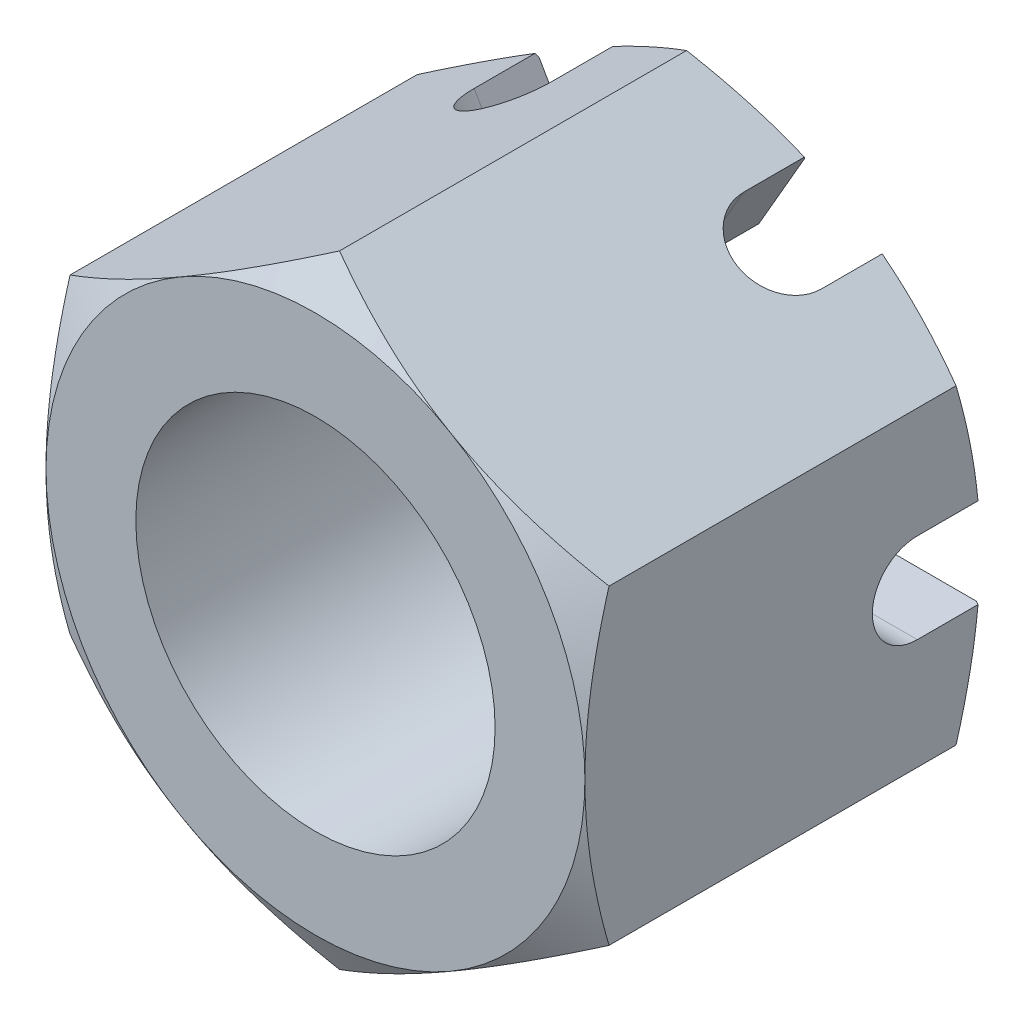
ISO-10303-21;
HEADER;
FILE_DESCRIPTION(('STEP AP214'),'2;1');
FILE_NAME('part.step','',(''),(''),'','','');
FILE_SCHEMA(('AUTOMOTIVE_DESIGN { 1 0 10303 214 1 1 1 1 }'));
ENDSEC;
DATA;
#1=APPLICATION_CONTEXT('core data for automotive mechanical design processes');
#2=APPLICATION_PROTOCOL_DEFINITION('international standard','automotive_design',2000,#1);
#3=PRODUCT_CONTEXT('',#1,'mechanical');
#4=PRODUCT('Part','Part','',(#3));
#5=PRODUCT_RELATED_PRODUCT_CATEGORY('part','',(#4));
#6=PRODUCT_DEFINITION_FORMATION('','',#4);
#7=PRODUCT_DEFINITION_CONTEXT('part definition',#1,'design');
#8=PRODUCT_DEFINITION('design','',#6,#7);
#9=PRODUCT_DEFINITION_SHAPE('','',#8);
#10=(LENGTH_UNIT() NAMED_UNIT(*) SI_UNIT(.MILLI.,.METRE.));
#11=(NAMED_UNIT(*) PLANE_ANGLE_UNIT() SI_UNIT($,.RADIAN.));
#12=(NAMED_UNIT(*) SI_UNIT($,.STERADIAN.) SOLID_ANGLE_UNIT());
#13=UNCERTAINTY_MEASURE_WITH_UNIT(LENGTH_MEASURE(1.E-05),#10,'distance_accuracy_value','');
#14=(GEOMETRIC_REPRESENTATION_CONTEXT(3) GLOBAL_UNCERTAINTY_ASSIGNED_CONTEXT((#13)) GLOBAL_UNIT_ASSIGNED_CONTEXT((#10,
#11,#12)) REPRESENTATION_CONTEXT('',''));
#15=CARTESIAN_POINT('',(0.,0.,0.));
#16=DIRECTION('',(0.,0.,1.));
#17=DIRECTION('',(1.,0.,0.));
#18=AXIS2_PLACEMENT_3D('',#15,#16,#17);
#19=CARTESIAN_POINT('',(-15.,25.9807621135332,-22.));
#20=DIRECTION('',(0.,0.,-1.));
#21=DIRECTION('',(-1.,0.,0.));
#22=AXIS2_PLACEMENT_3D('',#19,#20,#21);
#23=PLANE('',#22);
#24=DIRECTION('',(-0.500000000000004,0.866025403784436,0.));
#25=VECTOR('',#24,1.);
#26=CARTESIAN_POINT('',(13.4150635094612,-18.2355715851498,-22.));
#27=LINE('',#26,#25);
#28=CARTESIAN_POINT('',(9.56016323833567,-11.5586884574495,-22.));
#29=VERTEX_POINT('',#28);
#30=CARTESIAN_POINT('',(7.0062926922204,-7.13525491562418,-22.));
#31=VERTEX_POINT('',#30);
#32=EDGE_CURVE('E328',#29,#31,#27,.T.);
#33=ORIENTED_EDGE('',*,*,#32,.T.);
#34=CARTESIAN_POINT('',(0.,0.,-22.));
#35=DIRECTION('',(0.,0.,1.));
#36=DIRECTION('',(1.,0.,0.));
#37=AXIS2_PLACEMENT_3D('',#34,#35,#36);
#38=CIRCLE('',#37,10.);
#39=CARTESIAN_POINT('',(9.68245836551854,-2.5,-22.));
#40=VERTEX_POINT('',#39);
#41=EDGE_CURVE('E575',#31,#40,#38,.T.);
#42=ORIENTED_EDGE('',*,*,#41,.T.);
#43=DIRECTION('',(1.,0.,0.));
#44=VECTOR('',#43,1.);
#45=CARTESIAN_POINT('',(-15.,-2.5,-22.));
#46=LINE('',#45,#44);
#47=CARTESIAN_POINT('',(14.790199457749,-2.5,-22.));
#48=VERTEX_POINT('',#47);
#49=EDGE_CURVE('E429',#40,#48,#46,.T.);
#50=ORIENTED_EDGE('',*,*,#49,.T.);
#51=CARTESIAN_POINT('',(0.,0.,-22.));
#52=DIRECTION('',(0.,0.,-1.));
#53=DIRECTION('',(-1.,0.,0.));
#54=AXIS2_PLACEMENT_3D('',#51,#52,#53);
#55=CIRCLE('',#54,15.);
#56=EDGE_CURVE('E545',#29,#48,#55,.F.);
#57=ORIENTED_EDGE('',*,*,#56,.F.);
#58=EDGE_LOOP('',(#33,#42,#50,#57));
#59=FACE_BOUND('',#58,.T.);
#60=ADVANCED_FACE('F31',(#59),#23,.T.);
#61=DIRECTION('',(-0.500000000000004,0.866025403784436,0.));
#62=VECTOR('',#61,1.);
#63=CARTESIAN_POINT('',(9.08493649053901,-20.7355715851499,-22.));
#64=LINE('',#63,#62);
#65=CARTESIAN_POINT('',(5.23003621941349,-14.0586884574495,-22.));
#66=VERTEX_POINT('',#65);
#67=CARTESIAN_POINT('',(2.67616567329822,-9.6352549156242,-22.));
#68=VERTEX_POINT('',#67);
#69=EDGE_CURVE('E334',#66,#68,#64,.T.);
#70=ORIENTED_EDGE('',*,*,#69,.F.);
#71=CARTESIAN_POINT('',(-5.23003621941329,-14.0586884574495,-22.));
#72=VERTEX_POINT('',#71);
#73=EDGE_CURVE('E543',#72,#66,#55,.F.);
#74=ORIENTED_EDGE('',*,*,#73,.F.);
#75=DIRECTION('',(-0.499999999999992,-0.866025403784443,0.));
#76=VECTOR('',#75,1.);
#77=CARTESIAN_POINT('',(13.4150635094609,18.23557158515,-22.));
#78=LINE('',#77,#76);
#79=CARTESIAN_POINT('',(-2.67616567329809,-9.63525491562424,-22.));
#80=VERTEX_POINT('',#79);
#81=EDGE_CURVE('E307',#80,#72,#78,.T.);
#82=ORIENTED_EDGE('',*,*,#81,.F.);
#83=EDGE_CURVE('E576',#80,#68,#38,.T.);
#84=ORIENTED_EDGE('',*,*,#83,.T.);
#85=EDGE_LOOP('',(#70,#74,#82,#84));
#86=FACE_BOUND('',#85,.T.);
#87=ADVANCED_FACE('F816',(#86),#23,.T.);
#88=CARTESIAN_POINT('',(-2.67616567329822,9.6352549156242,-22.));
#89=VERTEX_POINT('',#88);
#90=CARTESIAN_POINT('',(-5.23003621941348,14.0586884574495,-22.));
#91=VERTEX_POINT('',#90);
#92=EDGE_CURVE('E325',#89,#91,#27,.T.);
#93=ORIENTED_EDGE('',*,*,#92,.T.);
#94=CARTESIAN_POINT('',(5.23003621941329,14.0586884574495,-22.));
#95=VERTEX_POINT('',#94);
#96=EDGE_CURVE('E531',#95,#91,#55,.F.);
#97=ORIENTED_EDGE('',*,*,#96,.F.);
#98=DIRECTION('',(-0.499999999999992,-0.866025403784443,0.));
#99=VECTOR('',#98,1.);
#100=CARTESIAN_POINT('',(9.0849364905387,20.7355715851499,-22.));
#101=LINE('',#100,#99);
#102=CARTESIAN_POINT('',(2.67616567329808,9.63525491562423,-22.));
#103=VERTEX_POINT('',#102);
#104=EDGE_CURVE('E313',#95,#103,#101,.T.);
#105=ORIENTED_EDGE('',*,*,#104,.T.);
#106=EDGE_CURVE('E532',#103,#89,#38,.T.);
#107=ORIENTED_EDGE('',*,*,#106,.T.);
#108=EDGE_LOOP('',(#93,#97,#105,#107));
#109=FACE_BOUND('',#108,.T.);
#110=ADVANCED_FACE('F529',(#109),#23,.T.);
#111=CARTESIAN_POINT('',(-7.0062926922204,7.13525491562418,-22.));
#112=VERTEX_POINT('',#111);
#113=CARTESIAN_POINT('',(-9.56016323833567,11.5586884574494,-22.));
#114=VERTEX_POINT('',#113);
#115=EDGE_CURVE('E324',#112,#114,#64,.T.);
#116=ORIENTED_EDGE('',*,*,#115,.F.);
#117=CARTESIAN_POINT('',(-9.68245836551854,2.5,-22.));
#118=VERTEX_POINT('',#117);
#119=EDGE_CURVE('E584',#112,#118,#38,.T.);
#120=ORIENTED_EDGE('',*,*,#119,.T.);
#121=DIRECTION('',(1.,0.,0.));
#122=VECTOR('',#121,1.);
#123=CARTESIAN_POINT('',(-15.,2.5,-22.));
#124=LINE('',#123,#122);
#125=CARTESIAN_POINT('',(-14.790199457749,2.5,-22.));
#126=VERTEX_POINT('',#125);
#127=EDGE_CURVE('E442',#126,#118,#124,.T.);
#128=ORIENTED_EDGE('',*,*,#127,.F.);
#129=CARTESIAN_POINT('',(0.,0.,-22.));
#130=DIRECTION('',(0.,0.,-1.));
#131=DIRECTION('',(-1.,0.,0.));
#132=AXIS2_PLACEMENT_3D('',#129,#130,#131);
#133=CIRCLE('',#132,15.);
#134=EDGE_CURVE('E586',#126,#114,#133,.T.);
#135=ORIENTED_EDGE('',*,*,#134,.T.);
#136=EDGE_LOOP('',(#116,#120,#128,#135));
#137=FACE_BOUND('',#136,.T.);
#138=ADVANCED_FACE('F639',(#137),#23,.T.);
#139=CARTESIAN_POINT('',(-7.0062926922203,-7.13525491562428,-22.));
#140=VERTEX_POINT('',#139);
#141=CARTESIAN_POINT('',(-9.56016323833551,-11.5586884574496,-22.));
#142=VERTEX_POINT('',#141);
#143=EDGE_CURVE('E310',#140,#142,#101,.T.);
#144=ORIENTED_EDGE('',*,*,#143,.T.);
#145=CARTESIAN_POINT('',(-14.790199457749,-2.5,-22.));
#146=VERTEX_POINT('',#145);
#147=EDGE_CURVE('E542',#146,#142,#55,.F.);
#148=ORIENTED_EDGE('',*,*,#147,.F.);
#149=CARTESIAN_POINT('',(-9.68245836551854,-2.5,-22.));
#150=VERTEX_POINT('',#149);
#151=EDGE_CURVE('E432',#146,#150,#46,.T.);
#152=ORIENTED_EDGE('',*,*,#151,.T.);
#153=EDGE_CURVE('E579',#150,#140,#38,.T.);
#154=ORIENTED_EDGE('',*,*,#153,.T.);
#155=EDGE_LOOP('',(#144,#148,#152,#154));
#156=FACE_BOUND('',#155,.T.);
#157=ADVANCED_FACE('F595',(#156),#23,.T.);
#158=CARTESIAN_POINT('',(-15.,25.9807621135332,0.));
#159=DIRECTION('',(0.,0.,-1.));
#160=DIRECTION('',(-1.,0.,0.));
#161=AXIS2_PLACEMENT_3D('',#158,#159,#160);
#162=PLANE('',#161);
#163=CARTESIAN_POINT('',(0.,0.,0.));
#164=DIRECTION('',(0.,0.,1.));
#165=DIRECTION('',(1.,0.,0.));
#166=AXIS2_PLACEMENT_3D('',#163,#164,#165);
#167=CIRCLE('',#166,10.);
#168=CARTESIAN_POINT('',(10.,0.,0.));
#169=VERTEX_POINT('',#168);
#170=EDGE_CURVE('E571',#169,#169,#167,.T.);
#171=ORIENTED_EDGE('',*,*,#170,.F.);
#172=EDGE_LOOP('',(#171));
#173=FACE_BOUND('',#172,.T.);
#174=CARTESIAN_POINT('',(0.,0.,0.));
#175=DIRECTION('',(0.,0.,-1.));
#176=DIRECTION('',(-1.,0.,0.));
#177=AXIS2_PLACEMENT_3D('',#174,#175,#176);
#178=CIRCLE('',#177,15.);
#179=CARTESIAN_POINT('',(-15.,0.,0.));
#180=VERTEX_POINT('',#179);
#181=CARTESIAN_POINT('',(-7.5,12.9903810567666,0.));
#182=VERTEX_POINT('',#181);
#183=EDGE_CURVE('E643',#180,#182,#178,.T.);
#184=ORIENTED_EDGE('',*,*,#183,.F.);
#185=CARTESIAN_POINT('',(0.,0.,0.));
#186=DIRECTION('',(0.,0.,-1.));
#187=DIRECTION('',(-1.,0.,0.));
#188=AXIS2_PLACEMENT_3D('',#185,#186,#187);
#189=CIRCLE('',#188,15.);
#190=CARTESIAN_POINT('',(-7.49999999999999,-12.9903810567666,0.));
#191=VERTEX_POINT('',#190);
#192=EDGE_CURVE('E540',#180,#191,#189,.F.);
#193=ORIENTED_EDGE('',*,*,#192,.T.);
#194=CARTESIAN_POINT('',(7.49999999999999,-12.9903810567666,0.));
#195=VERTEX_POINT('',#194);
#196=EDGE_CURVE('E547',#191,#195,#189,.F.);
#197=ORIENTED_EDGE('',*,*,#196,.T.);
#198=CARTESIAN_POINT('',(15.,0.,0.));
#199=VERTEX_POINT('',#198);
#200=EDGE_CURVE('E786',#195,#199,#189,.F.);
#201=ORIENTED_EDGE('',*,*,#200,.T.);
#202=CARTESIAN_POINT('',(7.49999999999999,12.9903810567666,0.));
#203=VERTEX_POINT('',#202);
#204=EDGE_CURVE('E778',#199,#203,#189,.F.);
#205=ORIENTED_EDGE('',*,*,#204,.T.);
#206=EDGE_CURVE('E549',#203,#182,#189,.F.);
#207=ORIENTED_EDGE('',*,*,#206,.T.);
#208=EDGE_LOOP('',(#184,#193,#197,#201,#205,#207));
#209=FACE_BOUND('',#208,.T.);
#210=ADVANCED_FACE('F783',(#173,#209),#162,.F.);
#211=CARTESIAN_POINT('',(0.,0.,0.));
#212=DIRECTION('',(0.,0.,-1.));
#213=DIRECTION('',(-1.,0.,0.));
#214=AXIS2_PLACEMENT_3D('',#211,#212,#213);
#215=CONICAL_SURFACE('',#214,15.,1.0471975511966);
#216=CARTESIAN_POINT('',(-15.,-23.5503373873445,-7.46031657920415));
#217=CARTESIAN_POINT('',(-15.,-23.2214975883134,-7.30018703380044));
#218=CARTESIAN_POINT('',(-15.,-22.8922795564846,-7.14083458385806));
#219=CARTESIAN_POINT('',(-15.,-22.2330081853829,-6.82385934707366));
#220=CARTESIAN_POINT('',(-15.,-21.902954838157,-6.66623657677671));
#221=CARTESIAN_POINT('',(-15.,-20.9113394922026,-6.196186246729));
#222=CARTESIAN_POINT('',(-15.,-20.2484151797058,-5.88662207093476));
#223=CARTESIAN_POINT('',(-15.,-18.9147538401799,-5.27534284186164));
#224=CARTESIAN_POINT('',(-15.,-18.2439940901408,-4.9736772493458));
#225=CARTESIAN_POINT('',(-15.,-16.8972391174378,-4.38231039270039));
#226=CARTESIAN_POINT('',(-15.,-16.2212441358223,-4.09260858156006));
#227=CARTESIAN_POINT('',(-15.,-14.8402211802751,-3.51888664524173));
#228=CARTESIAN_POINT('',(-15.,-14.1349784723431,-3.23538079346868));
#229=CARTESIAN_POINT('',(-15.,-12.7163448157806,-2.68913613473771));
#230=CARTESIAN_POINT('',(-15.,-12.0029529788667,-2.42639961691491));
#231=CARTESIAN_POINT('',(-15.,-10.5681524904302,-1.92838393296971));
#232=CARTESIAN_POINT('',(-15.,-9.84676242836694,-1.69305162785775));
#233=CARTESIAN_POINT('',(-15.,-8.39357189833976,-1.2571893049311));
#234=CARTESIAN_POINT('',(-15.,-7.66177469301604,-1.05664862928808));
#235=CARTESIAN_POINT('',(-15.,-6.55811596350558,-0.789583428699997));
#236=CARTESIAN_POINT('',(-15.,-6.19026989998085,-0.706371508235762));
#237=CARTESIAN_POINT('',(-15.,-5.4520124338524,-0.552165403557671));
#238=CARTESIAN_POINT('',(-15.,-5.08160108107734,-0.48117098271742));
#239=CARTESIAN_POINT('',(-15.,-4.33844818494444,-0.352634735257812));
#240=CARTESIAN_POINT('',(-15.,-3.96570669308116,-0.295092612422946));
#241=CARTESIAN_POINT('',(-15.,-3.21826543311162,-0.19459728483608));
#242=CARTESIAN_POINT('',(-15.,-2.84356575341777,-0.151643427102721));
#243=CARTESIAN_POINT('',(-15.,-2.09774881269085,-0.0817328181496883));
#244=CARTESIAN_POINT('',(-15.,-1.72665110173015,-0.0545687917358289));
#245=CARTESIAN_POINT('',(-15.,-0.983639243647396,-0.0159713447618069));
#246=CARTESIAN_POINT('',(-15.,-0.611725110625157,-0.00453765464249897));
#247=CARTESIAN_POINT('',(-15.,0.13225703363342,0.002325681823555));
#248=CARTESIAN_POINT('',(-15.,0.504325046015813,-0.00224479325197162));
#249=CARTESIAN_POINT('',(-15.,1.24792971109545,-0.027274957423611));
#250=CARTESIAN_POINT('',(-15.,1.61946633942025,-0.0477353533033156));
#251=CARTESIAN_POINT('',(-15.,2.50364539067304,-0.114894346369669));
#252=CARTESIAN_POINT('',(-15.,3.01576421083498,-0.168645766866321));
#253=CARTESIAN_POINT('',(-15.,4.03636494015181,-0.30347127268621));
#254=CARTESIAN_POINT('',(-15.,4.54484637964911,-0.384548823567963));
#255=CARTESIAN_POINT('',(-15.,6.06414668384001,-0.664484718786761));
#256=CARTESIAN_POINT('',(-15.,7.06830961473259,-0.900002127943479));
#257=CARTESIAN_POINT('',(-15.,8.57051683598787,-1.31058348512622));
#258=CARTESIAN_POINT('',(-15.,9.07628892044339,-1.45901780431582));
#259=CARTESIAN_POINT('',(-15.,10.0829252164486,-1.77183649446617));
#260=CARTESIAN_POINT('',(-15.,10.5837893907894,-1.93622098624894));
#261=CARTESIAN_POINT('',(-15.,11.5807606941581,-2.27826014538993));
#262=CARTESIAN_POINT('',(-15.,12.0768691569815,-2.45591096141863));
#263=CARTESIAN_POINT('',(-15.,13.0649405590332,-2.8223316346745));
#264=CARTESIAN_POINT('',(-15.,13.5569035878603,-3.01110125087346));
#265=CARTESIAN_POINT('',(-15.,14.45628828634,-3.36603766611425));
#266=CARTESIAN_POINT('',(-15.,14.8642682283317,-3.53079602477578));
#267=CARTESIAN_POINT('',(-15.,15.6779171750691,-3.86593070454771));
#268=CARTESIAN_POINT('',(-15.,16.0835861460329,-4.03630710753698));
#269=CARTESIAN_POINT('',(-15.,17.2975490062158,-4.55473444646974));
#270=CARTESIAN_POINT('',(-15.,18.1027382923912,-4.91005935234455));
#271=CARTESIAN_POINT('',(-15.,19.7067308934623,-5.63551685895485));
#272=CARTESIAN_POINT('',(-15.,20.5055317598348,-6.00565483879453));
#273=CARTESIAN_POINT('',(-15.,22.0977330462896,-6.75726647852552));
#274=CARTESIAN_POINT('',(-15.,22.8911336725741,-7.13873970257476));
#275=CARTESIAN_POINT('',(-15.,24.4748157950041,-7.91117683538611));
#276=CARTESIAN_POINT('',(-15.,25.2650905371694,-8.30215455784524));
#277=CARTESIAN_POINT('',(-15.,26.8420909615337,-9.09120761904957));
#278=CARTESIAN_POINT('',(-15.,27.6288166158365,-9.48928301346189));
#279=CARTESIAN_POINT('',(-15.,29.1991817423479,-10.291068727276));
#280=CARTESIAN_POINT('',(-15.,29.9828218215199,-10.694777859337));
#281=CARTESIAN_POINT('',(-15.,31.547672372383,-11.5068669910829));
#282=CARTESIAN_POINT('',(-15.,32.3288828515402,-11.9152469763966));
#283=CARTESIAN_POINT('',(-15.,34.5076192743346,-13.0610207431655));
#284=CARTESIAN_POINT('',(-15.,35.9029110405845,-13.8026620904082));
#285=CARTESIAN_POINT('',(-15.,38.6887763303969,-15.2949291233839));
#286=CARTESIAN_POINT('',(-15.,40.079349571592,-16.0455553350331));
#287=CARTESIAN_POINT('',(-15.,42.8523146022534,-17.5510618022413));
#288=CARTESIAN_POINT('',(-15.,44.2347182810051,-18.3059201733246));
#289=CARTESIAN_POINT('',(-15.,46.3061599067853,-19.4420247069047));
#290=CARTESIAN_POINT('',(-15.,46.9962538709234,-19.8213480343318));
#291=CARTESIAN_POINT('',(-15.,48.3758127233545,-20.5811349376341));
#292=CARTESIAN_POINT('',(-15.,49.065277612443,-20.9615985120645));
#293=CARTESIAN_POINT('',(-15.,49.7544662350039,-21.3425619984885));
#294=B_SPLINE_CURVE_WITH_KNOTS('',3,(#216,#217,#218,#219,#220,#221,#222,#223,#224,#225,#226,
#227,#228,#229,#230,#231,#232,#233,#234,#235,#236,#237,#238,#239,#240,#241,#242,#243,#244,#245,
#246,#247,#248,#249,#250,#251,#252,#253,#254,#255,#256,#257,#258,#259,#260,#261,#262,#263,#264,
#265,#266,#267,#268,#269,#270,#271,#272,#273,#274,#275,#276,#277,#278,#279,#280,#281,#282,#283,
#284,#285,#286,#287,#288,#289,#290,#291,#292,#293),.UNSPECIFIED.,.F.,.F.,(4,2,2,2,2,2,2,2,2,2,2,
2,2,2,2,2,2,2,2,2,2,2,2,2,2,2,2,2,2,2,2,2,2,2,2,2,2,2,4),(0.,1.09726459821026,2.19453968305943,
4.38940028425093,6.59572859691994,8.80195591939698,11.0819879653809,13.3622709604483,
15.6380559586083,17.9131425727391,19.0443940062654,20.1756235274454,21.3068281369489,
22.4379821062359,23.5539308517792,24.6698604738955,25.7857985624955,26.9017862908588,
28.4457161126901,29.9898418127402,33.0796277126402,34.6607984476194,36.2419811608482,
37.8227066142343,39.4033978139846,40.7233286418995,42.0432787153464,44.6833743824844,
47.3244376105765,49.9653994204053,52.6104609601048,55.2555432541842,57.9000762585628,
60.5446011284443,65.2849972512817,70.0256722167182,74.750872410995,77.1132947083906,
79.4757140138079),.UNSPECIFIED.);
#295=CARTESIAN_POINT('',(-15.,8.66025403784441,-1.3397459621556));
#296=VERTEX_POINT('',#295);
#297=EDGE_CURVE('E653',#296,#180,#294,.F.);
#298=ORIENTED_EDGE('',*,*,#297,.T.);
#299=ORIENTED_EDGE('',*,*,#183,.T.);
#300=CARTESIAN_POINT('',(0.000199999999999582,17.3206235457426,-1.33981262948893));
#301=CARTESIAN_POINT('',(-0.329494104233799,17.130274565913,-1.22992178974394));
#302=CARTESIAN_POINT('',(-0.660474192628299,16.939183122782,-1.12501758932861));
#303=CARTESIAN_POINT('',(-1.32508844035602,16.5554679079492,-0.926568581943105));
#304=CARTESIAN_POINT('',(-1.6587234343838,16.3628436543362,-0.833027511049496));
#305=CARTESIAN_POINT('',(-2.32929228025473,15.9756905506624,-0.658562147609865));
#306=CARTESIAN_POINT('',(-2.66623200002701,15.7811583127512,-0.577667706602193));
#307=CARTESIAN_POINT('',(-3.34245276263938,15.3907420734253,-0.430232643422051));
#308=CARTESIAN_POINT('',(-3.68173367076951,15.1948581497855,-0.363691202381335));
#309=CARTESIAN_POINT('',(-4.35394314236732,14.8067578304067,-0.247792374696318));
#310=CARTESIAN_POINT('',(-4.68682180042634,14.6145702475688,-0.198051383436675));
#311=CARTESIAN_POINT('',(-5.3541044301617,14.2293144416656,-0.114646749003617));
#312=CARTESIAN_POINT('',(-5.6885084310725,14.0362462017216,-0.0809834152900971));
#313=CARTESIAN_POINT('',(-6.35787818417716,13.6497853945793,-0.0305840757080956));
#314=CARTESIAN_POINT('',(-6.69284279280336,13.4563934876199,-0.0138279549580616));
#315=CARTESIAN_POINT('',(-7.36308121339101,13.0694311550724,0.00239660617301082));
#316=CARTESIAN_POINT('',(-7.69835501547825,12.8758607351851,0.00186558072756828));
#317=CARTESIAN_POINT('',(-8.32514688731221,12.5139822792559,-0.0152766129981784));
#318=CARTESIAN_POINT('',(-8.61670962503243,12.3456484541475,-0.0297968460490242));
#319=CARTESIAN_POINT('',(-9.19916443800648,12.0093680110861,-0.0716371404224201));
#320=CARTESIAN_POINT('',(-9.49005646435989,11.8414214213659,-0.0989581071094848));
#321=CARTESIAN_POINT('',(-10.0710118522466,11.5060066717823,-0.165923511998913));
#322=CARTESIAN_POINT('',(-10.3610743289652,11.338539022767,-0.20557812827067));
#323=CARTESIAN_POINT('',(-10.939839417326,11.0043888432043,-0.296515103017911));
#324=CARTESIAN_POINT('',(-11.2285419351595,10.8377063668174,-0.347798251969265));
#325=CARTESIAN_POINT('',(-12.1049144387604,10.3317324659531,-0.520386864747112));
#326=CARTESIAN_POINT('',(-12.6900465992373,9.99390625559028,-0.658901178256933));
#327=CARTESIAN_POINT('',(-13.8515859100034,9.32329122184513,-0.973271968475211));
#328=CARTESIAN_POINT('',(-14.4280079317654,8.99049381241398,-1.14905461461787));
#329=CARTESIAN_POINT('',(-15.0002,8.66013856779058,-1.33981262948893));
#330=B_SPLINE_CURVE_WITH_KNOTS('',3,(#300,#301,#302,#303,#304,#305,#306,#307,#308,#309,#310,
#311,#312,#313,#314,#315,#316,#317,#318,#319,#320,#321,#322,#323,#324,#325,#326,#327,#328,#329),
.UNSPECIFIED.,.F.,.F.,(4,2,2,2,2,2,2,2,2,2,2,2,2,2,4),(0.,1.18875411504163,2.37789802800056,
3.56980778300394,4.76164951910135,5.92407379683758,7.08652044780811,8.24758247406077,
9.40860862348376,10.4193068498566,11.4300765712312,12.4416826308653,13.4533574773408,
15.5211962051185,17.584976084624),.UNSPECIFIED.);
#331=EDGE_CURVE('E645',#182,#296,#330,.T.);
#332=ORIENTED_EDGE('',*,*,#331,.T.);
#333=EDGE_LOOP('',(#298,#299,#332));
#334=FACE_BOUND('',#333,.T.);
#335=ADVANCED_FACE('F471',(#334),#215,.T.);
#336=CARTESIAN_POINT('',(15.0002,8.66013856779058,-1.33981262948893));
#337=CARTESIAN_POINT('',(14.6705058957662,8.85048754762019,-1.22992178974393));
#338=CARTESIAN_POINT('',(14.3395258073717,9.04157899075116,-1.12501758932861));
#339=CARTESIAN_POINT('',(13.674911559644,9.42529420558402,-0.926568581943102));
#340=CARTESIAN_POINT('',(13.3412765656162,9.61791845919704,-0.833027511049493));
#341=CARTESIAN_POINT('',(12.6707077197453,10.0050715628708,-0.658562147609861));
#342=CARTESIAN_POINT('',(12.333767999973,10.199603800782,-0.57766770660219));
#343=CARTESIAN_POINT('',(11.6575472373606,10.5900200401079,-0.430232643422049));
#344=CARTESIAN_POINT('',(11.3182663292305,10.7859039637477,-0.363691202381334));
#345=CARTESIAN_POINT('',(10.6460568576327,11.1740042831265,-0.247792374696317));
#346=CARTESIAN_POINT('',(10.3131781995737,11.3661918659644,-0.198051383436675));
#347=CARTESIAN_POINT('',(9.6458955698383,11.7514476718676,-0.114646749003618));
#348=CARTESIAN_POINT('',(9.3114915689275,11.9445159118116,-0.0809834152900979));
#349=CARTESIAN_POINT('',(8.64212181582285,12.3309767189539,-0.0305840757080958));
#350=CARTESIAN_POINT('',(8.30715720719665,12.5243686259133,-0.0138279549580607));
#351=CARTESIAN_POINT('',(7.63691878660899,12.9113309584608,0.00239660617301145));
#352=CARTESIAN_POINT('',(7.30164498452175,13.1049013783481,0.00186558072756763));
#353=CARTESIAN_POINT('',(6.67485311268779,13.4667798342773,-0.0152766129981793));
#354=CARTESIAN_POINT('',(6.38329037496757,13.6351136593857,-0.0297968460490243));
#355=CARTESIAN_POINT('',(5.80083556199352,13.9713941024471,-0.0716371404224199));
#356=CARTESIAN_POINT('',(5.50994353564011,14.1393406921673,-0.0989581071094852));
#357=CARTESIAN_POINT('',(4.92898814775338,14.4747554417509,-0.165923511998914));
#358=CARTESIAN_POINT('',(4.63892567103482,14.6422230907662,-0.205578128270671));
#359=CARTESIAN_POINT('',(4.06016058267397,14.9763732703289,-0.296515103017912));
#360=CARTESIAN_POINT('',(3.77145806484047,15.1430557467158,-0.347798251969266));
#361=CARTESIAN_POINT('',(2.89508556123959,15.6490296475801,-0.520386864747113));
#362=CARTESIAN_POINT('',(2.30995340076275,15.9868558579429,-0.658901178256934));
#363=CARTESIAN_POINT('',(1.14841408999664,16.6574708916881,-0.973271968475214));
#364=CARTESIAN_POINT('',(0.571992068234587,16.9902683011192,-1.14905461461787));
#365=CARTESIAN_POINT('',(-0.000199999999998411,17.3206235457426,-1.33981262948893));
#366=B_SPLINE_CURVE_WITH_KNOTS('',3,(#336,#337,#338,#339,#340,#341,#342,#343,#344,#345,#346,
#347,#348,#349,#350,#351,#352,#353,#354,#355,#356,#357,#358,#359,#360,#361,#362,#363,#364,#365),
.UNSPECIFIED.,.F.,.F.,(4,2,2,2,2,2,2,2,2,2,2,2,2,2,4),(0.,1.18875411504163,2.37789802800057,
3.56980778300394,4.76164951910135,5.92407379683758,7.08652044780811,8.24758247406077,
9.40860862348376,10.4193068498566,11.4300765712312,12.4416826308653,13.4533574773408,
15.5211962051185,17.584976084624),.UNSPECIFIED.);
#367=CARTESIAN_POINT('',(0.,17.3205080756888,-1.3397459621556));
#368=VERTEX_POINT('',#367);
#369=EDGE_CURVE('E713',#203,#368,#366,.T.);
#370=ORIENTED_EDGE('',*,*,#369,.T.);
#371=EDGE_CURVE('E652',#368,#182,#330,.T.);
#372=ORIENTED_EDGE('',*,*,#371,.T.);
#373=ORIENTED_EDGE('',*,*,#206,.F.);
#374=EDGE_LOOP('',(#370,#372,#373));
#375=FACE_BOUND('',#374,.T.);
#376=ADVANCED_FACE('F781',(#375),#215,.T.);
#377=CARTESIAN_POINT('',(15.,-23.5503373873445,-7.46031657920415));
#378=CARTESIAN_POINT('',(15.,-23.2214975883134,-7.30018703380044));
#379=CARTESIAN_POINT('',(15.,-22.8922795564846,-7.14083458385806));
#380=CARTESIAN_POINT('',(15.,-22.2330081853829,-6.82385934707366));
#381=CARTESIAN_POINT('',(15.,-21.902954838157,-6.66623657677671));
#382=CARTESIAN_POINT('',(15.,-20.9113394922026,-6.196186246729));
#383=CARTESIAN_POINT('',(15.,-20.2484151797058,-5.88662207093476));
#384=CARTESIAN_POINT('',(15.,-18.9147538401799,-5.27534284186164));
#385=CARTESIAN_POINT('',(15.,-18.2439940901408,-4.9736772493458));
#386=CARTESIAN_POINT('',(15.,-16.8972391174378,-4.38231039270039));
#387=CARTESIAN_POINT('',(15.,-16.2212441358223,-4.09260858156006));
#388=CARTESIAN_POINT('',(15.,-14.8402211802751,-3.51888664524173));
#389=CARTESIAN_POINT('',(15.,-14.1349784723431,-3.23538079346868));
#390=CARTESIAN_POINT('',(15.,-12.7163448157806,-2.68913613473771));
#391=CARTESIAN_POINT('',(15.,-12.0029529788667,-2.42639961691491));
#392=CARTESIAN_POINT('',(15.,-10.5681524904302,-1.92838393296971));
#393=CARTESIAN_POINT('',(15.,-9.84676242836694,-1.69305162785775));
#394=CARTESIAN_POINT('',(15.,-8.39357189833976,-1.2571893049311));
#395=CARTESIAN_POINT('',(15.,-7.66177469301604,-1.05664862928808));
#396=CARTESIAN_POINT('',(15.,-6.55811596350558,-0.789583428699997));
#397=CARTESIAN_POINT('',(15.,-6.19026989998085,-0.706371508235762));
#398=CARTESIAN_POINT('',(15.,-5.4520124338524,-0.552165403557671));
#399=CARTESIAN_POINT('',(15.,-5.08160108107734,-0.48117098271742));
#400=CARTESIAN_POINT('',(15.,-4.33844818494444,-0.352634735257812));
#401=CARTESIAN_POINT('',(15.,-3.96570669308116,-0.295092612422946));
#402=CARTESIAN_POINT('',(15.,-3.21826543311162,-0.19459728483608));
#403=CARTESIAN_POINT('',(15.,-2.84356575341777,-0.151643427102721));
#404=CARTESIAN_POINT('',(15.,-2.09774881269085,-0.0817328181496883));
#405=CARTESIAN_POINT('',(15.,-1.72665110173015,-0.0545687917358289));
#406=CARTESIAN_POINT('',(15.,-0.983639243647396,-0.0159713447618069));
#407=CARTESIAN_POINT('',(15.,-0.611725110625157,-0.00453765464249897));
#408=CARTESIAN_POINT('',(15.,0.13225703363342,0.002325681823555));
#409=CARTESIAN_POINT('',(15.,0.504325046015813,-0.00224479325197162));
#410=CARTESIAN_POINT('',(15.,1.24792971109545,-0.027274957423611));
#411=CARTESIAN_POINT('',(15.,1.61946633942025,-0.0477353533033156));
#412=CARTESIAN_POINT('',(15.,2.50364539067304,-0.114894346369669));
#413=CARTESIAN_POINT('',(15.,3.01576421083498,-0.168645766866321));
#414=CARTESIAN_POINT('',(15.,4.03636494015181,-0.30347127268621));
#415=CARTESIAN_POINT('',(15.,4.54484637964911,-0.384548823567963));
#416=CARTESIAN_POINT('',(15.,6.06414668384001,-0.664484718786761));
#417=CARTESIAN_POINT('',(15.,7.06830961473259,-0.900002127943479));
#418=CARTESIAN_POINT('',(15.,8.57051683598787,-1.31058348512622));
#419=CARTESIAN_POINT('',(15.,9.07628892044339,-1.45901780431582));
#420=CARTESIAN_POINT('',(15.,10.0829252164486,-1.77183649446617));
#421=CARTESIAN_POINT('',(15.,10.5837893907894,-1.93622098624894));
#422=CARTESIAN_POINT('',(15.,11.5807606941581,-2.27826014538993));
#423=CARTESIAN_POINT('',(15.,12.0768691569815,-2.45591096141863));
#424=CARTESIAN_POINT('',(15.,13.0649405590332,-2.8223316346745));
#425=CARTESIAN_POINT('',(15.,13.5569035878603,-3.01110125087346));
#426=CARTESIAN_POINT('',(15.,14.45628828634,-3.36603766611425));
#427=CARTESIAN_POINT('',(15.,14.8642682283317,-3.53079602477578));
#428=CARTESIAN_POINT('',(15.,15.6779171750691,-3.86593070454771));
#429=CARTESIAN_POINT('',(15.,16.0835861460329,-4.03630710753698));
#430=CARTESIAN_POINT('',(15.,17.2975490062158,-4.55473444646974));
#431=CARTESIAN_POINT('',(15.,18.1027382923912,-4.91005935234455));
#432=CARTESIAN_POINT('',(15.,19.7067308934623,-5.63551685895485));
#433=CARTESIAN_POINT('',(15.,20.5055317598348,-6.00565483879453));
#434=CARTESIAN_POINT('',(15.,22.0977330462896,-6.75726647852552));
#435=CARTESIAN_POINT('',(15.,22.8911336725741,-7.13873970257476));
#436=CARTESIAN_POINT('',(15.,24.4748157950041,-7.91117683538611));
#437=CARTESIAN_POINT('',(15.,25.2650905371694,-8.30215455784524));
#438=CARTESIAN_POINT('',(15.,26.8420909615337,-9.09120761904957));
#439=CARTESIAN_POINT('',(15.,27.6288166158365,-9.48928301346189));
#440=CARTESIAN_POINT('',(15.,29.1991817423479,-10.291068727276));
#441=CARTESIAN_POINT('',(15.,29.9828218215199,-10.694777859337));
#442=CARTESIAN_POINT('',(15.,31.547672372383,-11.5068669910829));
#443=CARTESIAN_POINT('',(15.,32.3288828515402,-11.9152469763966));
#444=CARTESIAN_POINT('',(15.,34.5076192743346,-13.0610207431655));
#445=CARTESIAN_POINT('',(15.,35.9029110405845,-13.8026620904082));
#446=CARTESIAN_POINT('',(15.,38.6887763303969,-15.2949291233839));
#447=CARTESIAN_POINT('',(15.,40.079349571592,-16.0455553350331));
#448=CARTESIAN_POINT('',(15.,42.8523146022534,-17.5510618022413));
#449=CARTESIAN_POINT('',(15.,44.2347182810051,-18.3059201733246));
#450=CARTESIAN_POINT('',(15.,46.3061599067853,-19.4420247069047));
#451=CARTESIAN_POINT('',(15.,46.9962538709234,-19.8213480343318));
#452=CARTESIAN_POINT('',(15.,48.3758127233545,-20.5811349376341));
#453=CARTESIAN_POINT('',(15.,49.065277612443,-20.9615985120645));
#454=CARTESIAN_POINT('',(15.,49.7544662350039,-21.3425619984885));
#455=B_SPLINE_CURVE_WITH_KNOTS('',3,(#377,#378,#379,#380,#381,#382,#383,#384,#385,#386,#387,
#388,#389,#390,#391,#392,#393,#394,#395,#396,#397,#398,#399,#400,#401,#402,#403,#404,#405,#406,
#407,#408,#409,#410,#411,#412,#413,#414,#415,#416,#417,#418,#419,#420,#421,#422,#423,#424,#425,
#426,#427,#428,#429,#430,#431,#432,#433,#434,#435,#436,#437,#438,#439,#440,#441,#442,#443,#444,
#445,#446,#447,#448,#449,#450,#451,#452,#453,#454),.UNSPECIFIED.,.F.,.F.,(4,2,2,2,2,2,2,2,2,2,2,
2,2,2,2,2,2,2,2,2,2,2,2,2,2,2,2,2,2,2,2,2,2,2,2,2,2,2,4),(0.,1.09726459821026,2.19453968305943,
4.38940028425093,6.59572859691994,8.80195591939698,11.0819879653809,13.3622709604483,
15.6380559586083,17.9131425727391,19.0443940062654,20.1756235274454,21.3068281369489,
22.4379821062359,23.5539308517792,24.6698604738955,25.7857985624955,26.9017862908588,
28.4457161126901,29.9898418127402,33.0796277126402,34.6607984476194,36.2419811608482,
37.8227066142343,39.4033978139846,40.7233286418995,42.0432787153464,44.6833743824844,
47.3244376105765,49.9653994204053,52.6104609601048,55.2555432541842,57.9000762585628,
60.5446011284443,65.2849972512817,70.0256722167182,74.750872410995,77.1132947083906,
79.4757140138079),.UNSPECIFIED.);
#456=CARTESIAN_POINT('',(15.,8.66025403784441,-1.3397459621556));
#457=VERTEX_POINT('',#456);
#458=EDGE_CURVE('E710',#199,#457,#455,.T.);
#459=ORIENTED_EDGE('',*,*,#458,.T.);
#460=EDGE_CURVE('E769',#457,#203,#366,.T.);
#461=ORIENTED_EDGE('',*,*,#460,.T.);
#462=ORIENTED_EDGE('',*,*,#204,.F.);
#463=EDGE_LOOP('',(#459,#461,#462));
#464=FACE_BOUND('',#463,.T.);
#465=ADVANCED_FACE('F776',(#464),#215,.T.);
#466=CARTESIAN_POINT('',(-0.000199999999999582,-17.3206235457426,-1.33981262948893));
#467=CARTESIAN_POINT('',(0.329494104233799,-17.130274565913,-1.22992178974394));
#468=CARTESIAN_POINT('',(0.660474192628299,-16.939183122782,-1.12501758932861));
#469=CARTESIAN_POINT('',(1.32508844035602,-16.5554679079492,-0.926568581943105));
#470=CARTESIAN_POINT('',(1.6587234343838,-16.3628436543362,-0.833027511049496));
#471=CARTESIAN_POINT('',(2.32929228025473,-15.9756905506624,-0.658562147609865));
#472=CARTESIAN_POINT('',(2.66623200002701,-15.7811583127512,-0.577667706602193));
#473=CARTESIAN_POINT('',(3.34245276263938,-15.3907420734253,-0.430232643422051));
#474=CARTESIAN_POINT('',(3.68173367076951,-15.1948581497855,-0.363691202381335));
#475=CARTESIAN_POINT('',(4.35394314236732,-14.8067578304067,-0.247792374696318));
#476=CARTESIAN_POINT('',(4.68682180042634,-14.6145702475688,-0.198051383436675));
#477=CARTESIAN_POINT('',(5.3541044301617,-14.2293144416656,-0.114646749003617));
#478=CARTESIAN_POINT('',(5.6885084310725,-14.0362462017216,-0.0809834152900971));
#479=CARTESIAN_POINT('',(6.35787818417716,-13.6497853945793,-0.0305840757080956));
#480=CARTESIAN_POINT('',(6.69284279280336,-13.4563934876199,-0.0138279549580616));
#481=CARTESIAN_POINT('',(7.36308121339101,-13.0694311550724,0.00239660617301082));
#482=CARTESIAN_POINT('',(7.69835501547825,-12.8758607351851,0.00186558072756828));
#483=CARTESIAN_POINT('',(8.32514688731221,-12.5139822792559,-0.0152766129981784));
#484=CARTESIAN_POINT('',(8.61670962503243,-12.3456484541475,-0.0297968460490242));
#485=CARTESIAN_POINT('',(9.19916443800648,-12.0093680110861,-0.0716371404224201));
#486=CARTESIAN_POINT('',(9.49005646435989,-11.8414214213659,-0.0989581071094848));
#487=CARTESIAN_POINT('',(10.0710118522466,-11.5060066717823,-0.165923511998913));
#488=CARTESIAN_POINT('',(10.3610743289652,-11.338539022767,-0.20557812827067));
#489=CARTESIAN_POINT('',(10.939839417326,-11.0043888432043,-0.296515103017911));
#490=CARTESIAN_POINT('',(11.2285419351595,-10.8377063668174,-0.347798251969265));
#491=CARTESIAN_POINT('',(12.1049144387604,-10.3317324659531,-0.520386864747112));
#492=CARTESIAN_POINT('',(12.6900465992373,-9.99390625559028,-0.658901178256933));
#493=CARTESIAN_POINT('',(13.8515859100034,-9.32329122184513,-0.973271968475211));
#494=CARTESIAN_POINT('',(14.4280079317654,-8.99049381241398,-1.14905461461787));
#495=CARTESIAN_POINT('',(15.0002,-8.66013856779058,-1.33981262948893));
#496=B_SPLINE_CURVE_WITH_KNOTS('',3,(#466,#467,#468,#469,#470,#471,#472,#473,#474,#475,#476,
#477,#478,#479,#480,#481,#482,#483,#484,#485,#486,#487,#488,#489,#490,#491,#492,#493,#494,#495),
.UNSPECIFIED.,.F.,.F.,(4,2,2,2,2,2,2,2,2,2,2,2,2,2,4),(0.,1.18875411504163,2.37789802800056,
3.56980778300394,4.76164951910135,5.92407379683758,7.08652044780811,8.24758247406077,
9.40860862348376,10.4193068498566,11.4300765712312,12.4416826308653,13.4533574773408,
15.5211962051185,17.584976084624),.UNSPECIFIED.);
#497=CARTESIAN_POINT('',(15.,-8.66025403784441,-1.3397459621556));
#498=VERTEX_POINT('',#497);
#499=EDGE_CURVE('E676',#195,#498,#496,.T.);
#500=ORIENTED_EDGE('',*,*,#499,.T.);
#501=EDGE_CURVE('E720',#498,#199,#455,.T.);
#502=ORIENTED_EDGE('',*,*,#501,.T.);
#503=ORIENTED_EDGE('',*,*,#200,.F.);
#504=EDGE_LOOP('',(#500,#502,#503));
#505=FACE_BOUND('',#504,.T.);
#506=ADVANCED_FACE('F799',(#505),#215,.T.);
#507=CARTESIAN_POINT('',(0.,-17.3205080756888,-1.3397459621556));
#508=VERTEX_POINT('',#507);
#509=EDGE_CURVE('E675',#508,#195,#496,.T.);
#510=ORIENTED_EDGE('',*,*,#509,.T.);
#511=ORIENTED_EDGE('',*,*,#196,.F.);
#512=CARTESIAN_POINT('',(-15.0002,-8.66013856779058,-1.33981262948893));
#513=CARTESIAN_POINT('',(-14.6705058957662,-8.85048754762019,-1.22992178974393));
#514=CARTESIAN_POINT('',(-14.3395258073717,-9.04157899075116,-1.12501758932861));
#515=CARTESIAN_POINT('',(-13.674911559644,-9.42529420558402,-0.926568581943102));
#516=CARTESIAN_POINT('',(-13.3412765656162,-9.61791845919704,-0.833027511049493));
#517=CARTESIAN_POINT('',(-12.6707077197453,-10.0050715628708,-0.658562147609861));
#518=CARTESIAN_POINT('',(-12.333767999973,-10.199603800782,-0.57766770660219));
#519=CARTESIAN_POINT('',(-11.6575472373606,-10.5900200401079,-0.430232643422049));
#520=CARTESIAN_POINT('',(-11.3182663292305,-10.7859039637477,-0.363691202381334));
#521=CARTESIAN_POINT('',(-10.6460568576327,-11.1740042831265,-0.247792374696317));
#522=CARTESIAN_POINT('',(-10.3131781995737,-11.3661918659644,-0.198051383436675));
#523=CARTESIAN_POINT('',(-9.6458955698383,-11.7514476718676,-0.114646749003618));
#524=CARTESIAN_POINT('',(-9.3114915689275,-11.9445159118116,-0.0809834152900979));
#525=CARTESIAN_POINT('',(-8.64212181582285,-12.3309767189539,-0.0305840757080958));
#526=CARTESIAN_POINT('',(-8.30715720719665,-12.5243686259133,-0.0138279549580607));
#527=CARTESIAN_POINT('',(-7.63691878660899,-12.9113309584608,0.00239660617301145));
#528=CARTESIAN_POINT('',(-7.30164498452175,-13.1049013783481,0.00186558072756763));
#529=CARTESIAN_POINT('',(-6.67485311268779,-13.4667798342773,-0.0152766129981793));
#530=CARTESIAN_POINT('',(-6.38329037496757,-13.6351136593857,-0.0297968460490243));
#531=CARTESIAN_POINT('',(-5.80083556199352,-13.9713941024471,-0.0716371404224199));
#532=CARTESIAN_POINT('',(-5.50994353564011,-14.1393406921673,-0.0989581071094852));
#533=CARTESIAN_POINT('',(-4.92898814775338,-14.4747554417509,-0.165923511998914));
#534=CARTESIAN_POINT('',(-4.63892567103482,-14.6422230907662,-0.205578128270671));
#535=CARTESIAN_POINT('',(-4.06016058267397,-14.9763732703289,-0.296515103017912));
#536=CARTESIAN_POINT('',(-3.77145806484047,-15.1430557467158,-0.347798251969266));
#537=CARTESIAN_POINT('',(-2.89508556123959,-15.6490296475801,-0.520386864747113));
#538=CARTESIAN_POINT('',(-2.30995340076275,-15.9868558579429,-0.658901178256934));
#539=CARTESIAN_POINT('',(-1.14841408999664,-16.6574708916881,-0.973271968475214));
#540=CARTESIAN_POINT('',(-0.571992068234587,-16.9902683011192,-1.14905461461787));
#541=CARTESIAN_POINT('',(0.000199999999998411,-17.3206235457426,-1.33981262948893));
#542=B_SPLINE_CURVE_WITH_KNOTS('',3,(#512,#513,#514,#515,#516,#517,#518,#519,#520,#521,#522,
#523,#524,#525,#526,#527,#528,#529,#530,#531,#532,#533,#534,#535,#536,#537,#538,#539,#540,#541),
.UNSPECIFIED.,.F.,.F.,(4,2,2,2,2,2,2,2,2,2,2,2,2,2,4),(0.,1.18875411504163,2.37789802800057,
3.56980778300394,4.76164951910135,5.92407379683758,7.08652044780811,8.24758247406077,
9.40860862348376,10.4193068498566,11.4300765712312,12.4416826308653,13.4533574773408,
15.5211962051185,17.584976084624),.UNSPECIFIED.);
#543=EDGE_CURVE('E712',#191,#508,#542,.T.);
#544=ORIENTED_EDGE('',*,*,#543,.T.);
#545=EDGE_LOOP('',(#510,#511,#544));
#546=FACE_BOUND('',#545,.T.);
#547=ADVANCED_FACE('F1074',(#546),#215,.T.);
#548=CARTESIAN_POINT('',(-15.,-8.66025403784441,-1.3397459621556));
#549=VERTEX_POINT('',#548);
#550=EDGE_CURVE('E706',#549,#191,#542,.T.);
#551=ORIENTED_EDGE('',*,*,#550,.T.);
#552=ORIENTED_EDGE('',*,*,#192,.F.);
#553=EDGE_CURVE('E711',#180,#549,#294,.F.);
#554=ORIENTED_EDGE('',*,*,#553,.T.);
#555=EDGE_LOOP('',(#551,#552,#554));
#556=FACE_BOUND('',#555,.T.);
#557=ADVANCED_FACE('F1067',(#556),#215,.T.);
#558=CARTESIAN_POINT('',(15.,8.66025403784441,-22.));
#559=DIRECTION('',(0.5,0.866025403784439,0.));
#560=DIRECTION('',(-0.866025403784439,0.5,0.));
#561=AXIS2_PLACEMENT_3D('',#558,#559,#560);
#562=PLANE('',#561);
#563=DIRECTION('',(0.,0.,1.));
#564=VECTOR('',#563,1.);
#565=CARTESIAN_POINT('',(5.33493649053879,14.2403810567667,-22.));
#566=LINE('',#565,#564);
#567=CARTESIAN_POINT('',(5.33493649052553,14.2403810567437,-21.8805425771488));
#568=VERTEX_POINT('',#567);
#569=CARTESIAN_POINT('',(5.33493649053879,14.2403810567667,-18.5));
#570=VERTEX_POINT('',#569);
#571=EDGE_CURVE('E759',#568,#570,#566,.T.);
#572=ORIENTED_EDGE('',*,*,#571,.F.);
#573=CARTESIAN_POINT('',(-0.000199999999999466,17.3206235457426,-20.6601873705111));
#574=CARTESIAN_POINT('',(0.3294941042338,17.130274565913,-20.7700782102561));
#575=CARTESIAN_POINT('',(0.660474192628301,16.939183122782,-20.8749824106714));
#576=CARTESIAN_POINT('',(1.32508844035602,16.5554679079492,-21.0734314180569));
#577=CARTESIAN_POINT('',(1.6587234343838,16.3628436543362,-21.1669724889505));
#578=CARTESIAN_POINT('',(2.32929228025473,15.9756905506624,-21.3414378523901));
#579=CARTESIAN_POINT('',(2.66623200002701,15.7811583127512,-21.4223322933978));
#580=CARTESIAN_POINT('',(3.34245276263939,15.3907420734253,-21.5697673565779));
#581=CARTESIAN_POINT('',(3.68173367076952,15.1948581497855,-21.6363087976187));
#582=CARTESIAN_POINT('',(4.35394314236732,14.8067578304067,-21.7522076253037));
#583=CARTESIAN_POINT('',(4.68682180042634,14.6145702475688,-21.8019486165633));
#584=CARTESIAN_POINT('',(5.3541044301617,14.2293144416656,-21.8853532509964));
#585=CARTESIAN_POINT('',(5.6885084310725,14.0362462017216,-21.9190165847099));
#586=CARTESIAN_POINT('',(6.35787818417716,13.6497853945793,-21.9694159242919));
#587=CARTESIAN_POINT('',(6.69284279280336,13.4563934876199,-21.9861720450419));
#588=CARTESIAN_POINT('',(7.36308121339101,13.0694311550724,-22.002396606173));
#589=CARTESIAN_POINT('',(7.69835501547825,12.8758607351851,-22.0018655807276));
#590=CARTESIAN_POINT('',(8.32514688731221,12.5139822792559,-21.9847233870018));
#591=CARTESIAN_POINT('',(8.61670962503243,12.3456484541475,-21.970203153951));
#592=CARTESIAN_POINT('',(9.19916443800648,12.0093680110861,-21.9283628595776));
#593=CARTESIAN_POINT('',(9.49005646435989,11.8414214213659,-21.9010418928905));
#594=CARTESIAN_POINT('',(10.0710118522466,11.5060066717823,-21.8340764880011));
#595=CARTESIAN_POINT('',(10.3610743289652,11.338539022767,-21.7944218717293));
#596=CARTESIAN_POINT('',(10.939839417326,11.0043888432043,-21.7034848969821));
#597=CARTESIAN_POINT('',(11.2285419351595,10.8377063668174,-21.6522017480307));
#598=CARTESIAN_POINT('',(12.1049144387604,10.3317324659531,-21.4796131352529));
#599=CARTESIAN_POINT('',(12.6900465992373,9.99390625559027,-21.3410988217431));
#600=CARTESIAN_POINT('',(13.8515859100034,9.32329122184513,-21.0267280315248));
#601=CARTESIAN_POINT('',(14.4280079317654,8.99049381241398,-20.8509453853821));
#602=CARTESIAN_POINT('',(15.0002,8.66013856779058,-20.6601873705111));
#603=B_SPLINE_CURVE_WITH_KNOTS('',3,(#573,#574,#575,#576,#577,#578,#579,#580,#581,#582,#583,
#584,#585,#586,#587,#588,#589,#590,#591,#592,#593,#594,#595,#596,#597,#598,#599,#600,#601,#602),
.UNSPECIFIED.,.F.,.F.,(4,2,2,2,2,2,2,2,2,2,2,2,2,2,4),(0.,1.18875411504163,2.37789802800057,
3.56980778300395,4.76164951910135,5.92407379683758,7.08652044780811,8.24758247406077,
9.40860862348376,10.4193068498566,11.4300765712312,12.4416826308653,13.4533574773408,
15.5211962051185,17.5849760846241),.UNSPECIFIED.);
#604=CARTESIAN_POINT('',(0.,17.3205080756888,-20.6602540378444));
#605=VERTEX_POINT('',#604);
#606=EDGE_CURVE('E736',#605,#568,#603,.T.);
#607=ORIENTED_EDGE('',*,*,#606,.F.);
#608=DIRECTION('',(0.,0.,1.));
#609=VECTOR('',#608,1.);
#610=CARTESIAN_POINT('',(0.,17.3205080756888,-22.));
#611=LINE('',#610,#609);
#612=EDGE_CURVE('E751',#605,#368,#611,.T.);
#613=ORIENTED_EDGE('',*,*,#612,.T.);
#614=ORIENTED_EDGE('',*,*,#369,.F.);
#615=ORIENTED_EDGE('',*,*,#460,.F.);
#616=DIRECTION('',(0.,0.,1.));
#617=VECTOR('',#616,1.);
#618=CARTESIAN_POINT('',(15.,8.66025403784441,-22.));
#619=LINE('',#618,#617);
#620=CARTESIAN_POINT('',(15.,8.66025403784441,-20.6602540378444));
#621=VERTEX_POINT('',#620);
#622=EDGE_CURVE('E737',#621,#457,#619,.T.);
#623=ORIENTED_EDGE('',*,*,#622,.F.);
#624=CARTESIAN_POINT('',(9.66506350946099,11.7403810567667,-21.8805425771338));
#625=VERTEX_POINT('',#624);
#626=EDGE_CURVE('E731',#625,#621,#603,.T.);
#627=ORIENTED_EDGE('',*,*,#626,.F.);
#628=DIRECTION('',(0.,0.,-1.));
#629=VECTOR('',#628,1.);
#630=CARTESIAN_POINT('',(9.66506350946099,11.7403810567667,-22.));
#631=LINE('',#630,#629);
#632=CARTESIAN_POINT('',(9.66506350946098,11.7403810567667,-18.5));
#633=VERTEX_POINT('',#632);
#634=EDGE_CURVE('E346',#633,#625,#631,.T.);
#635=ORIENTED_EDGE('',*,*,#634,.F.);
#636=CARTESIAN_POINT('',(7.49999999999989,12.9903810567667,-18.5));
#637=DIRECTION('',(0.5,0.866025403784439,0.));
#638=DIRECTION('',(-0.866025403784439,0.5,0.));
#639=AXIS2_PLACEMENT_3D('',#636,#637,#638);
#640=CIRCLE('',#639,2.5);
#641=EDGE_CURVE('E336',#570,#633,#640,.T.);
#642=ORIENTED_EDGE('',*,*,#641,.F.);
#643=EDGE_LOOP('',(#572,#607,#613,#614,#615,#623,#627,#635,#642));
#644=FACE_BOUND('',#643,.T.);
#645=ADVANCED_FACE('F33',(#644),#562,.T.);
#646=CARTESIAN_POINT('',(15.,-8.66025403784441,-22.));
#647=DIRECTION('',(1.,0.,0.));
#648=DIRECTION('',(0.,0.,-1.));
#649=AXIS2_PLACEMENT_3D('',#646,#647,#648);
#650=PLANE('',#649);
#651=DIRECTION('',(0.,0.,-1.));
#652=VECTOR('',#651,1.);
#653=CARTESIAN_POINT('',(15.,-2.5,-18.5));
#654=LINE('',#653,#652);
#655=CARTESIAN_POINT('',(15.,-2.5,-18.5));
#656=VERTEX_POINT('',#655);
#657=CARTESIAN_POINT('',(15.,-2.5,-21.8805425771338));
#658=VERTEX_POINT('',#657);
#659=EDGE_CURVE('E417',#656,#658,#654,.T.);
#660=ORIENTED_EDGE('',*,*,#659,.F.);
#661=CARTESIAN_POINT('',(15.,0.,-18.5));
#662=DIRECTION('',(1.,0.,0.));
#663=DIRECTION('',(0.,0.,1.));
#664=AXIS2_PLACEMENT_3D('',#661,#662,#663);
#665=CIRCLE('',#664,2.5);
#666=CARTESIAN_POINT('',(15.,2.5,-18.5));
#667=VERTEX_POINT('',#666);
#668=EDGE_CURVE('E414',#667,#656,#665,.T.);
#669=ORIENTED_EDGE('',*,*,#668,.F.);
#670=DIRECTION('',(0.,0.,1.));
#671=VECTOR('',#670,1.);
#672=CARTESIAN_POINT('',(15.,2.5,-18.5));
#673=LINE('',#672,#671);
#674=CARTESIAN_POINT('',(15.,2.5,-21.8805425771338));
#675=VERTEX_POINT('',#674);
#676=EDGE_CURVE('E411',#675,#667,#673,.T.);
#677=ORIENTED_EDGE('',*,*,#676,.F.);
#678=CARTESIAN_POINT('',(15.,-23.5503373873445,-14.5396834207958));
#679=CARTESIAN_POINT('',(15.,-23.2214975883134,-14.6998129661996));
#680=CARTESIAN_POINT('',(15.,-22.8922795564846,-14.8591654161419));
#681=CARTESIAN_POINT('',(15.,-22.2330081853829,-15.1761406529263));
#682=CARTESIAN_POINT('',(15.,-21.902954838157,-15.3337634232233));
#683=CARTESIAN_POINT('',(15.,-20.9113394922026,-15.803813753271));
#684=CARTESIAN_POINT('',(15.,-20.2484151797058,-16.1133779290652));
#685=CARTESIAN_POINT('',(15.,-18.9147538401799,-16.7246571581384));
#686=CARTESIAN_POINT('',(15.,-18.2439940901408,-17.0263227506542));
#687=CARTESIAN_POINT('',(15.,-16.8972391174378,-17.6176896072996));
#688=CARTESIAN_POINT('',(15.,-16.2212441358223,-17.9073914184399));
#689=CARTESIAN_POINT('',(15.,-14.8402211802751,-18.4811133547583));
#690=CARTESIAN_POINT('',(15.,-14.1349784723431,-18.7646192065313));
#691=CARTESIAN_POINT('',(15.,-12.7163448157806,-19.3108638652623));
#692=CARTESIAN_POINT('',(15.,-12.0029529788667,-19.5736003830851));
#693=CARTESIAN_POINT('',(15.,-10.5681524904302,-20.0716160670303));
#694=CARTESIAN_POINT('',(15.,-9.84676242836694,-20.3069483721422));
#695=CARTESIAN_POINT('',(15.,-8.39357189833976,-20.7428106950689));
#696=CARTESIAN_POINT('',(15.,-7.66177469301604,-20.9433513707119));
#697=CARTESIAN_POINT('',(15.,-6.55811596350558,-21.2104165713));
#698=CARTESIAN_POINT('',(15.,-6.19026989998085,-21.2936284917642));
#699=CARTESIAN_POINT('',(15.,-5.45201243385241,-21.4478345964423));
#700=CARTESIAN_POINT('',(15.,-5.08160108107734,-21.5188290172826));
#701=CARTESIAN_POINT('',(15.,-4.33844818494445,-21.6473652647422));
#702=CARTESIAN_POINT('',(15.,-3.96570669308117,-21.704907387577));
#703=CARTESIAN_POINT('',(15.,-3.21826543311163,-21.8054027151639));
#704=CARTESIAN_POINT('',(15.,-2.84356575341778,-21.8483565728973));
#705=CARTESIAN_POINT('',(15.,-2.09774881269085,-21.9182671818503));
#706=CARTESIAN_POINT('',(15.,-1.72665110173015,-21.9454312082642));
#707=CARTESIAN_POINT('',(15.,-0.983639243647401,-21.9840286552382));
#708=CARTESIAN_POINT('',(15.,-0.611725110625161,-21.9954623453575));
#709=CARTESIAN_POINT('',(15.,0.132257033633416,-22.0023256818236));
#710=CARTESIAN_POINT('',(15.,0.50432504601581,-21.997755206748));
#711=CARTESIAN_POINT('',(15.,1.24792971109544,-21.9727250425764));
#712=CARTESIAN_POINT('',(15.,1.61946633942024,-21.9522646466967));
#713=CARTESIAN_POINT('',(15.,2.50364539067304,-21.8851056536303));
#714=CARTESIAN_POINT('',(15.,3.01576421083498,-21.8313542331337));
#715=CARTESIAN_POINT('',(15.,4.0363649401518,-21.6965287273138));
#716=CARTESIAN_POINT('',(15.,4.54484637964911,-21.615451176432));
#717=CARTESIAN_POINT('',(15.,6.06414668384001,-21.3355152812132));
#718=CARTESIAN_POINT('',(15.,7.06830961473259,-21.0999978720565));
#719=CARTESIAN_POINT('',(15.,8.57051683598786,-20.6894165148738));
#720=CARTESIAN_POINT('',(15.,9.07628892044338,-20.5409821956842));
#721=CARTESIAN_POINT('',(15.,10.0829252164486,-20.2281635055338));
#722=CARTESIAN_POINT('',(15.,10.5837893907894,-20.0637790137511));
#723=CARTESIAN_POINT('',(15.,11.5807606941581,-19.7217398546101));
#724=CARTESIAN_POINT('',(15.,12.0768691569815,-19.5440890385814));
#725=CARTESIAN_POINT('',(15.,13.0649405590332,-19.1776683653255));
#726=CARTESIAN_POINT('',(15.,13.5569035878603,-18.9888987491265));
#727=CARTESIAN_POINT('',(15.,14.45628828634,-18.6339623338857));
#728=CARTESIAN_POINT('',(15.,14.8642682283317,-18.4692039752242));
#729=CARTESIAN_POINT('',(15.,15.6779171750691,-18.1340692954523));
#730=CARTESIAN_POINT('',(15.,16.0835861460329,-17.963692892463));
#731=CARTESIAN_POINT('',(15.,17.2975490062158,-17.4452655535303));
#732=CARTESIAN_POINT('',(15.,18.1027382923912,-17.0899406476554));
#733=CARTESIAN_POINT('',(15.,19.7067308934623,-16.3644831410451));
#734=CARTESIAN_POINT('',(15.,20.5055317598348,-15.9943451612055));
#735=CARTESIAN_POINT('',(15.,22.0977330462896,-15.2427335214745));
#736=CARTESIAN_POINT('',(15.,22.8911336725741,-14.8612602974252));
#737=CARTESIAN_POINT('',(15.,24.4748157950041,-14.0888231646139));
#738=CARTESIAN_POINT('',(15.,25.2650905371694,-13.6978454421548));
#739=CARTESIAN_POINT('',(15.,26.8420909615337,-12.9087923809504));
#740=CARTESIAN_POINT('',(15.,27.6288166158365,-12.5107169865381));
#741=CARTESIAN_POINT('',(15.,29.1991817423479,-11.708931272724));
#742=CARTESIAN_POINT('',(15.,29.9828218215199,-11.305222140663));
#743=CARTESIAN_POINT('',(15.,31.547672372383,-10.4931330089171));
#744=CARTESIAN_POINT('',(15.,32.3288828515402,-10.0847530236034));
#745=CARTESIAN_POINT('',(15.,34.5076192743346,-8.93897925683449));
#746=CARTESIAN_POINT('',(15.,35.9029110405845,-8.19733790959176));
#747=CARTESIAN_POINT('',(15.,38.6887763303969,-6.70507087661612));
#748=CARTESIAN_POINT('',(15.,40.079349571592,-5.9544446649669));
#749=CARTESIAN_POINT('',(15.,42.8523146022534,-4.44893819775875));
#750=CARTESIAN_POINT('',(15.,44.2347182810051,-3.69407982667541));
#751=CARTESIAN_POINT('',(15.,46.3061599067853,-2.55797529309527));
#752=CARTESIAN_POINT('',(15.,46.9962538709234,-2.17865196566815));
#753=CARTESIAN_POINT('',(15.,48.3758127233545,-1.4188650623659));
#754=CARTESIAN_POINT('',(15.,49.065277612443,-1.03840148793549));
#755=CARTESIAN_POINT('',(15.,49.7544662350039,-0.657438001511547));
#756=B_SPLINE_CURVE_WITH_KNOTS('',3,(#678,#679,#680,#681,#682,#683,#684,#685,#686,#687,#688,
#689,#690,#691,#692,#693,#694,#695,#696,#697,#698,#699,#700,#701,#702,#703,#704,#705,#706,#707,
#708,#709,#710,#711,#712,#713,#714,#715,#716,#717,#718,#719,#720,#721,#722,#723,#724,#725,#726,
#727,#728,#729,#730,#731,#732,#733,#734,#735,#736,#737,#738,#739,#740,#741,#742,#743,#744,#745,
#746,#747,#748,#749,#750,#751,#752,#753,#754,#755),.UNSPECIFIED.,.F.,.F.,(4,2,2,2,2,2,2,2,2,2,2,
2,2,2,2,2,2,2,2,2,2,2,2,2,2,2,2,2,2,2,2,2,2,2,2,2,2,2,4),(0.,1.09726459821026,2.19453968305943,
4.38940028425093,6.59572859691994,8.80195591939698,11.0819879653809,13.3622709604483,
15.6380559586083,17.9131425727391,19.0443940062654,20.1756235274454,21.3068281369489,
22.4379821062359,23.5539308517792,24.6698604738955,25.7857985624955,26.9017862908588,
28.4457161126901,29.9898418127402,33.0796277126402,34.6607984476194,36.2419811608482,
37.8227066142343,39.4033978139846,40.7233286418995,42.0432787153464,44.6833743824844,
47.3244376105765,49.9653994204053,52.6104609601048,55.2555432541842,57.9000762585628,
60.5446011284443,65.2849972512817,70.0256722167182,74.750872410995,77.1132947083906,
79.4757140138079),.UNSPECIFIED.);
#757=EDGE_CURVE('E627',#621,#675,#756,.F.);
#758=ORIENTED_EDGE('',*,*,#757,.F.);
#759=ORIENTED_EDGE('',*,*,#622,.T.);
#760=ORIENTED_EDGE('',*,*,#458,.F.);
#761=ORIENTED_EDGE('',*,*,#501,.F.);
#762=DIRECTION('',(0.,0.,1.));
#763=VECTOR('',#762,1.);
#764=CARTESIAN_POINT('',(15.,-8.66025403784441,-22.));
#765=LINE('',#764,#763);
#766=CARTESIAN_POINT('',(15.,-8.66025403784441,-20.6602540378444));
#767=VERTEX_POINT('',#766);
#768=EDGE_CURVE('E739',#767,#498,#765,.T.);
#769=ORIENTED_EDGE('',*,*,#768,.F.);
#770=EDGE_CURVE('E725',#658,#767,#756,.F.);
#771=ORIENTED_EDGE('',*,*,#770,.F.);
#772=EDGE_LOOP('',(#660,#669,#677,#758,#759,#760,#761,#769,#771));
#773=FACE_BOUND('',#772,.T.);
#774=ADVANCED_FACE('F631',(#773),#650,.T.);
#775=CARTESIAN_POINT('',(15.,-8.66025403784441,-22.));
#776=DIRECTION('',(0.5,-0.866025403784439,0.));
#777=DIRECTION('',(0.866025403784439,0.5,0.));
#778=AXIS2_PLACEMENT_3D('',#775,#776,#777);
#779=PLANE('',#778);
#780=DIRECTION('',(0.,0.,1.));
#781=VECTOR('',#780,1.);
#782=CARTESIAN_POINT('',(9.66506350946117,-11.7403810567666,-22.));
#783=LINE('',#782,#781);
#784=CARTESIAN_POINT('',(9.66506350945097,-11.7403810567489,-21.8805425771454));
#785=VERTEX_POINT('',#784);
#786=CARTESIAN_POINT('',(9.66506350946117,-11.7403810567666,-18.5));
#787=VERTEX_POINT('',#786);
#788=EDGE_CURVE('E404',#785,#787,#783,.T.);
#789=ORIENTED_EDGE('',*,*,#788,.F.);
#790=CARTESIAN_POINT('',(15.0002,-8.66013856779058,-20.6601873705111));
#791=CARTESIAN_POINT('',(14.6705058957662,-8.85048754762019,-20.7700782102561));
#792=CARTESIAN_POINT('',(14.3395258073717,-9.04157899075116,-20.8749824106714));
#793=CARTESIAN_POINT('',(13.674911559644,-9.42529420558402,-21.0734314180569));
#794=CARTESIAN_POINT('',(13.3412765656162,-9.61791845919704,-21.1669724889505));
#795=CARTESIAN_POINT('',(12.6707077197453,-10.0050715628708,-21.3414378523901));
#796=CARTESIAN_POINT('',(12.333767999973,-10.199603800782,-21.4223322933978));
#797=CARTESIAN_POINT('',(11.6575472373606,-10.5900200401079,-21.5697673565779));
#798=CARTESIAN_POINT('',(11.3182663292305,-10.7859039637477,-21.6363087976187));
#799=CARTESIAN_POINT('',(10.6460568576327,-11.1740042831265,-21.7522076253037));
#800=CARTESIAN_POINT('',(10.3131781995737,-11.3661918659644,-21.8019486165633));
#801=CARTESIAN_POINT('',(9.6458955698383,-11.7514476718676,-21.8853532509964));
#802=CARTESIAN_POINT('',(9.31149156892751,-11.9445159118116,-21.9190165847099));
#803=CARTESIAN_POINT('',(8.64212181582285,-12.3309767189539,-21.9694159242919));
#804=CARTESIAN_POINT('',(8.30715720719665,-12.5243686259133,-21.9861720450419));
#805=CARTESIAN_POINT('',(7.63691878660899,-12.9113309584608,-22.002396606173));
#806=CARTESIAN_POINT('',(7.30164498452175,-13.1049013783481,-22.0018655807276));
#807=CARTESIAN_POINT('',(6.67485311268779,-13.4667798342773,-21.9847233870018));
#808=CARTESIAN_POINT('',(6.38329037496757,-13.6351136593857,-21.970203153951));
#809=CARTESIAN_POINT('',(5.80083556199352,-13.9713941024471,-21.9283628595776));
#810=CARTESIAN_POINT('',(5.50994353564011,-14.1393406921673,-21.9010418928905));
#811=CARTESIAN_POINT('',(4.92898814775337,-14.4747554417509,-21.8340764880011));
#812=CARTESIAN_POINT('',(4.63892567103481,-14.6422230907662,-21.7944218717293));
#813=CARTESIAN_POINT('',(4.06016058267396,-14.9763732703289,-21.7034848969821));
#814=CARTESIAN_POINT('',(3.77145806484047,-15.1430557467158,-21.6522017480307));
#815=CARTESIAN_POINT('',(2.89508556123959,-15.6490296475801,-21.4796131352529));
#816=CARTESIAN_POINT('',(2.30995340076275,-15.9868558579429,-21.3410988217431));
#817=CARTESIAN_POINT('',(1.14841408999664,-16.6574708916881,-21.0267280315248));
#818=CARTESIAN_POINT('',(0.571992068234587,-16.9902683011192,-20.8509453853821));
#819=CARTESIAN_POINT('',(-0.000199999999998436,-17.3206235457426,-20.6601873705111));
#820=B_SPLINE_CURVE_WITH_KNOTS('',3,(#790,#791,#792,#793,#794,#795,#796,#797,#798,#799,#800,
#801,#802,#803,#804,#805,#806,#807,#808,#809,#810,#811,#812,#813,#814,#815,#816,#817,#818,#819),
.UNSPECIFIED.,.F.,.F.,(4,2,2,2,2,2,2,2,2,2,2,2,2,2,4),(0.,1.18875411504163,2.37789802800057,
3.56980778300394,4.76164951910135,5.92407379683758,7.08652044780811,8.24758247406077,
9.40860862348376,10.4193068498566,11.4300765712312,12.4416826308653,13.4533574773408,
15.5211962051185,17.5849760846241),.UNSPECIFIED.);
#821=EDGE_CURVE('E730',#767,#785,#820,.T.);
#822=ORIENTED_EDGE('',*,*,#821,.F.);
#823=ORIENTED_EDGE('',*,*,#768,.T.);
#824=ORIENTED_EDGE('',*,*,#499,.F.);
#825=ORIENTED_EDGE('',*,*,#509,.F.);
#826=DIRECTION('',(0.,0.,1.));
#827=VECTOR('',#826,1.);
#828=CARTESIAN_POINT('',(0.,-17.3205080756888,-22.));
#829=LINE('',#828,#827);
#830=CARTESIAN_POINT('',(0.,-17.3205080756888,-20.6602540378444));
#831=VERTEX_POINT('',#830);
#832=EDGE_CURVE('E742',#831,#508,#829,.T.);
#833=ORIENTED_EDGE('',*,*,#832,.F.);
#834=CARTESIAN_POINT('',(5.33493649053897,-14.2403810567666,-21.8805425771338));
#835=VERTEX_POINT('',#834);
#836=EDGE_CURVE('E694',#835,#831,#820,.T.);
#837=ORIENTED_EDGE('',*,*,#836,.F.);
#838=DIRECTION('',(0.,0.,-1.));
#839=VECTOR('',#838,1.);
#840=CARTESIAN_POINT('',(5.33493649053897,-14.2403810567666,-22.));
#841=LINE('',#840,#839);
#842=CARTESIAN_POINT('',(5.33493649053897,-14.2403810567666,-18.5));
#843=VERTEX_POINT('',#842);
#844=EDGE_CURVE('E383',#843,#835,#841,.T.);
#845=ORIENTED_EDGE('',*,*,#844,.F.);
#846=CARTESIAN_POINT('',(7.50000000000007,-12.9903810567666,-18.5));
#847=DIRECTION('',(0.5,-0.866025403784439,0.));
#848=DIRECTION('',(0.866025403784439,0.5,0.));
#849=AXIS2_PLACEMENT_3D('',#846,#847,#848);
#850=CIRCLE('',#849,2.5);
#851=EDGE_CURVE('E935',#787,#843,#850,.T.);
#852=ORIENTED_EDGE('',*,*,#851,.F.);
#853=EDGE_LOOP('',(#789,#822,#823,#824,#825,#833,#837,#845,#852));
#854=FACE_BOUND('',#853,.T.);
#855=ADVANCED_FACE('F701',(#854),#779,.T.);
#856=CARTESIAN_POINT('',(-15.,-8.66025403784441,-22.));
#857=DIRECTION('',(-0.5,-0.866025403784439,0.));
#858=DIRECTION('',(0.866025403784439,-0.5,0.));
#859=AXIS2_PLACEMENT_3D('',#856,#857,#858);
#860=PLANE('',#859);
#861=DIRECTION('',(0.,0.,1.));
#862=VECTOR('',#861,1.);
#863=CARTESIAN_POINT('',(-5.33493649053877,-14.2403810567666,-18.5));
#864=LINE('',#863,#862);
#865=CARTESIAN_POINT('',(-5.33493649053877,-14.2403810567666,-21.8805425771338));
#866=VERTEX_POINT('',#865);
#867=CARTESIAN_POINT('',(-5.33493649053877,-14.2403810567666,-18.5));
#868=VERTEX_POINT('',#867);
#869=EDGE_CURVE('E283',#866,#868,#864,.T.);
#870=ORIENTED_EDGE('',*,*,#869,.F.);
#871=CARTESIAN_POINT('',(0.000199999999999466,-17.3206235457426,-20.6601873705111));
#872=CARTESIAN_POINT('',(-0.3294941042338,-17.130274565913,-20.7700782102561));
#873=CARTESIAN_POINT('',(-0.660474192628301,-16.939183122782,-20.8749824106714));
#874=CARTESIAN_POINT('',(-1.32508844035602,-16.5554679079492,-21.0734314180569));
#875=CARTESIAN_POINT('',(-1.6587234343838,-16.3628436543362,-21.1669724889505));
#876=CARTESIAN_POINT('',(-2.32929228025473,-15.9756905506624,-21.3414378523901));
#877=CARTESIAN_POINT('',(-2.66623200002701,-15.7811583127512,-21.4223322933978));
#878=CARTESIAN_POINT('',(-3.34245276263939,-15.3907420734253,-21.5697673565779));
#879=CARTESIAN_POINT('',(-3.68173367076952,-15.1948581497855,-21.6363087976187));
#880=CARTESIAN_POINT('',(-4.35394314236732,-14.8067578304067,-21.7522076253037));
#881=CARTESIAN_POINT('',(-4.68682180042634,-14.6145702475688,-21.8019486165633));
#882=CARTESIAN_POINT('',(-5.3541044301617,-14.2293144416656,-21.8853532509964));
#883=CARTESIAN_POINT('',(-5.6885084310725,-14.0362462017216,-21.9190165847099));
#884=CARTESIAN_POINT('',(-6.35787818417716,-13.6497853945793,-21.9694159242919));
#885=CARTESIAN_POINT('',(-6.69284279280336,-13.4563934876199,-21.9861720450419));
#886=CARTESIAN_POINT('',(-7.36308121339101,-13.0694311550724,-22.002396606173));
#887=CARTESIAN_POINT('',(-7.69835501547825,-12.8758607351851,-22.0018655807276));
#888=CARTESIAN_POINT('',(-8.32514688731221,-12.5139822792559,-21.9847233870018));
#889=CARTESIAN_POINT('',(-8.61670962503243,-12.3456484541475,-21.970203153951));
#890=CARTESIAN_POINT('',(-9.19916443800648,-12.0093680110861,-21.9283628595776));
#891=CARTESIAN_POINT('',(-9.49005646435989,-11.8414214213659,-21.9010418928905));
#892=CARTESIAN_POINT('',(-10.0710118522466,-11.5060066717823,-21.8340764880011));
#893=CARTESIAN_POINT('',(-10.3610743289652,-11.338539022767,-21.7944218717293));
#894=CARTESIAN_POINT('',(-10.939839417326,-11.0043888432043,-21.7034848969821));
#895=CARTESIAN_POINT('',(-11.2285419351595,-10.8377063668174,-21.6522017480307));
#896=CARTESIAN_POINT('',(-12.1049144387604,-10.3317324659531,-21.4796131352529));
#897=CARTESIAN_POINT('',(-12.6900465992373,-9.99390625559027,-21.3410988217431));
#898=CARTESIAN_POINT('',(-13.8515859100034,-9.32329122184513,-21.0267280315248));
#899=CARTESIAN_POINT('',(-14.4280079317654,-8.99049381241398,-20.8509453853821));
#900=CARTESIAN_POINT('',(-15.0002,-8.66013856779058,-20.6601873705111));
#901=B_SPLINE_CURVE_WITH_KNOTS('',3,(#871,#872,#873,#874,#875,#876,#877,#878,#879,#880,#881,
#882,#883,#884,#885,#886,#887,#888,#889,#890,#891,#892,#893,#894,#895,#896,#897,#898,#899,#900),
.UNSPECIFIED.,.F.,.F.,(4,2,2,2,2,2,2,2,2,2,2,2,2,2,4),(0.,1.18875411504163,2.37789802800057,
3.56980778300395,4.76164951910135,5.92407379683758,7.08652044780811,8.24758247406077,
9.40860862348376,10.4193068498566,11.4300765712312,12.4416826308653,13.4533574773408,
15.5211962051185,17.5849760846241),.UNSPECIFIED.);
#902=EDGE_CURVE('E693',#831,#866,#901,.T.);
#903=ORIENTED_EDGE('',*,*,#902,.F.);
#904=ORIENTED_EDGE('',*,*,#832,.T.);
#905=ORIENTED_EDGE('',*,*,#543,.F.);
#906=ORIENTED_EDGE('',*,*,#550,.F.);
#907=DIRECTION('',(0.,0.,1.));
#908=VECTOR('',#907,1.);
#909=CARTESIAN_POINT('',(-15.,-8.66025403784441,-22.));
#910=LINE('',#909,#908);
#911=CARTESIAN_POINT('',(-15.,-8.66025403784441,-20.6602540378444));
#912=VERTEX_POINT('',#911);
#913=EDGE_CURVE('E745',#912,#549,#910,.T.);
#914=ORIENTED_EDGE('',*,*,#913,.F.);
#915=CARTESIAN_POINT('',(-9.66506350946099,-11.7403810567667,-21.8805425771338));
#916=VERTEX_POINT('',#915);
#917=EDGE_CURVE('E688',#916,#912,#901,.T.);
#918=ORIENTED_EDGE('',*,*,#917,.F.);
#919=DIRECTION('',(0.,0.,-1.));
#920=VECTOR('',#919,1.);
#921=CARTESIAN_POINT('',(-9.66506350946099,-11.7403810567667,-18.5));
#922=LINE('',#921,#920);
#923=CARTESIAN_POINT('',(-9.66506350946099,-11.7403810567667,-18.5));
#924=VERTEX_POINT('',#923);
#925=EDGE_CURVE('E305',#924,#916,#922,.T.);
#926=ORIENTED_EDGE('',*,*,#925,.F.);
#927=CARTESIAN_POINT('',(-7.49999999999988,-12.9903810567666,-18.5));
#928=DIRECTION('',(-0.499999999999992,-0.866025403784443,0.));
#929=DIRECTION('',(0.,0.,1.));
#930=AXIS2_PLACEMENT_3D('',#927,#928,#929);
#931=CIRCLE('',#930,2.5);
#932=EDGE_CURVE('E294',#868,#924,#931,.T.);
#933=ORIENTED_EDGE('',*,*,#932,.F.);
#934=EDGE_LOOP('',(#870,#903,#904,#905,#906,#914,#918,#926,#933));
#935=FACE_BOUND('',#934,.T.);
#936=ADVANCED_FACE('F303',(#935),#860,.T.);
#937=CARTESIAN_POINT('',(-15.,-8.66025403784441,-22.));
#938=DIRECTION('',(-1.,0.,0.));
#939=DIRECTION('',(0.,0.,1.));
#940=AXIS2_PLACEMENT_3D('',#937,#938,#939);
#941=PLANE('',#940);
#942=DIRECTION('',(0.,0.,-1.));
#943=VECTOR('',#942,1.);
#944=CARTESIAN_POINT('',(-15.,-2.5,-18.5));
#945=LINE('',#944,#943);
#946=CARTESIAN_POINT('',(-15.,-2.5,-18.5));
#947=VERTEX_POINT('',#946);
#948=CARTESIAN_POINT('',(-15.,-2.5,-21.8805425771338));
#949=VERTEX_POINT('',#948);
#950=EDGE_CURVE('E425',#947,#949,#945,.T.);
#951=ORIENTED_EDGE('',*,*,#950,.T.);
#952=CARTESIAN_POINT('',(-15.,-23.5503373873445,-14.5396834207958));
#953=CARTESIAN_POINT('',(-15.,-23.2214975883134,-14.6998129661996));
#954=CARTESIAN_POINT('',(-15.,-22.8922795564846,-14.8591654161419));
#955=CARTESIAN_POINT('',(-15.,-22.2330081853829,-15.1761406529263));
#956=CARTESIAN_POINT('',(-15.,-21.902954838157,-15.3337634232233));
#957=CARTESIAN_POINT('',(-15.,-20.9113394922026,-15.803813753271));
#958=CARTESIAN_POINT('',(-15.,-20.2484151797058,-16.1133779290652));
#959=CARTESIAN_POINT('',(-15.,-18.9147538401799,-16.7246571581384));
#960=CARTESIAN_POINT('',(-15.,-18.2439940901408,-17.0263227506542));
#961=CARTESIAN_POINT('',(-15.,-16.8972391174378,-17.6176896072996));
#962=CARTESIAN_POINT('',(-15.,-16.2212441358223,-17.9073914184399));
#963=CARTESIAN_POINT('',(-15.,-14.8402211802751,-18.4811133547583));
#964=CARTESIAN_POINT('',(-15.,-14.1349784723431,-18.7646192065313));
#965=CARTESIAN_POINT('',(-15.,-12.7163448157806,-19.3108638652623));
#966=CARTESIAN_POINT('',(-15.,-12.0029529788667,-19.5736003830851));
#967=CARTESIAN_POINT('',(-15.,-10.5681524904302,-20.0716160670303));
#968=CARTESIAN_POINT('',(-15.,-9.84676242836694,-20.3069483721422));
#969=CARTESIAN_POINT('',(-15.,-8.39357189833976,-20.7428106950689));
#970=CARTESIAN_POINT('',(-15.,-7.66177469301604,-20.9433513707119));
#971=CARTESIAN_POINT('',(-15.,-6.55811596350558,-21.2104165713));
#972=CARTESIAN_POINT('',(-15.,-6.19026989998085,-21.2936284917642));
#973=CARTESIAN_POINT('',(-15.,-5.45201243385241,-21.4478345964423));
#974=CARTESIAN_POINT('',(-15.,-5.08160108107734,-21.5188290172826));
#975=CARTESIAN_POINT('',(-15.,-4.33844818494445,-21.6473652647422));
#976=CARTESIAN_POINT('',(-15.,-3.96570669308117,-21.704907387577));
#977=CARTESIAN_POINT('',(-15.,-3.21826543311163,-21.8054027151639));
#978=CARTESIAN_POINT('',(-15.,-2.84356575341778,-21.8483565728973));
#979=CARTESIAN_POINT('',(-15.,-2.09774881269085,-21.9182671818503));
#980=CARTESIAN_POINT('',(-15.,-1.72665110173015,-21.9454312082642));
#981=CARTESIAN_POINT('',(-15.,-0.983639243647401,-21.9840286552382));
#982=CARTESIAN_POINT('',(-15.,-0.611725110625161,-21.9954623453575));
#983=CARTESIAN_POINT('',(-15.,0.132257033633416,-22.0023256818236));
#984=CARTESIAN_POINT('',(-15.,0.50432504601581,-21.997755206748));
#985=CARTESIAN_POINT('',(-15.,1.24792971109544,-21.9727250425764));
#986=CARTESIAN_POINT('',(-15.,1.61946633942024,-21.9522646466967));
#987=CARTESIAN_POINT('',(-15.,2.50364539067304,-21.8851056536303));
#988=CARTESIAN_POINT('',(-15.,3.01576421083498,-21.8313542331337));
#989=CARTESIAN_POINT('',(-15.,4.0363649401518,-21.6965287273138));
#990=CARTESIAN_POINT('',(-15.,4.54484637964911,-21.615451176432));
#991=CARTESIAN_POINT('',(-15.,6.06414668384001,-21.3355152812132));
#992=CARTESIAN_POINT('',(-15.,7.06830961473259,-21.0999978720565));
#993=CARTESIAN_POINT('',(-15.,8.57051683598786,-20.6894165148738));
#994=CARTESIAN_POINT('',(-15.,9.07628892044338,-20.5409821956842));
#995=CARTESIAN_POINT('',(-15.,10.0829252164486,-20.2281635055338));
#996=CARTESIAN_POINT('',(-15.,10.5837893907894,-20.0637790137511));
#997=CARTESIAN_POINT('',(-15.,11.5807606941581,-19.7217398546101));
#998=CARTESIAN_POINT('',(-15.,12.0768691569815,-19.5440890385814));
#999=CARTESIAN_POINT('',(-15.,13.0649405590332,-19.1776683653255));
#1000=CARTESIAN_POINT('',(-15.,13.5569035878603,-18.9888987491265));
#1001=CARTESIAN_POINT('',(-15.,14.45628828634,-18.6339623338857));
#1002=CARTESIAN_POINT('',(-15.,14.8642682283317,-18.4692039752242));
#1003=CARTESIAN_POINT('',(-15.,15.6779171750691,-18.1340692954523));
#1004=CARTESIAN_POINT('',(-15.,16.0835861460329,-17.963692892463));
#1005=CARTESIAN_POINT('',(-15.,17.2975490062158,-17.4452655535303));
#1006=CARTESIAN_POINT('',(-15.,18.1027382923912,-17.0899406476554));
#1007=CARTESIAN_POINT('',(-15.,19.7067308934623,-16.3644831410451));
#1008=CARTESIAN_POINT('',(-15.,20.5055317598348,-15.9943451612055));
#1009=CARTESIAN_POINT('',(-15.,22.0977330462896,-15.2427335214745));
#1010=CARTESIAN_POINT('',(-15.,22.8911336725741,-14.8612602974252));
#1011=CARTESIAN_POINT('',(-15.,24.4748157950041,-14.0888231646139));
#1012=CARTESIAN_POINT('',(-15.,25.2650905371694,-13.6978454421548));
#1013=CARTESIAN_POINT('',(-15.,26.8420909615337,-12.9087923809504));
#1014=CARTESIAN_POINT('',(-15.,27.6288166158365,-12.5107169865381));
#1015=CARTESIAN_POINT('',(-15.,29.1991817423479,-11.708931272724));
#1016=CARTESIAN_POINT('',(-15.,29.9828218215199,-11.305222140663));
#1017=CARTESIAN_POINT('',(-15.,31.547672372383,-10.4931330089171));
#1018=CARTESIAN_POINT('',(-15.,32.3288828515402,-10.0847530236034));
#1019=CARTESIAN_POINT('',(-15.,34.5076192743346,-8.93897925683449));
#1020=CARTESIAN_POINT('',(-15.,35.9029110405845,-8.19733790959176));
#1021=CARTESIAN_POINT('',(-15.,38.6887763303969,-6.70507087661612));
#1022=CARTESIAN_POINT('',(-15.,40.079349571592,-5.9544446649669));
#1023=CARTESIAN_POINT('',(-15.,42.8523146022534,-4.44893819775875));
#1024=CARTESIAN_POINT('',(-15.,44.2347182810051,-3.69407982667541));
#1025=CARTESIAN_POINT('',(-15.,46.3061599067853,-2.55797529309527));
#1026=CARTESIAN_POINT('',(-15.,46.9962538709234,-2.17865196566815));
#1027=CARTESIAN_POINT('',(-15.,48.3758127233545,-1.4188650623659));
#1028=CARTESIAN_POINT('',(-15.,49.065277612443,-1.03840148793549));
#1029=CARTESIAN_POINT('',(-15.,49.7544662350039,-0.657438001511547));
#1030=B_SPLINE_CURVE_WITH_KNOTS('',3,(#952,#953,#954,#955,#956,#957,#958,#959,#960,#961,#962,
#963,#964,#965,#966,#967,#968,#969,#970,#971,#972,#973,#974,#975,#976,#977,#978,#979,#980,#981,
#982,#983,#984,#985,#986,#987,#988,#989,#990,#991,#992,#993,#994,#995,#996,#997,#998,#999,#1000,
#1001,#1002,#1003,#1004,#1005,#1006,#1007,#1008,#1009,#1010,#1011,#1012,#1013,#1014,#1015,#1016,
#1017,#1018,#1019,#1020,#1021,#1022,#1023,#1024,#1025,#1026,#1027,#1028,#1029),.UNSPECIFIED.,
.F.,.F.,(4,2,2,2,2,2,2,2,2,2,2,2,2,2,2,2,2,2,2,2,2,2,2,2,2,2,2,2,2,2,2,2,2,2,2,2,2,2,4),(0.,
1.09726459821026,2.19453968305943,4.38940028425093,6.59572859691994,8.80195591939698,
11.0819879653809,13.3622709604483,15.6380559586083,17.9131425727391,19.0443940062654,
20.1756235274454,21.3068281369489,22.4379821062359,23.5539308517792,24.6698604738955,
25.7857985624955,26.9017862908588,28.4457161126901,29.9898418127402,33.0796277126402,
34.6607984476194,36.2419811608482,37.8227066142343,39.4033978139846,40.7233286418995,
42.0432787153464,44.6833743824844,47.3244376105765,49.9653994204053,52.6104609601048,
55.2555432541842,57.9000762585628,60.5446011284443,65.2849972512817,70.0256722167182,
74.750872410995,77.1132947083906,79.4757140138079),.UNSPECIFIED.);
#1031=EDGE_CURVE('E687',#912,#949,#1030,.T.);
#1032=ORIENTED_EDGE('',*,*,#1031,.F.);
#1033=ORIENTED_EDGE('',*,*,#913,.T.);
#1034=ORIENTED_EDGE('',*,*,#553,.F.);
#1035=ORIENTED_EDGE('',*,*,#297,.F.);
#1036=DIRECTION('',(0.,0.,1.));
#1037=VECTOR('',#1036,1.);
#1038=CARTESIAN_POINT('',(-15.,8.66025403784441,-22.));
#1039=LINE('',#1038,#1037);
#1040=CARTESIAN_POINT('',(-15.,8.66025403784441,-20.6602540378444));
#1041=VERTEX_POINT('',#1040);
#1042=EDGE_CURVE('E748',#1041,#296,#1039,.T.);
#1043=ORIENTED_EDGE('',*,*,#1042,.F.);
#1044=CARTESIAN_POINT('',(-15.,2.5,-21.8805425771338));
#1045=VERTEX_POINT('',#1044);
#1046=EDGE_CURVE('E682',#1045,#1041,#1030,.T.);
#1047=ORIENTED_EDGE('',*,*,#1046,.F.);
#1048=DIRECTION('',(0.,0.,1.));
#1049=VECTOR('',#1048,1.);
#1050=CARTESIAN_POINT('',(-15.,2.5,-18.5));
#1051=LINE('',#1050,#1049);
#1052=CARTESIAN_POINT('',(-15.,2.5,-18.5));
#1053=VERTEX_POINT('',#1052);
#1054=EDGE_CURVE('E419',#1045,#1053,#1051,.T.);
#1055=ORIENTED_EDGE('',*,*,#1054,.T.);
#1056=CARTESIAN_POINT('',(-15.,0.,-18.5));
#1057=DIRECTION('',(1.,0.,0.));
#1058=DIRECTION('',(0.,0.,1.));
#1059=AXIS2_PLACEMENT_3D('',#1056,#1057,#1058);
#1060=CIRCLE('',#1059,2.5);
#1061=EDGE_CURVE('E422',#1053,#947,#1060,.T.);
#1062=ORIENTED_EDGE('',*,*,#1061,.T.);
#1063=EDGE_LOOP('',(#951,#1032,#1033,#1034,#1035,#1043,#1047,#1055,#1062));
#1064=FACE_BOUND('',#1063,.T.);
#1065=ADVANCED_FACE('F662',(#1064),#941,.T.);
#1066=CARTESIAN_POINT('',(-15.,8.66025403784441,-22.));
#1067=DIRECTION('',(-0.5,0.866025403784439,0.));
#1068=DIRECTION('',(-0.866025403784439,-0.5,0.));
#1069=AXIS2_PLACEMENT_3D('',#1066,#1067,#1068);
#1070=PLANE('',#1069);
#1071=DIRECTION('',(0.,0.,-1.));
#1072=VECTOR('',#1071,1.);
#1073=CARTESIAN_POINT('',(-5.33493649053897,14.2403810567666,-18.5));
#1074=LINE('',#1073,#1072);
#1075=CARTESIAN_POINT('',(-5.33493649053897,14.2403810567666,-18.5));
#1076=VERTEX_POINT('',#1075);
#1077=CARTESIAN_POINT('',(-5.33493649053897,14.2403810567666,-21.8805425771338));
#1078=VERTEX_POINT('',#1077);
#1079=EDGE_CURVE('E322',#1076,#1078,#1074,.T.);
#1080=ORIENTED_EDGE('',*,*,#1079,.F.);
#1081=CARTESIAN_POINT('',(-7.50000000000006,12.9903810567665,-18.5));
#1082=DIRECTION('',(-0.500000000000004,0.866025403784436,0.));
#1083=DIRECTION('',(0.,0.,1.));
#1084=AXIS2_PLACEMENT_3D('',#1081,#1082,#1083);
#1085=CIRCLE('',#1084,2.5);
#1086=CARTESIAN_POINT('',(-9.66506350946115,11.7403810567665,-18.5));
#1087=VERTEX_POINT('',#1086);
#1088=EDGE_CURVE('E319',#1087,#1076,#1085,.T.);
#1089=ORIENTED_EDGE('',*,*,#1088,.F.);
#1090=DIRECTION('',(0.,0.,1.));
#1091=VECTOR('',#1090,1.);
#1092=CARTESIAN_POINT('',(-9.66506350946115,11.7403810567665,-18.5));
#1093=LINE('',#1092,#1091);
#1094=CARTESIAN_POINT('',(-9.66506350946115,11.7403810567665,-21.8805425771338));
#1095=VERTEX_POINT('',#1094);
#1096=EDGE_CURVE('E317',#1095,#1087,#1093,.T.);
#1097=ORIENTED_EDGE('',*,*,#1096,.F.);
#1098=CARTESIAN_POINT('',(-15.0002,8.66013856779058,-20.6601873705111));
#1099=CARTESIAN_POINT('',(-14.6705058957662,8.85048754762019,-20.7700782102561));
#1100=CARTESIAN_POINT('',(-14.3395258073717,9.04157899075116,-20.8749824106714));
#1101=CARTESIAN_POINT('',(-13.674911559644,9.42529420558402,-21.0734314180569));
#1102=CARTESIAN_POINT('',(-13.3412765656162,9.61791845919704,-21.1669724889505));
#1103=CARTESIAN_POINT('',(-12.6707077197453,10.0050715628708,-21.3414378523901));
#1104=CARTESIAN_POINT('',(-12.333767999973,10.199603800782,-21.4223322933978));
#1105=CARTESIAN_POINT('',(-11.6575472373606,10.5900200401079,-21.5697673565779));
#1106=CARTESIAN_POINT('',(-11.3182663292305,10.7859039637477,-21.6363087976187));
#1107=CARTESIAN_POINT('',(-10.6460568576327,11.1740042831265,-21.7522076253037));
#1108=CARTESIAN_POINT('',(-10.3131781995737,11.3661918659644,-21.8019486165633));
#1109=CARTESIAN_POINT('',(-9.6458955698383,11.7514476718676,-21.8853532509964));
#1110=CARTESIAN_POINT('',(-9.31149156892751,11.9445159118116,-21.9190165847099));
#1111=CARTESIAN_POINT('',(-8.64212181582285,12.3309767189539,-21.9694159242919));
#1112=CARTESIAN_POINT('',(-8.30715720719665,12.5243686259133,-21.9861720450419));
#1113=CARTESIAN_POINT('',(-7.63691878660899,12.9113309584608,-22.002396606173));
#1114=CARTESIAN_POINT('',(-7.30164498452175,13.1049013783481,-22.0018655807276));
#1115=CARTESIAN_POINT('',(-6.67485311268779,13.4667798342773,-21.9847233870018));
#1116=CARTESIAN_POINT('',(-6.38329037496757,13.6351136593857,-21.970203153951));
#1117=CARTESIAN_POINT('',(-5.80083556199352,13.9713941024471,-21.9283628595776));
#1118=CARTESIAN_POINT('',(-5.50994353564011,14.1393406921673,-21.9010418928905));
#1119=CARTESIAN_POINT('',(-4.92898814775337,14.4747554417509,-21.8340764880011));
#1120=CARTESIAN_POINT('',(-4.63892567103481,14.6422230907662,-21.7944218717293));
#1121=CARTESIAN_POINT('',(-4.06016058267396,14.9763732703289,-21.7034848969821));
#1122=CARTESIAN_POINT('',(-3.77145806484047,15.1430557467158,-21.6522017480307));
#1123=CARTESIAN_POINT('',(-2.89508556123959,15.6490296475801,-21.4796131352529));
#1124=CARTESIAN_POINT('',(-2.30995340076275,15.9868558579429,-21.3410988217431));
#1125=CARTESIAN_POINT('',(-1.14841408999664,16.6574708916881,-21.0267280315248));
#1126=CARTESIAN_POINT('',(-0.571992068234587,16.9902683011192,-20.8509453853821));
#1127=CARTESIAN_POINT('',(0.000199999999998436,17.3206235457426,-20.6601873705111));
#1128=B_SPLINE_CURVE_WITH_KNOTS('',3,(#1098,#1099,#1100,#1101,#1102,#1103,#1104,#1105,#1106,
#1107,#1108,#1109,#1110,#1111,#1112,#1113,#1114,#1115,#1116,#1117,#1118,#1119,#1120,#1121,#1122,
#1123,#1124,#1125,#1126,#1127),.UNSPECIFIED.,.F.,.F.,(4,2,2,2,2,2,2,2,2,2,2,2,2,2,4),(0.,
1.18875411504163,2.37789802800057,3.56980778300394,4.76164951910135,5.92407379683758,
7.08652044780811,8.24758247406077,9.40860862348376,10.4193068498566,11.4300765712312,
12.4416826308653,13.4533574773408,15.5211962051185,17.5849760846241),.UNSPECIFIED.);
#1129=EDGE_CURVE('E674',#1041,#1095,#1128,.T.);
#1130=ORIENTED_EDGE('',*,*,#1129,.F.);
#1131=ORIENTED_EDGE('',*,*,#1042,.T.);
#1132=ORIENTED_EDGE('',*,*,#331,.F.);
#1133=ORIENTED_EDGE('',*,*,#371,.F.);
#1134=ORIENTED_EDGE('',*,*,#612,.F.);
#1135=EDGE_CURVE('E668',#1078,#605,#1128,.T.);
#1136=ORIENTED_EDGE('',*,*,#1135,.F.);
#1137=EDGE_LOOP('',(#1080,#1089,#1097,#1130,#1131,#1132,#1133,#1134,#1136));
#1138=FACE_BOUND('',#1137,.T.);
#1139=ADVANCED_FACE('F659',(#1138),#1070,.T.);
#1140=CARTESIAN_POINT('',(0.,0.,-11.));
#1141=DIRECTION('',(0.,0.,1.));
#1142=DIRECTION('',(1.,0.,0.));
#1143=AXIS2_PLACEMENT_3D('',#1140,#1141,#1142);
#1144=CONICAL_SURFACE('',#1143,34.0525588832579,1.0471975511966);
#1145=ORIENTED_EDGE('',*,*,#1129,.T.);
#1146=CARTESIAN_POINT('',(-9.66517897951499,11.7405810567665,-21.8804110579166));
#1147=CARTESIAN_POINT('',(-9.64764790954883,11.7102163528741,-21.9003787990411));
#1148=CARTESIAN_POINT('',(-9.63011642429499,11.6798509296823,-21.9203450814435));
#1149=CARTESIAN_POINT('',(-9.59505262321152,11.6191186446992,-21.9602747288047));
#1150=CARTESIAN_POINT('',(-9.57752030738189,11.588751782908,-21.9802380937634));
#1151=CARTESIAN_POINT('',(-9.55998757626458,11.5583842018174,-22.0002));
#1152=B_SPLINE_CURVE_WITH_KNOTS('',3,(#1146,#1147,#1148,#1149,#1150,#1151),.UNSPECIFIED.,.F.,
.F.,(4,2,4),(0.,0.121047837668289,0.242095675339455),.UNSPECIFIED.);
#1153=EDGE_CURVE('E396',#1095,#114,#1152,.T.);
#1154=ORIENTED_EDGE('',*,*,#1153,.T.);
#1155=ORIENTED_EDGE('',*,*,#134,.F.);
#1156=CARTESIAN_POINT('',(-0.810751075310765,2.5,-29.1428750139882));
#1157=CARTESIAN_POINT('',(-0.916539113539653,2.5,-29.1240306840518));
#1158=CARTESIAN_POINT('',(-1.02169475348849,2.5,-29.1019650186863));
#1159=CARTESIAN_POINT('',(-1.23062744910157,2.5,-29.0524226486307));
#1160=CARTESIAN_POINT('',(-1.33440571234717,2.5,-29.02495107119));
#1161=CARTESIAN_POINT('',(-1.54031050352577,2.5,-28.965692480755));
#1162=CARTESIAN_POINT('',(-1.64244152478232,2.5,-28.9339208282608));
#1163=CARTESIAN_POINT('',(-1.8455537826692,2.5,-28.86682819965));
#1164=CARTESIAN_POINT('',(-1.94653470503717,2.5,-28.8315062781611));
#1165=CARTESIAN_POINT('',(-2.14698737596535,2.5,-28.7581876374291));
#1166=CARTESIAN_POINT('',(-2.24646392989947,2.5,-28.7202039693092));
#1167=CARTESIAN_POINT('',(-2.44450794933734,2.5,-28.6419704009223));
#1168=CARTESIAN_POINT('',(-2.54307549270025,2.5,-28.6017206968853));
#1169=CARTESIAN_POINT('',(-2.73954916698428,2.5,-28.5193380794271));
#1170=CARTESIAN_POINT('',(-2.83745442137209,2.5,-28.4772030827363));
#1171=CARTESIAN_POINT('',(-3.03260355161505,2.5,-28.3914297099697));
#1172=CARTESIAN_POINT('',(-3.12984741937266,2.5,-28.347791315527));
#1173=CARTESIAN_POINT('',(-3.4182400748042,2.5,-28.2161761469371));
#1174=CARTESIAN_POINT('',(-3.6085772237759,2.5,-28.1264219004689));
#1175=CARTESIAN_POINT('',(-3.98765799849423,2.5,-27.9436008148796));
#1176=CARTESIAN_POINT('',(-4.17640151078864,2.5,-27.8505337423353));
#1177=CARTESIAN_POINT('',(-4.55272871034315,2.5,-27.6619995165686));
#1178=CARTESIAN_POINT('',(-4.74031216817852,2.5,-27.5665319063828));
#1179=CARTESIAN_POINT('',(-5.11457148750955,2.5,-27.3738316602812));
#1180=CARTESIAN_POINT('',(-5.30124733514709,2.5,-27.2765989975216));
#1181=CARTESIAN_POINT('',(-5.86025719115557,2.5,-26.9829131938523));
#1182=CARTESIAN_POINT('',(-6.23155160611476,2.5,-26.7844833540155));
#1183=CARTESIAN_POINT('',(-6.97237051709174,2.5,-26.3844694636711));
#1184=CARTESIAN_POINT('',(-7.3418952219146,2.5,-26.1828857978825));
#1185=CARTESIAN_POINT('',(-8.08165180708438,2.5,-25.7766073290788));
#1186=CARTESIAN_POINT('',(-8.4518778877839,2.5,-25.571901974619));
#1187=CARTESIAN_POINT('',(-9.19153453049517,2.5,-25.1610347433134));
#1188=CARTESIAN_POINT('',(-9.5609650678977,2.5,-24.9548728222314));
#1189=CARTESIAN_POINT('',(-10.6682657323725,2.5,-24.3349348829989));
#1190=CARTESIAN_POINT('',(-11.4052806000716,2.5,-23.9196317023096));
#1191=CARTESIAN_POINT('',(-12.3648803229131,2.5,-23.3769770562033));
#1192=CARTESIAN_POINT('',(-12.5880423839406,2.5,-23.2506427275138));
#1193=CARTESIAN_POINT('',(-13.0342670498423,2.5,-22.9977858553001));
#1194=CARTESIAN_POINT('',(-13.2573296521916,2.5,-22.8712633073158));
#1195=CARTESIAN_POINT('',(-13.7030037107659,2.5,-22.6182669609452));
#1196=CARTESIAN_POINT('',(-13.9256153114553,2.5,-22.4917934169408));
#1197=CARTESIAN_POINT('',(-14.3707586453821,2.5,-22.2387098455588));
#1198=CARTESIAN_POINT('',(-14.5932903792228,2.5,-22.112099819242));
#1199=CARTESIAN_POINT('',(-15.9505909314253,2.5,-21.3393935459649));
#1200=CARTESIAN_POINT('',(-17.0845371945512,2.5,-20.6918525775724));
#1201=CARTESIAN_POINT('',(-19.3515081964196,2.5,-19.3951489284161));
#1202=CARTESIAN_POINT('',(-20.4845329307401,2.5,-18.7459862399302));
#1203=CARTESIAN_POINT('',(-22.7561379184,2.5,-17.4431628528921));
#1204=CARTESIAN_POINT('',(-23.8947151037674,2.5,-16.7894968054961));
#1205=CARTESIAN_POINT('',(-26.1714747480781,2.5,-15.4814939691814));
#1206=CARTESIAN_POINT('',(-27.3096572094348,2.5,-14.8271571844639));
#1207=CARTESIAN_POINT('',(-28.4477381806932,2.5,-14.172644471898));
#1208=B_SPLINE_CURVE_WITH_KNOTS('',3,(#1156,#1157,#1158,#1159,#1160,#1161,#1162,#1163,#1164,
#1165,#1166,#1167,#1168,#1169,#1170,#1171,#1172,#1173,#1174,#1175,#1176,#1177,#1178,#1179,#1180,
#1181,#1182,#1183,#1184,#1185,#1186,#1187,#1188,#1189,#1190,#1191,#1192,#1193,#1194,#1195,#1196,
#1197,#1198,#1199,#1200,#1201,#1202,#1203,#1204,#1205,#1206,#1207),.UNSPECIFIED.,.F.,.F.,(4,2,2,
2,2,2,2,2,2,2,2,2,2,2,2,2,2,2,2,2,2,2,2,2,2,4),(0.,0.322226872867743,0.644149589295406,
0.96495129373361,1.28583864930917,1.60524996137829,1.92463365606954,2.24437943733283,
2.5641291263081,3.19538899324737,3.82669342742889,4.45811895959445,5.08955410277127,
6.35249807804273,7.61528917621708,8.88443523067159,10.1536199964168,12.6915244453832,
13.4608457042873,14.2301854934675,14.9982761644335,15.7663609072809,19.6837918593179,
23.6012415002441,27.5398622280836,31.4784584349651),.UNSPECIFIED.);
#1209=EDGE_CURVE('E450',#126,#1045,#1208,.T.);
#1210=ORIENTED_EDGE('',*,*,#1209,.T.);
#1211=ORIENTED_EDGE('',*,*,#1046,.T.);
#1212=EDGE_LOOP('',(#1145,#1154,#1155,#1210,#1211));
#1213=FACE_BOUND('',#1212,.T.);
#1214=ADVANCED_FACE('F348',(#1213),#1144,.T.);
#1215=ORIENTED_EDGE('',*,*,#96,.T.);
#1216=CARTESIAN_POINT('',(-5.2298605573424,14.0583842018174,-22.0002));
#1217=CARTESIAN_POINT('',(-5.24739328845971,14.088751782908,-21.9802380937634));
#1218=CARTESIAN_POINT('',(-5.26492560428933,14.1191186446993,-21.9602747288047));
#1219=CARTESIAN_POINT('',(-5.2999894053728,14.1798509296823,-21.9203450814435));
#1220=CARTESIAN_POINT('',(-5.31752089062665,14.2102163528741,-21.9003787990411));
#1221=CARTESIAN_POINT('',(-5.33505196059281,14.2405810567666,-21.8804110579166));
#1222=B_SPLINE_CURVE_WITH_KNOTS('',3,(#1216,#1217,#1218,#1219,#1220,#1221),.UNSPECIFIED.,.F.,
.F.,(4,2,4),(0.,0.121047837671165,0.242095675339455),.UNSPECIFIED.);
#1223=EDGE_CURVE('E403',#91,#1078,#1222,.T.);
#1224=ORIENTED_EDGE('',*,*,#1223,.T.);
#1225=ORIENTED_EDGE('',*,*,#1135,.T.);
#1226=ORIENTED_EDGE('',*,*,#606,.T.);
#1227=CARTESIAN_POINT('',(7.11336412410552,17.3207080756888,-19.8496592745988));
#1228=CARTESIAN_POINT('',(6.95649262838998,17.0489986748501,-20.0291761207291));
#1229=CARTESIAN_POINT('',(6.79960405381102,16.7772596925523,-20.2086332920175));
#1230=CARTESIAN_POINT('',(6.48578606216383,16.2337109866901,-20.5674045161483));
#1231=CARTESIAN_POINT('',(6.32885664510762,15.9619012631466,-20.7467185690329));
#1232=CARTESIAN_POINT('',(6.01495017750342,15.4181993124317,-21.1051799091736));
#1233=CARTESIAN_POINT('',(5.85797312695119,15.1463070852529,-21.284327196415));
#1234=CARTESIAN_POINT('',(5.54396196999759,14.6024238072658,-21.6424218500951));
#1235=CARTESIAN_POINT('',(5.38692786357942,14.3304327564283,-21.8213692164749));
#1236=CARTESIAN_POINT('',(5.2298605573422,14.0583842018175,-22.0002));
#1237=B_SPLINE_CURVE_WITH_KNOTS('',3,(#1227,#1228,#1229,#1230,#1231,#1232,#1233,#1234,#1235,
#1236),.UNSPECIFIED.,.F.,.F.,(4,2,2,2,4),(0.,1.08441167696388,2.16882303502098,3.25323448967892,
4.33764626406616),.UNSPECIFIED.);
#1238=EDGE_CURVE('E538',#568,#95,#1237,.T.);
#1239=ORIENTED_EDGE('',*,*,#1238,.T.);
#1240=EDGE_LOOP('',(#1215,#1224,#1225,#1226,#1239));
#1241=FACE_BOUND('',#1240,.T.);
#1242=ADVANCED_FACE('F535',(#1241),#1144,.T.);
#1243=CARTESIAN_POINT('',(14.790199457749,2.5,-22.));
#1244=VERTEX_POINT('',#1243);
#1245=CARTESIAN_POINT('',(9.56016323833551,11.5586884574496,-22.));
#1246=VERTEX_POINT('',#1245);
#1247=EDGE_CURVE('E539',#1244,#1246,#55,.F.);
#1248=ORIENTED_EDGE('',*,*,#1247,.T.);
#1249=CARTESIAN_POINT('',(9.55998757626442,11.5583842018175,-22.0002));
#1250=CARTESIAN_POINT('',(9.69784562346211,11.7971613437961,-21.8432303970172));
#1251=CARTESIAN_POINT('',(9.835681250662,12.0358996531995,-21.6861821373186));
#1252=CARTESIAN_POINT('',(10.1113076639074,12.5132986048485,-21.3719283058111));
#1253=CARTESIAN_POINT('',(10.2490984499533,12.7519592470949,-21.2147227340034));
#1254=CARTESIAN_POINT('',(10.3868668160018,12.9905810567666,-21.0574385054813));
#1255=B_SPLINE_CURVE_WITH_KNOTS('',3,(#1249,#1250,#1251,#1252,#1253,#1254),.UNSPECIFIED.,.F.,
.F.,(4,2,4),(0.,0.951803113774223,1.90360621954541),.UNSPECIFIED.);
#1256=EDGE_CURVE('E338',#1246,#625,#1255,.T.);
#1257=ORIENTED_EDGE('',*,*,#1256,.T.);
#1258=ORIENTED_EDGE('',*,*,#626,.T.);
#1259=ORIENTED_EDGE('',*,*,#757,.T.);
#1260=CARTESIAN_POINT('',(28.1489512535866,2.5,-14.3444799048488));
#1261=CARTESIAN_POINT('',(27.0348929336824,2.5,-14.9851244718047));
#1262=CARTESIAN_POINT('',(25.9207340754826,2.5,-15.6255947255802));
#1263=CARTESIAN_POINT('',(23.6922428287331,2.5,-16.9057517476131));
#1264=CARTESIAN_POINT('',(22.5779105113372,2.5,-17.545438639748));
#1265=CARTESIAN_POINT('',(20.9062549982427,2.5,-18.5040832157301));
#1266=CARTESIAN_POINT('',(20.3491424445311,2.5,-18.8234081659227));
#1267=CARTESIAN_POINT('',(19.2347386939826,2.5,-19.4617383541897));
#1268=CARTESIAN_POINT('',(18.6774474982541,2.5,-19.780743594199));
#1269=CARTESIAN_POINT('',(17.5625334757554,2.5,-20.4183991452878));
#1270=CARTESIAN_POINT('',(17.0049106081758,2.5,-20.737049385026));
#1271=CARTESIAN_POINT('',(15.8893405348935,2.5,-21.3738104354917));
#1272=CARTESIAN_POINT('',(15.3313933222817,2.5,-21.6919212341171));
#1273=CARTESIAN_POINT('',(14.2145229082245,2.5,-22.3277085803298));
#1274=CARTESIAN_POINT('',(13.6555992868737,2.5,-22.6453843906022));
#1275=CARTESIAN_POINT('',(12.5371923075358,2.5,-23.2796445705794));
#1276=CARTESIAN_POINT('',(11.97770899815,2.5,-23.5962290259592));
#1277=CARTESIAN_POINT('',(10.8581787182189,2.5,-24.2276403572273));
#1278=CARTESIAN_POINT('',(10.2981322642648,2.5,-24.5424681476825));
#1279=CARTESIAN_POINT('',(9.45693219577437,2.5,-25.0128717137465));
#1280=CARTESIAN_POINT('',(9.17630474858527,2.5,-25.169388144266));
#1281=CARTESIAN_POINT('',(8.61458570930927,2.5,-25.4816028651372));
#1282=CARTESIAN_POINT('',(8.33349410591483,2.5,-25.6373011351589));
#1283=CARTESIAN_POINT('',(7.77013259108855,2.5,-25.9479310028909));
#1284=CARTESIAN_POINT('',(7.4878614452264,2.5,-26.1028603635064));
#1285=CARTESIAN_POINT('',(6.92253266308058,2.5,-26.4112209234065));
#1286=CARTESIAN_POINT('',(6.63947509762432,2.5,-26.5646522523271));
#1287=CARTESIAN_POINT('',(6.07251061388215,2.5,-26.86927268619));
#1288=CARTESIAN_POINT('',(5.78860479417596,2.5,-27.0204638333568));
#1289=CARTESIAN_POINT('',(5.21909185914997,2.5,-27.3198487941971));
#1290=CARTESIAN_POINT('',(4.9334842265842,2.5,-27.4680416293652));
#1291=CARTESIAN_POINT('',(4.50276547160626,2.5,-27.6870227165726));
#1292=CARTESIAN_POINT('',(4.35855809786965,2.5,-27.7595869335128));
#1293=CARTESIAN_POINT('',(4.06938436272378,2.5,-27.903176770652));
#1294=CARTESIAN_POINT('',(3.9244180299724,2.5,-27.9742024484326));
#1295=CARTESIAN_POINT('',(3.63366356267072,2.5,-28.1142060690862));
#1296=CARTESIAN_POINT('',(3.48787632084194,2.5,-28.1831858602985));
#1297=CARTESIAN_POINT('',(3.19506910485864,2.5,-28.3185478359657));
#1298=CARTESIAN_POINT('',(3.04804894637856,2.5,-28.384929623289));
#1299=CARTESIAN_POINT('',(2.75187568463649,2.5,-28.5144501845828));
#1300=CARTESIAN_POINT('',(2.60271640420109,2.5,-28.5775749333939));
#1301=CARTESIAN_POINT('',(2.30249426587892,2.5,-28.6989626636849));
#1302=CARTESIAN_POINT('',(2.15143226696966,2.5,-28.7572277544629));
#1303=CARTESIAN_POINT('',(1.84635479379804,2.5,-28.867232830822));
#1304=CARTESIAN_POINT('',(1.69233143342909,2.5,-28.9189514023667));
#1305=CARTESIAN_POINT('',(1.45903474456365,2.5,-28.9894852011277));
#1306=CARTESIAN_POINT('',(1.38083248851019,2.5,-29.0118366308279));
#1307=CARTESIAN_POINT('',(1.22365751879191,2.5,-29.0537588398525));
#1308=CARTESIAN_POINT('',(1.14468452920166,2.5,-29.0733285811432));
#1309=CARTESIAN_POINT('',(1.06532850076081,2.5,-29.0912920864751));
#1310=B_SPLINE_CURVE_WITH_KNOTS('',3,(#1260,#1261,#1262,#1263,#1264,#1265,#1266,#1267,#1268,
#1269,#1270,#1271,#1272,#1273,#1274,#1275,#1276,#1277,#1278,#1279,#1280,#1281,#1282,#1283,#1284,
#1285,#1286,#1287,#1288,#1289,#1290,#1291,#1292,#1293,#1294,#1295,#1296,#1297,#1298,#1299,#1300,
#1301,#1302,#1303,#1304,#1305,#1306,#1307,#1308,#1309),.UNSPECIFIED.,.F.,.F.,(4,2,2,2,2,2,2,2,2,
2,2,2,2,2,2,2,2,2,2,2,2,2,2,2,4),(0.,3.8553814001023,7.71004352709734,9.63646120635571,
11.5628671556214,13.4896079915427,15.4163914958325,17.3450745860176,19.2736026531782,
21.2010098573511,22.1649810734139,23.1289761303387,24.0949549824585,25.0608494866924,
26.0258012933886,26.9910630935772,27.4753620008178,27.9596427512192,28.4434717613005,
28.9273744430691,29.4132115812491,29.8988367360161,30.3860114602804,30.6299665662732,
30.8740124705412),.UNSPECIFIED.);
#1311=EDGE_CURVE('E443',#675,#1244,#1310,.T.);
#1312=ORIENTED_EDGE('',*,*,#1311,.T.);
#1313=EDGE_LOOP('',(#1248,#1257,#1258,#1259,#1312));
#1314=FACE_BOUND('',#1313,.T.);
#1315=ADVANCED_FACE('F623',(#1314),#1144,.T.);
#1316=ORIENTED_EDGE('',*,*,#821,.T.);
#1317=CARTESIAN_POINT('',(10.3868668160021,-12.9905810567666,-21.0574385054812));
#1318=CARTESIAN_POINT('',(10.2490984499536,-12.7519592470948,-21.2147227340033));
#1319=CARTESIAN_POINT('',(10.1113076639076,-12.5132986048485,-21.371928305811));
#1320=CARTESIAN_POINT('',(9.83568125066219,-12.0358996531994,-21.6861821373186));
#1321=CARTESIAN_POINT('',(9.69784562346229,-11.797161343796,-21.8432303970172));
#1322=CARTESIAN_POINT('',(9.55998757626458,-11.5583842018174,-22.0002));
#1323=B_SPLINE_CURVE_WITH_KNOTS('',3,(#1317,#1318,#1319,#1320,#1321,#1322),.UNSPECIFIED.,.F.,
.F.,(4,2,4),(0.,0.951803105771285,1.90360621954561),.UNSPECIFIED.);
#1324=EDGE_CURVE('E564',#785,#29,#1323,.T.);
#1325=ORIENTED_EDGE('',*,*,#1324,.T.);
#1326=ORIENTED_EDGE('',*,*,#56,.T.);
#1327=CARTESIAN_POINT('',(0.810751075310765,-2.5,-29.1428750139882));
#1328=CARTESIAN_POINT('',(0.916539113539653,-2.5,-29.1240306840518));
#1329=CARTESIAN_POINT('',(1.02169475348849,-2.5,-29.1019650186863));
#1330=CARTESIAN_POINT('',(1.23062744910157,-2.5,-29.0524226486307));
#1331=CARTESIAN_POINT('',(1.33440571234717,-2.5,-29.02495107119));
#1332=CARTESIAN_POINT('',(1.54031050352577,-2.5,-28.965692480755));
#1333=CARTESIAN_POINT('',(1.64244152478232,-2.5,-28.9339208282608));
#1334=CARTESIAN_POINT('',(1.8455537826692,-2.5,-28.86682819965));
#1335=CARTESIAN_POINT('',(1.94653470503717,-2.5,-28.8315062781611));
#1336=CARTESIAN_POINT('',(2.14698737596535,-2.5,-28.7581876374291));
#1337=CARTESIAN_POINT('',(2.24646392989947,-2.5,-28.7202039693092));
#1338=CARTESIAN_POINT('',(2.44450794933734,-2.5,-28.6419704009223));
#1339=CARTESIAN_POINT('',(2.54307549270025,-2.5,-28.6017206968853));
#1340=CARTESIAN_POINT('',(2.73954916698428,-2.5,-28.5193380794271));
#1341=CARTESIAN_POINT('',(2.83745442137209,-2.5,-28.4772030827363));
#1342=CARTESIAN_POINT('',(3.03260355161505,-2.5,-28.3914297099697));
#1343=CARTESIAN_POINT('',(3.12984741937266,-2.5,-28.347791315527));
#1344=CARTESIAN_POINT('',(3.4182400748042,-2.5,-28.2161761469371));
#1345=CARTESIAN_POINT('',(3.6085772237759,-2.5,-28.1264219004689));
#1346=CARTESIAN_POINT('',(3.98765799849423,-2.5,-27.9436008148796));
#1347=CARTESIAN_POINT('',(4.17640151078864,-2.5,-27.8505337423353));
#1348=CARTESIAN_POINT('',(4.55272871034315,-2.5,-27.6619995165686));
#1349=CARTESIAN_POINT('',(4.74031216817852,-2.5,-27.5665319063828));
#1350=CARTESIAN_POINT('',(5.11457148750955,-2.5,-27.3738316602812));
#1351=CARTESIAN_POINT('',(5.30124733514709,-2.5,-27.2765989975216));
#1352=CARTESIAN_POINT('',(5.86025719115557,-2.5,-26.9829131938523));
#1353=CARTESIAN_POINT('',(6.23155160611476,-2.5,-26.7844833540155));
#1354=CARTESIAN_POINT('',(6.97237051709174,-2.5,-26.3844694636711));
#1355=CARTESIAN_POINT('',(7.3418952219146,-2.5,-26.1828857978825));
#1356=CARTESIAN_POINT('',(8.08165180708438,-2.5,-25.7766073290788));
#1357=CARTESIAN_POINT('',(8.4518778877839,-2.5,-25.571901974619));
#1358=CARTESIAN_POINT('',(9.19153453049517,-2.5,-25.1610347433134));
#1359=CARTESIAN_POINT('',(9.5609650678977,-2.5,-24.9548728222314));
#1360=CARTESIAN_POINT('',(10.6682657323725,-2.5,-24.3349348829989));
#1361=CARTESIAN_POINT('',(11.4052806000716,-2.5,-23.9196317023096));
#1362=CARTESIAN_POINT('',(12.3648803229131,-2.5,-23.3769770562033));
#1363=CARTESIAN_POINT('',(12.5880423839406,-2.5,-23.2506427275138));
#1364=CARTESIAN_POINT('',(13.0342670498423,-2.5,-22.9977858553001));
#1365=CARTESIAN_POINT('',(13.2573296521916,-2.5,-22.8712633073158));
#1366=CARTESIAN_POINT('',(13.7030037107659,-2.5,-22.6182669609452));
#1367=CARTESIAN_POINT('',(13.9256153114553,-2.5,-22.4917934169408));
#1368=CARTESIAN_POINT('',(14.3707586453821,-2.5,-22.2387098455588));
#1369=CARTESIAN_POINT('',(14.5932903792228,-2.5,-22.112099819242));
#1370=CARTESIAN_POINT('',(15.9505909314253,-2.5,-21.3393935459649));
#1371=CARTESIAN_POINT('',(17.0845371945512,-2.5,-20.6918525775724));
#1372=CARTESIAN_POINT('',(19.3515081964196,-2.5,-19.3951489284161));
#1373=CARTESIAN_POINT('',(20.4845329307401,-2.5,-18.7459862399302));
#1374=CARTESIAN_POINT('',(22.7561379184,-2.5,-17.4431628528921));
#1375=CARTESIAN_POINT('',(23.8947151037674,-2.5,-16.7894968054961));
#1376=CARTESIAN_POINT('',(26.1714747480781,-2.5,-15.4814939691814));
#1377=CARTESIAN_POINT('',(27.3096572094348,-2.5,-14.8271571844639));
#1378=CARTESIAN_POINT('',(28.4477381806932,-2.5,-14.172644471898));
#1379=B_SPLINE_CURVE_WITH_KNOTS('',3,(#1327,#1328,#1329,#1330,#1331,#1332,#1333,#1334,#1335,
#1336,#1337,#1338,#1339,#1340,#1341,#1342,#1343,#1344,#1345,#1346,#1347,#1348,#1349,#1350,#1351,
#1352,#1353,#1354,#1355,#1356,#1357,#1358,#1359,#1360,#1361,#1362,#1363,#1364,#1365,#1366,#1367,
#1368,#1369,#1370,#1371,#1372,#1373,#1374,#1375,#1376,#1377,#1378),.UNSPECIFIED.,.F.,.F.,(4,2,2,
2,2,2,2,2,2,2,2,2,2,2,2,2,2,2,2,2,2,2,2,2,2,4),(0.,0.322226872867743,0.644149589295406,
0.96495129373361,1.28583864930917,1.60524996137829,1.92463365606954,2.24437943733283,
2.5641291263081,3.19538899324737,3.82669342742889,4.45811895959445,5.08955410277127,
6.35249807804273,7.61528917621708,8.88443523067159,10.1536199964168,12.6915244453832,
13.4608457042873,14.2301854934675,14.9982761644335,15.7663609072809,19.6837918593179,
23.6012415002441,27.5398622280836,31.4784584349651),.UNSPECIFIED.);
#1380=EDGE_CURVE('E562',#48,#658,#1379,.T.);
#1381=ORIENTED_EDGE('',*,*,#1380,.T.);
#1382=ORIENTED_EDGE('',*,*,#770,.T.);
#1383=EDGE_LOOP('',(#1316,#1325,#1326,#1381,#1382));
#1384=FACE_BOUND('',#1383,.T.);
#1385=ADVANCED_FACE('F561',(#1384),#1144,.T.);
#1386=ORIENTED_EDGE('',*,*,#73,.T.);
#1387=CARTESIAN_POINT('',(5.2298605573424,-14.0583842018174,-22.0002));
#1388=CARTESIAN_POINT('',(5.38692786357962,-14.3304327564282,-21.8213692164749));
#1389=CARTESIAN_POINT('',(5.5439619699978,-14.6024238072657,-21.6424218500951));
#1390=CARTESIAN_POINT('',(5.85797312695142,-15.1463070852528,-21.284327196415));
#1391=CARTESIAN_POINT('',(6.01495017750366,-15.4181993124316,-21.1051799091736));
#1392=CARTESIAN_POINT('',(6.32885664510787,-15.9619012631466,-20.7467185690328));
#1393=CARTESIAN_POINT('',(6.48578606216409,-16.2337109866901,-20.5674045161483));
#1394=CARTESIAN_POINT('',(6.7996040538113,-16.7772596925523,-20.2086332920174));
#1395=CARTESIAN_POINT('',(6.95649262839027,-17.0489986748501,-20.029176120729));
#1396=CARTESIAN_POINT('',(7.11336412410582,-17.3207080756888,-19.8496592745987));
#1397=B_SPLINE_CURVE_WITH_KNOTS('',3,(#1387,#1388,#1389,#1390,#1391,#1392,#1393,#1394,#1395,
#1396),.UNSPECIFIED.,.F.,.F.,(4,2,2,2,4),(0.,1.08441177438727,2.16882322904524,3.25323458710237,
4.33764626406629),.UNSPECIFIED.);
#1398=EDGE_CURVE('E371',#66,#835,#1397,.T.);
#1399=ORIENTED_EDGE('',*,*,#1398,.T.);
#1400=ORIENTED_EDGE('',*,*,#836,.T.);
#1401=ORIENTED_EDGE('',*,*,#902,.T.);
#1402=CARTESIAN_POINT('',(-5.33505196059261,-14.2405810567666,-21.8804110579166));
#1403=CARTESIAN_POINT('',(-5.31752089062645,-14.2102163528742,-21.9003787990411));
#1404=CARTESIAN_POINT('',(-5.29998940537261,-14.1798509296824,-21.9203450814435));
#1405=CARTESIAN_POINT('',(-5.26492560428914,-14.1191186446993,-21.9602747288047));
#1406=CARTESIAN_POINT('',(-5.24739328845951,-14.0887517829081,-21.9802380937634));
#1407=CARTESIAN_POINT('',(-5.22986055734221,-14.0583842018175,-22.0002));
#1408=B_SPLINE_CURVE_WITH_KNOTS('',3,(#1402,#1403,#1404,#1405,#1406,#1407),.UNSPECIFIED.,.F.,
.F.,(4,2,4),(0.,0.121047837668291,0.242095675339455),.UNSPECIFIED.);
#1409=EDGE_CURVE('E289',#866,#72,#1408,.T.);
#1410=ORIENTED_EDGE('',*,*,#1409,.T.);
#1411=EDGE_LOOP('',(#1386,#1399,#1400,#1401,#1410));
#1412=FACE_BOUND('',#1411,.T.);
#1413=ADVANCED_FACE('F826',(#1412),#1144,.T.);
#1414=ORIENTED_EDGE('',*,*,#147,.T.);
#1415=CARTESIAN_POINT('',(-9.55998757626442,-11.5583842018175,-22.0002));
#1416=CARTESIAN_POINT('',(-9.57752030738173,-11.5887517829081,-21.9802380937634));
#1417=CARTESIAN_POINT('',(-9.59505262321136,-11.6191186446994,-21.9602747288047));
#1418=CARTESIAN_POINT('',(-9.63011642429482,-11.6798509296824,-21.9203450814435));
#1419=CARTESIAN_POINT('',(-9.64764790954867,-11.7102163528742,-21.9003787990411));
#1420=CARTESIAN_POINT('',(-9.66517897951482,-11.7405810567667,-21.8804110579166));
#1421=B_SPLINE_CURVE_WITH_KNOTS('',3,(#1415,#1416,#1417,#1418,#1419,#1420),.UNSPECIFIED.,.F.,
.F.,(4,2,4),(0.,0.12104783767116,0.242095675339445),.UNSPECIFIED.);
#1422=EDGE_CURVE('E372',#142,#916,#1421,.T.);
#1423=ORIENTED_EDGE('',*,*,#1422,.T.);
#1424=ORIENTED_EDGE('',*,*,#917,.T.);
#1425=ORIENTED_EDGE('',*,*,#1031,.T.);
#1426=CARTESIAN_POINT('',(-28.1489512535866,-2.5,-14.3444799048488));
#1427=CARTESIAN_POINT('',(-27.0348929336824,-2.5,-14.9851244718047));
#1428=CARTESIAN_POINT('',(-25.9207340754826,-2.5,-15.6255947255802));
#1429=CARTESIAN_POINT('',(-23.6922428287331,-2.5,-16.9057517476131));
#1430=CARTESIAN_POINT('',(-22.5779105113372,-2.5,-17.545438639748));
#1431=CARTESIAN_POINT('',(-20.9062549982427,-2.5,-18.5040832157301));
#1432=CARTESIAN_POINT('',(-20.3491424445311,-2.5,-18.8234081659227));
#1433=CARTESIAN_POINT('',(-19.2347386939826,-2.5,-19.4617383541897));
#1434=CARTESIAN_POINT('',(-18.6774474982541,-2.5,-19.780743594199));
#1435=CARTESIAN_POINT('',(-17.5625334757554,-2.5,-20.4183991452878));
#1436=CARTESIAN_POINT('',(-17.0049106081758,-2.5,-20.737049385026));
#1437=CARTESIAN_POINT('',(-15.8893405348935,-2.5,-21.3738104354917));
#1438=CARTESIAN_POINT('',(-15.3313933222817,-2.5,-21.6919212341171));
#1439=CARTESIAN_POINT('',(-14.2145229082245,-2.5,-22.3277085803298));
#1440=CARTESIAN_POINT('',(-13.6555992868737,-2.5,-22.6453843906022));
#1441=CARTESIAN_POINT('',(-12.5371923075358,-2.5,-23.2796445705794));
#1442=CARTESIAN_POINT('',(-11.97770899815,-2.5,-23.5962290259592));
#1443=CARTESIAN_POINT('',(-10.8581787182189,-2.5,-24.2276403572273));
#1444=CARTESIAN_POINT('',(-10.2981322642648,-2.5,-24.5424681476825));
#1445=CARTESIAN_POINT('',(-9.45693219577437,-2.5,-25.0128717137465));
#1446=CARTESIAN_POINT('',(-9.17630474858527,-2.5,-25.169388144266));
#1447=CARTESIAN_POINT('',(-8.61458570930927,-2.5,-25.4816028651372));
#1448=CARTESIAN_POINT('',(-8.33349410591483,-2.5,-25.6373011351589));
#1449=CARTESIAN_POINT('',(-7.77013259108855,-2.5,-25.9479310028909));
#1450=CARTESIAN_POINT('',(-7.4878614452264,-2.5,-26.1028603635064));
#1451=CARTESIAN_POINT('',(-6.92253266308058,-2.5,-26.4112209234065));
#1452=CARTESIAN_POINT('',(-6.63947509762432,-2.5,-26.5646522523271));
#1453=CARTESIAN_POINT('',(-6.07251061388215,-2.5,-26.86927268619));
#1454=CARTESIAN_POINT('',(-5.78860479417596,-2.5,-27.0204638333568));
#1455=CARTESIAN_POINT('',(-5.21909185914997,-2.5,-27.3198487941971));
#1456=CARTESIAN_POINT('',(-4.9334842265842,-2.5,-27.4680416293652));
#1457=CARTESIAN_POINT('',(-4.50276547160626,-2.5,-27.6870227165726));
#1458=CARTESIAN_POINT('',(-4.35855809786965,-2.5,-27.7595869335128));
#1459=CARTESIAN_POINT('',(-4.06938436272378,-2.5,-27.903176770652));
#1460=CARTESIAN_POINT('',(-3.9244180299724,-2.5,-27.9742024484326));
#1461=CARTESIAN_POINT('',(-3.63366356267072,-2.5,-28.1142060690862));
#1462=CARTESIAN_POINT('',(-3.48787632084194,-2.5,-28.1831858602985));
#1463=CARTESIAN_POINT('',(-3.19506910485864,-2.5,-28.3185478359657));
#1464=CARTESIAN_POINT('',(-3.04804894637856,-2.5,-28.384929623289));
#1465=CARTESIAN_POINT('',(-2.75187568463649,-2.5,-28.5144501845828));
#1466=CARTESIAN_POINT('',(-2.60271640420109,-2.5,-28.5775749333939));
#1467=CARTESIAN_POINT('',(-2.30249426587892,-2.5,-28.6989626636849));
#1468=CARTESIAN_POINT('',(-2.15143226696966,-2.5,-28.7572277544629));
#1469=CARTESIAN_POINT('',(-1.84635479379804,-2.5,-28.867232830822));
#1470=CARTESIAN_POINT('',(-1.69233143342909,-2.5,-28.9189514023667));
#1471=CARTESIAN_POINT('',(-1.45903474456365,-2.5,-28.9894852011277));
#1472=CARTESIAN_POINT('',(-1.38083248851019,-2.5,-29.0118366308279));
#1473=CARTESIAN_POINT('',(-1.22365751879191,-2.5,-29.0537588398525));
#1474=CARTESIAN_POINT('',(-1.14468452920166,-2.5,-29.0733285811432));
#1475=CARTESIAN_POINT('',(-1.06532850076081,-2.5,-29.0912920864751));
#1476=B_SPLINE_CURVE_WITH_KNOTS('',3,(#1426,#1427,#1428,#1429,#1430,#1431,#1432,#1433,#1434,
#1435,#1436,#1437,#1438,#1439,#1440,#1441,#1442,#1443,#1444,#1445,#1446,#1447,#1448,#1449,#1450,
#1451,#1452,#1453,#1454,#1455,#1456,#1457,#1458,#1459,#1460,#1461,#1462,#1463,#1464,#1465,#1466,
#1467,#1468,#1469,#1470,#1471,#1472,#1473,#1474,#1475),.UNSPECIFIED.,.F.,.F.,(4,2,2,2,2,2,2,2,2,
2,2,2,2,2,2,2,2,2,2,2,2,2,2,2,4),(0.,3.8553814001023,7.71004352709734,9.63646120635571,
11.5628671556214,13.4896079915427,15.4163914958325,17.3450745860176,19.2736026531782,
21.2010098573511,22.1649810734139,23.1289761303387,24.0949549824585,25.0608494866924,
26.0258012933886,26.9910630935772,27.4753620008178,27.9596427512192,28.4434717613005,
28.9273744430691,29.4132115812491,29.8988367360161,30.3860114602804,30.6299665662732,
30.8740124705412),.UNSPECIFIED.);
#1477=EDGE_CURVE('E572',#949,#146,#1476,.T.);
#1478=ORIENTED_EDGE('',*,*,#1477,.T.);
#1479=EDGE_LOOP('',(#1414,#1423,#1424,#1425,#1478));
#1480=FACE_BOUND('',#1479,.T.);
#1481=ADVANCED_FACE('F822',(#1480),#1144,.T.);
#1482=CARTESIAN_POINT('',(7.0062926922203,7.13525491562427,-22.));
#1483=VERTEX_POINT('',#1482);
#1484=EDGE_CURVE('E301',#1246,#1483,#78,.T.);
#1485=ORIENTED_EDGE('',*,*,#1484,.F.);
#1486=ORIENTED_EDGE('',*,*,#1247,.F.);
#1487=CARTESIAN_POINT('',(9.68245836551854,2.5,-22.));
#1488=VERTEX_POINT('',#1487);
#1489=EDGE_CURVE('E428',#1488,#1244,#124,.T.);
#1490=ORIENTED_EDGE('',*,*,#1489,.F.);
#1491=EDGE_CURVE('E582',#1488,#1483,#38,.T.);
#1492=ORIENTED_EDGE('',*,*,#1491,.T.);
#1493=EDGE_LOOP('',(#1485,#1486,#1490,#1492));
#1494=FACE_BOUND('',#1493,.T.);
#1495=ADVANCED_FACE('F469',(#1494),#23,.T.);
#1496=CARTESIAN_POINT('',(0.,0.,-22.));
#1497=DIRECTION('',(0.,0.,1.));
#1498=DIRECTION('',(1.,0.,0.));
#1499=AXIS2_PLACEMENT_3D('',#1496,#1497,#1498);
#1500=CYLINDRICAL_SURFACE('',#1499,10.);
#1501=CARTESIAN_POINT('',(-7.00629269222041,7.13525491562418,-18.5));
#1502=CARTESIAN_POINT('',(-7.00629061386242,7.1352591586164,-18.3619492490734));
#1503=CARTESIAN_POINT('',(-6.9978484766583,7.14357661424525,-18.2238551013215));
#1504=CARTESIAN_POINT('',(-6.96422939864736,7.17635290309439,-17.9516324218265));
#1505=CARTESIAN_POINT('',(-6.93904271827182,7.20082113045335,-17.8175062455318));
#1506=CARTESIAN_POINT('',(-6.87243192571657,7.26441886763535,-17.5571964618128));
#1507=CARTESIAN_POINT('',(-6.83102877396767,7.30352944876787,-17.4310028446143));
#1508=CARTESIAN_POINT('',(-6.73267446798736,7.394291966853,-17.1896891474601));
#1509=CARTESIAN_POINT('',(-6.67572265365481,7.4459444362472,-17.0745695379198));
#1510=CARTESIAN_POINT('',(-6.54587306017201,7.56036786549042,-16.8561383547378));
#1511=CARTESIAN_POINT('',(-6.47268130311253,7.62333910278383,-16.75310639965));
#1512=CARTESIAN_POINT('',(-6.31222039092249,7.7567222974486,-16.5642386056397));
#1513=CARTESIAN_POINT('',(-6.22494992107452,7.82713494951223,-16.4784043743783));
#1514=CARTESIAN_POINT('',(-6.03656535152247,7.97334748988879,-16.3252245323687));
#1515=CARTESIAN_POINT('',(-5.93527507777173,8.04920883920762,-16.2581536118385));
#1516=CARTESIAN_POINT('',(-5.72196767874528,8.20221237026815,-16.1461903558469));
#1517=CARTESIAN_POINT('',(-5.6099521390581,8.27935436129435,-16.1012947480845));
#1518=CARTESIAN_POINT('',(-5.38034976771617,8.43032164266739,-16.0358521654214));
#1519=CARTESIAN_POINT('',(-5.26292177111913,8.50418246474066,-16.0148303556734));
#1520=CARTESIAN_POINT('',(-5.02370240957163,8.64765017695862,-15.9962416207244));
#1521=CARTESIAN_POINT('',(-4.90191169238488,8.71725769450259,-15.9986712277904));
#1522=CARTESIAN_POINT('',(-4.660342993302,8.84871208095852,-16.0265748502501));
#1523=CARTESIAN_POINT('',(-4.54058031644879,8.91069688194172,-16.0515363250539));
#1524=CARTESIAN_POINT('',(-4.30395890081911,9.02736672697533,-16.1229712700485));
#1525=CARTESIAN_POINT('',(-4.18710031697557,9.08205138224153,-16.1694458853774));
#1526=CARTESIAN_POINT('',(-3.95880247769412,9.18388054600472,-16.2830025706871));
#1527=CARTESIAN_POINT('',(-3.84742172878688,9.23095246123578,-16.3502670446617));
#1528=CARTESIAN_POINT('',(-3.63465441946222,9.31678423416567,-16.5033556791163));
#1529=CARTESIAN_POINT('',(-3.53326960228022,9.35554264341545,-16.5891830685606));
#1530=CARTESIAN_POINT('',(-3.34114156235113,9.4258971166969,-16.7797087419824));
#1531=CARTESIAN_POINT('',(-3.25076061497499,9.45727094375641,-16.8848548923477));
#1532=CARTESIAN_POINT('',(-3.087128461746,9.51194522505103,-17.1095999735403));
#1533=CARTESIAN_POINT('',(-3.01387805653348,9.53524530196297,-17.2291995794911));
#1534=CARTESIAN_POINT('',(-2.88702808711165,9.5744199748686,-17.4802900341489));
#1535=CARTESIAN_POINT('',(-2.83352553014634,9.59025801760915,-17.6118357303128));
#1536=CARTESIAN_POINT('',(-2.74899718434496,9.61483089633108,-17.8825854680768));
#1537=CARTESIAN_POINT('',(-2.71796658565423,9.62356725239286,-18.0217878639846));
#1538=CARTESIAN_POINT('',(-2.68032490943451,9.63411820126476,-18.2999595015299));
#1539=CARTESIAN_POINT('',(-2.67309050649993,9.63610951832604,-18.438837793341));
#1540=CARTESIAN_POINT('',(-2.68162163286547,9.63373889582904,-18.7158219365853));
#1541=CARTESIAN_POINT('',(-2.69738504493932,9.62937754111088,-18.8539278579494));
#1542=CARTESIAN_POINT('',(-2.75073835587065,9.61426951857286,-19.1231142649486));
#1543=CARTESIAN_POINT('',(-2.78796691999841,9.60362849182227,-19.2542727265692));
#1544=CARTESIAN_POINT('',(-2.88240411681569,9.5757065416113,-19.5084314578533));
#1545=CARTESIAN_POINT('',(-2.93961511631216,9.55842483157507,-19.6314307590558));
#1546=CARTESIAN_POINT('',(-3.07312402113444,9.51634827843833,-19.8684412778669));
#1547=CARTESIAN_POINT('',(-3.14977434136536,9.49141269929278,-19.982228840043));
#1548=CARTESIAN_POINT('',(-3.31880307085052,9.43363700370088,-20.1951883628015));
#1549=CARTESIAN_POINT('',(-3.4111840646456,9.40079558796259,-20.2943579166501));
#1550=CARTESIAN_POINT('',(-3.6110692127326,9.32586895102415,-20.4778110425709));
#1551=CARTESIAN_POINT('',(-3.71889393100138,9.28357299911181,-20.5616600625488));
#1552=CARTESIAN_POINT('',(-3.94421981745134,9.19010253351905,-20.7089358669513));
#1553=CARTESIAN_POINT('',(-4.0617204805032,9.13892848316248,-20.7723637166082));
#1554=CARTESIAN_POINT('',(-4.30164703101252,9.02846222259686,-20.8764460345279));
#1555=CARTESIAN_POINT('',(-4.42403042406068,8.9692323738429,-20.9172642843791));
#1556=CARTESIAN_POINT('',(-4.67054366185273,8.84336772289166,-20.9754603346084));
#1557=CARTESIAN_POINT('',(-4.79467316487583,8.77673435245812,-20.992842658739));
#1558=CARTESIAN_POINT('',(-5.03741403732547,8.63963941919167,-21.0034189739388));
#1559=CARTESIAN_POINT('',(-5.15608386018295,8.56933007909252,-20.9972542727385));
#1560=CARTESIAN_POINT('',(-5.38799585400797,8.42544508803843,-20.9623804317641));
#1561=CARTESIAN_POINT('',(-5.50123818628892,8.35186953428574,-20.9336719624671));
#1562=CARTESIAN_POINT('',(-5.71880980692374,8.20441396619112,-20.8548694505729));
#1563=CARTESIAN_POINT('',(-5.82318379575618,8.13053772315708,-20.8048913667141));
#1564=CARTESIAN_POINT('',(-6.02142758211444,7.98483324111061,-20.6850735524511));
#1565=CARTESIAN_POINT('',(-6.11529605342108,7.91300526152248,-20.6152313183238));
#1566=CARTESIAN_POINT('',(-6.29287551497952,7.77257047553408,-20.4557119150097));
#1567=CARTESIAN_POINT('',(-6.37628928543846,7.7040820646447,-20.3655996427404));
#1568=CARTESIAN_POINT('',(-6.52885204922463,7.57522836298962,-20.1689428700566));
#1569=CARTESIAN_POINT('',(-6.59799742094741,7.51486513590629,-20.0623942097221));
#1570=CARTESIAN_POINT('',(-6.72205207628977,7.40412559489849,-19.8334964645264));
#1571=CARTESIAN_POINT('',(-6.77667170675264,7.35395660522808,-19.7108896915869));
#1572=CARTESIAN_POINT('',(-6.86898997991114,7.26780515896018,-19.454861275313));
#1573=CARTESIAN_POINT('',(-6.90670093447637,7.23181238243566,-19.3214475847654));
#1574=CARTESIAN_POINT('',(-6.95908551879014,7.18137704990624,-19.0735574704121));
#1575=CARTESIAN_POINT('',(-6.976765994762,7.16414732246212,-18.9602670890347));
#1576=CARTESIAN_POINT('',(-7.0003699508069,7.14108496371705,-18.7313278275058));
#1577=CARTESIAN_POINT('',(-7.0062944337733,7.13525136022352,-18.615679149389));
#1578=CARTESIAN_POINT('',(-7.00629269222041,7.13525491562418,-18.5));
#1579=B_SPLINE_CURVE_WITH_KNOTS('',3,(#1501,#1502,#1503,#1504,#1505,#1506,#1507,#1508,#1509,
#1510,#1511,#1512,#1513,#1514,#1515,#1516,#1517,#1518,#1519,#1520,#1521,#1522,#1523,#1524,#1525,
#1526,#1527,#1528,#1529,#1530,#1531,#1532,#1533,#1534,#1535,#1536,#1537,#1538,#1539,#1540,#1541,
#1542,#1543,#1544,#1545,#1546,#1547,#1548,#1549,#1550,#1551,#1552,#1553,#1554,#1555,#1556,#1557,
#1558,#1559,#1560,#1561,#1562,#1563,#1564,#1565,#1566,#1567,#1568,#1569,#1570,#1571,#1572,#1573,
#1574,#1575,#1576,#1577,#1578),.UNSPECIFIED.,.T.,.F.,(4,2,2,2,2,2,2,2,2,2,2,2,2,2,2,2,2,2,2,2,2,
2,2,2,2,2,2,2,2,2,2,2,2,2,2,2,2,2,4),(0.,0.413727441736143,0.827695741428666,1.24113072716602,
1.65458326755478,2.07623954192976,2.49793521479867,2.9255149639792,3.35303159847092,
3.77188750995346,4.1906814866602,4.60018262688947,5.00970556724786,5.42292874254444,
5.83622385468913,6.26070466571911,6.68520531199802,7.11176432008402,7.53823200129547,
7.95343574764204,8.36860127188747,8.77697405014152,9.18539521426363,9.60182845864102,
10.0183301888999,10.4452533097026,10.872154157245,11.2959207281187,11.7196054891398,
12.131834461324,12.5440511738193,12.9540487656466,13.3640980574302,13.7839709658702,
14.2039503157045,14.6317647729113,15.0592672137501,15.4059782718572,15.7526597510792),.UNSPECIFIED.);
#1580=CARTESIAN_POINT('',(-7.0062926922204,7.13525491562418,-18.5));
#1581=VERTEX_POINT('',#1580);
#1582=CARTESIAN_POINT('',(-2.67616567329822,9.6352549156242,-18.5));
#1583=VERTEX_POINT('',#1582);
#1584=EDGE_CURVE('E40',#1581,#1583,#1579,.T.);
#1585=ORIENTED_EDGE('',*,*,#1584,.T.);
#1586=DIRECTION('',(0.,0.,1.));
#1587=VECTOR('',#1586,1.);
#1588=CARTESIAN_POINT('',(-2.67616567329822,9.6352549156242,-22.));
#1589=LINE('',#1588,#1587);
#1590=EDGE_CURVE('E11',#1583,#89,#1589,.F.);
#1591=ORIENTED_EDGE('',*,*,#1590,.T.);
#1592=ORIENTED_EDGE('',*,*,#106,.F.);
#1593=DIRECTION('',(0.,0.,1.));
#1594=VECTOR('',#1593,1.);
#1595=CARTESIAN_POINT('',(2.67616567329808,9.63525491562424,-22.));
#1596=LINE('',#1595,#1594);
#1597=CARTESIAN_POINT('',(2.67616567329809,9.63525491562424,-18.5));
#1598=VERTEX_POINT('',#1597);
#1599=EDGE_CURVE('E604',#103,#1598,#1596,.T.);
#1600=ORIENTED_EDGE('',*,*,#1599,.T.);
#1601=CARTESIAN_POINT('',(7.0062926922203,7.13525491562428,-18.5));
#1602=CARTESIAN_POINT('',(7.00629061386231,7.1352591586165,-18.6380507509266));
#1603=CARTESIAN_POINT('',(6.9978484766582,7.14357661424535,-18.7761448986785));
#1604=CARTESIAN_POINT('',(6.96422939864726,7.17635290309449,-19.0483675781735));
#1605=CARTESIAN_POINT('',(6.93904271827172,7.20082113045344,-19.1824937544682));
#1606=CARTESIAN_POINT('',(6.87243192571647,7.26441886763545,-19.4428035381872));
#1607=CARTESIAN_POINT('',(6.83102877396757,7.30352944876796,-19.5689971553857));
#1608=CARTESIAN_POINT('',(6.73267446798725,7.39429196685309,-19.8103108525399));
#1609=CARTESIAN_POINT('',(6.67572265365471,7.44594443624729,-19.9254304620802));
#1610=CARTESIAN_POINT('',(6.5458730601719,7.56036786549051,-20.1438616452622));
#1611=CARTESIAN_POINT('',(6.47268130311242,7.62333910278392,-20.24689360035));
#1612=CARTESIAN_POINT('',(6.31222039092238,7.75672229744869,-20.4357613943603));
#1613=CARTESIAN_POINT('',(6.22494992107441,7.82713494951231,-20.5215956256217));
#1614=CARTESIAN_POINT('',(6.03656535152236,7.97334748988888,-20.6747754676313));
#1615=CARTESIAN_POINT('',(5.93527507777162,8.04920883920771,-20.7418463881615));
#1616=CARTESIAN_POINT('',(5.72196767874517,8.20221237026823,-20.8538096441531));
#1617=CARTESIAN_POINT('',(5.60995213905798,8.27935436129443,-20.8987052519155));
#1618=CARTESIAN_POINT('',(5.38034976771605,8.43032164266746,-20.9641478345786));
#1619=CARTESIAN_POINT('',(5.26292177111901,8.50418246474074,-20.9851696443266));
#1620=CARTESIAN_POINT('',(5.02370240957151,8.64765017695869,-21.0037583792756));
#1621=CARTESIAN_POINT('',(4.90191169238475,8.71725769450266,-21.0013287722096));
#1622=CARTESIAN_POINT('',(4.66034299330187,8.84871208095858,-20.9734251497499));
#1623=CARTESIAN_POINT('',(4.54058031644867,8.91069688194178,-20.9484636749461));
#1624=CARTESIAN_POINT('',(4.30395890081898,9.02736672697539,-20.8770287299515));
#1625=CARTESIAN_POINT('',(4.18710031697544,9.08205138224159,-20.8305541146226));
#1626=CARTESIAN_POINT('',(3.95880247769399,9.18388054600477,-20.7169974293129));
#1627=CARTESIAN_POINT('',(3.84742172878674,9.23095246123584,-20.6497329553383));
#1628=CARTESIAN_POINT('',(3.63465441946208,9.31678423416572,-20.4966443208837));
#1629=CARTESIAN_POINT('',(3.53326960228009,9.3555426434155,-20.4108169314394));
#1630=CARTESIAN_POINT('',(3.341141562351,9.42589711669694,-20.2202912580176));
#1631=CARTESIAN_POINT('',(3.25076061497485,9.45727094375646,-20.1151451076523));
#1632=CARTESIAN_POINT('',(3.08712846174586,9.51194522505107,-19.8904000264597));
#1633=CARTESIAN_POINT('',(3.01387805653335,9.53524530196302,-19.7708004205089));
#1634=CARTESIAN_POINT('',(2.88702808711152,9.57441997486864,-19.5197099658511));
#1635=CARTESIAN_POINT('',(2.8335255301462,9.59025801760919,-19.3881642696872));
#1636=CARTESIAN_POINT('',(2.74899718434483,9.61483089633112,-19.1174145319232));
#1637=CARTESIAN_POINT('',(2.71796658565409,9.62356725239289,-18.9782121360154));
#1638=CARTESIAN_POINT('',(2.68032490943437,9.6341182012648,-18.7000404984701));
#1639=CARTESIAN_POINT('',(2.67309050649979,9.63610951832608,-18.561162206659));
#1640=CARTESIAN_POINT('',(2.68162163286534,9.63373889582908,-18.2841780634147));
#1641=CARTESIAN_POINT('',(2.69738504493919,9.62937754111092,-18.1460721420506));
#1642=CARTESIAN_POINT('',(2.75073835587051,9.6142695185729,-17.8768857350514));
#1643=CARTESIAN_POINT('',(2.78796691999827,9.60362849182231,-17.7457272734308));
#1644=CARTESIAN_POINT('',(2.88240411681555,9.57570654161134,-17.4915685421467));
#1645=CARTESIAN_POINT('',(2.93961511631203,9.55842483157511,-17.3685692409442));
#1646=CARTESIAN_POINT('',(3.07312402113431,9.51634827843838,-17.1315587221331));
#1647=CARTESIAN_POINT('',(3.14977434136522,9.49141269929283,-17.017771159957));
#1648=CARTESIAN_POINT('',(3.31880307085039,9.43363700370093,-16.8048116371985));
#1649=CARTESIAN_POINT('',(3.41118406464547,9.40079558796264,-16.7056420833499));
#1650=CARTESIAN_POINT('',(3.61106921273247,9.3258689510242,-16.5221889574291));
#1651=CARTESIAN_POINT('',(3.71889393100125,9.28357299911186,-16.4383399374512));
#1652=CARTESIAN_POINT('',(3.94421981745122,9.19010253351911,-16.2910641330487));
#1653=CARTESIAN_POINT('',(4.06172048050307,9.13892848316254,-16.2276362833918));
#1654=CARTESIAN_POINT('',(4.30164703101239,9.02846222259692,-16.1235539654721));
#1655=CARTESIAN_POINT('',(4.42403042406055,8.96923237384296,-16.0827357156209));
#1656=CARTESIAN_POINT('',(4.67054366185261,8.84336772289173,-16.0245396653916));
#1657=CARTESIAN_POINT('',(4.79467316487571,8.77673435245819,-16.007157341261));
#1658=CARTESIAN_POINT('',(5.03741403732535,8.63963941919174,-15.9965810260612));
#1659=CARTESIAN_POINT('',(5.15608386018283,8.5693300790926,-16.0027457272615));
#1660=CARTESIAN_POINT('',(5.38799585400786,8.4254450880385,-16.0376195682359));
#1661=CARTESIAN_POINT('',(5.50123818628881,8.35186953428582,-16.0663280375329));
#1662=CARTESIAN_POINT('',(5.71880980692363,8.2044139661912,-16.1451305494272));
#1663=CARTESIAN_POINT('',(5.82318379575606,8.13053772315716,-16.1951086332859));
#1664=CARTESIAN_POINT('',(6.02142758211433,7.9848332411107,-16.3149264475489));
#1665=CARTESIAN_POINT('',(6.11529605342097,7.91300526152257,-16.3847686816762));
#1666=CARTESIAN_POINT('',(6.29287551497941,7.77257047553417,-16.5442880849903));
#1667=CARTESIAN_POINT('',(6.37628928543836,7.70408206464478,-16.6344003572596));
#1668=CARTESIAN_POINT('',(6.52885204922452,7.57522836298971,-16.8310571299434));
#1669=CARTESIAN_POINT('',(6.5979974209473,7.51486513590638,-16.9376057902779));
#1670=CARTESIAN_POINT('',(6.72205207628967,7.40412559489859,-17.1665035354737));
#1671=CARTESIAN_POINT('',(6.77667170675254,7.35395660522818,-17.2891103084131));
#1672=CARTESIAN_POINT('',(6.86898997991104,7.26780515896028,-17.545138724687));
#1673=CARTESIAN_POINT('',(6.90670093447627,7.23181238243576,-17.6785524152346));
#1674=CARTESIAN_POINT('',(6.95908551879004,7.18137704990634,-17.9264425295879));
#1675=CARTESIAN_POINT('',(6.9767659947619,7.16414732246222,-18.0397329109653));
#1676=CARTESIAN_POINT('',(7.0003699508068,7.14108496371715,-18.2686721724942));
#1677=CARTESIAN_POINT('',(7.00629443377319,7.13525136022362,-18.384320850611));
#1678=CARTESIAN_POINT('',(7.0062926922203,7.13525491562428,-18.5));
#1679=B_SPLINE_CURVE_WITH_KNOTS('',3,(#1601,#1602,#1603,#1604,#1605,#1606,#1607,#1608,#1609,
#1610,#1611,#1612,#1613,#1614,#1615,#1616,#1617,#1618,#1619,#1620,#1621,#1622,#1623,#1624,#1625,
#1626,#1627,#1628,#1629,#1630,#1631,#1632,#1633,#1634,#1635,#1636,#1637,#1638,#1639,#1640,#1641,
#1642,#1643,#1644,#1645,#1646,#1647,#1648,#1649,#1650,#1651,#1652,#1653,#1654,#1655,#1656,#1657,
#1658,#1659,#1660,#1661,#1662,#1663,#1664,#1665,#1666,#1667,#1668,#1669,#1670,#1671,#1672,#1673,
#1674,#1675,#1676,#1677,#1678),.UNSPECIFIED.,.T.,.F.,(4,2,2,2,2,2,2,2,2,2,2,2,2,2,2,2,2,2,2,2,2,
2,2,2,2,2,2,2,2,2,2,2,2,2,2,2,2,2,4),(0.,0.413727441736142,0.827695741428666,1.24113072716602,
1.65458326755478,2.07623954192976,2.49793521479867,2.9255149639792,3.35303159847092,
3.77188750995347,4.19068148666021,4.60018262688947,5.00970556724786,5.42292874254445,
5.83622385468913,6.26070466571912,6.68520531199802,7.11176432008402,7.53823200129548,
7.95343574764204,8.36860127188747,8.77697405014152,9.18539521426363,9.60182845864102,
10.0183301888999,10.4452533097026,10.872154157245,11.2959207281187,11.7196054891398,
12.131834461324,12.5440511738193,12.9540487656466,13.3640980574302,13.7839709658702,
14.2039503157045,14.6317647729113,15.0592672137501,15.4059782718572,15.7526597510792),.UNSPECIFIED.);
#1680=CARTESIAN_POINT('',(7.0062926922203,7.13525491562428,-18.5));
#1681=VERTEX_POINT('',#1680);
#1682=EDGE_CURVE('E491',#1598,#1681,#1679,.T.);
#1683=ORIENTED_EDGE('',*,*,#1682,.T.);
#1684=DIRECTION('',(0.,0.,1.));
#1685=VECTOR('',#1684,1.);
#1686=CARTESIAN_POINT('',(7.0062926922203,7.13525491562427,-22.));
#1687=LINE('',#1686,#1685);
#1688=EDGE_CURVE('E606',#1681,#1483,#1687,.F.);
#1689=ORIENTED_EDGE('',*,*,#1688,.T.);
#1690=ORIENTED_EDGE('',*,*,#1491,.F.);
#1691=DIRECTION('',(0.,0.,1.));
#1692=VECTOR('',#1691,1.);
#1693=CARTESIAN_POINT('',(9.68245836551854,2.5,-22.));
#1694=LINE('',#1693,#1692);
#1695=CARTESIAN_POINT('',(9.68245836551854,2.5,-18.5));
#1696=VERTEX_POINT('',#1695);
#1697=EDGE_CURVE('E551',#1488,#1696,#1694,.T.);
#1698=ORIENTED_EDGE('',*,*,#1697,.T.);
#1699=CARTESIAN_POINT('',(10.,0.,-21.));
#1700=CARTESIAN_POINT('',(9.99999766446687,0.138126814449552,-20.9999961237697));
#1701=CARTESIAN_POINT('',(9.99710963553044,0.276296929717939,-20.9885140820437));
#1702=CARTESIAN_POINT('',(9.98586856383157,0.548677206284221,-20.942958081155));
#1703=CARTESIAN_POINT('',(9.97751242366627,0.682885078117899,-20.9088713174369));
#1704=CARTESIAN_POINT('',(9.9562604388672,0.943368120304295,-20.8192679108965));
#1705=CARTESIAN_POINT('',(9.94337004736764,1.06965260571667,-20.7637770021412));
#1706=CARTESIAN_POINT('',(9.91442239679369,1.31112021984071,-20.6330310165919));
#1707=CARTESIAN_POINT('',(9.89836503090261,1.42630297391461,-20.5577752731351));
#1708=CARTESIAN_POINT('',(9.86445689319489,1.64466987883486,-20.3879986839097));
#1709=CARTESIAN_POINT('',(9.84657845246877,1.74759281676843,-20.2931473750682));
#1710=CARTESIAN_POINT('',(9.8112270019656,1.93624821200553,-20.0875796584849));
#1711=CARTESIAN_POINT('',(9.79375403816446,2.02197872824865,-19.9768614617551));
#1712=CARTESIAN_POINT('',(9.76091292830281,2.17504423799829,-19.740674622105));
#1713=CARTESIAN_POINT('',(9.74557990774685,2.2420870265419,-19.6150112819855));
#1714=CARTESIAN_POINT('',(9.71915824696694,2.35399484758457,-19.3537526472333));
#1715=CARTESIAN_POINT('',(9.70806892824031,2.39886342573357,-19.2181589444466));
#1716=CARTESIAN_POINT('',(9.69167461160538,2.46425806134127,-18.9437608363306));
#1717=CARTESIAN_POINT('',(9.68625818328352,2.48525378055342,-18.80507517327));
#1718=CARTESIAN_POINT('',(9.68148937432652,2.50376962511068,-18.5260523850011));
#1719=CARTESIAN_POINT('',(9.68213600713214,2.50129356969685,-18.3857155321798));
#1720=CARTESIAN_POINT('',(9.68932009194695,2.47331087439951,-18.1109736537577));
#1721=CARTESIAN_POINT('',(9.69571438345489,2.44836390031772,-17.9765072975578));
#1722=CARTESIAN_POINT('',(9.71344516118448,2.37704031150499,-17.7137315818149));
#1723=CARTESIAN_POINT('',(9.72478199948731,2.33066217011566,-17.5854226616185));
#1724=CARTESIAN_POINT('',(9.75125189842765,2.21731579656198,-17.3371033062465));
#1725=CARTESIAN_POINT('',(9.76642212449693,2.1501444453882,-17.2171897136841));
#1726=CARTESIAN_POINT('',(9.79882851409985,1.99726046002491,-16.9901354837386));
#1727=CARTESIAN_POINT('',(9.81606503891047,1.91154458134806,-16.8829970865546));
#1728=CARTESIAN_POINT('',(9.85126467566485,1.72110570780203,-16.681327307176));
#1729=CARTESIAN_POINT('',(9.86923449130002,1.61591043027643,-16.5872425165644));
#1730=CARTESIAN_POINT('',(9.90343275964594,1.39101986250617,-16.4179645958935));
#1731=CARTESIAN_POINT('',(9.91966115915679,1.27132412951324,-16.3427720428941));
#1732=CARTESIAN_POINT('',(9.94862886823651,1.02019314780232,-16.2132490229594));
#1733=CARTESIAN_POINT('',(9.96135600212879,0.888718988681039,-16.158991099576));
#1734=CARTESIAN_POINT('',(9.98179861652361,0.618126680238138,-16.0734711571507));
#1735=CARTESIAN_POINT('',(9.98951505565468,0.479009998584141,-16.0422047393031));
#1736=CARTESIAN_POINT('',(9.99892498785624,0.200899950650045,-16.0042373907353));
#1737=CARTESIAN_POINT('',(10.0007675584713,0.0619945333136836,-15.9969282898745));
#1738=CARTESIAN_POINT('',(9.99864674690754,-0.215054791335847,-16.0054150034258));
#1739=CARTESIAN_POINT('',(9.99468388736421,-0.353198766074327,-16.0212087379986));
#1740=CARTESIAN_POINT('',(9.98149301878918,-0.622690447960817,-16.0749515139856));
#1741=CARTESIAN_POINT('',(9.97234390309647,-0.754108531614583,-16.1125687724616));
#1742=CARTESIAN_POINT('',(9.94981177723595,-1.00876215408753,-16.2085118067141));
#1743=CARTESIAN_POINT('',(9.93642833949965,-1.13199686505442,-16.2668396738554));
#1744=CARTESIAN_POINT('',(9.9065551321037,-1.36920522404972,-16.4037268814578));
#1745=CARTESIAN_POINT('',(9.89001445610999,-1.48297573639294,-16.4826268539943));
#1746=CARTESIAN_POINT('',(9.85574181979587,-1.69587768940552,-16.6579831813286));
#1747=CARTESIAN_POINT('',(9.83800965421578,-1.79500659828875,-16.7544425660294));
#1748=CARTESIAN_POINT('',(9.80281594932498,-1.97831761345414,-16.9650032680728));
#1749=CARTESIAN_POINT('',(9.78537173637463,-2.06207311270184,-17.0794795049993));
#1750=CARTESIAN_POINT('',(9.75321463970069,-2.20918459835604,-17.3212210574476));
#1751=CARTESIAN_POINT('',(9.73850163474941,-2.27254149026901,-17.4484858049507));
#1752=CARTESIAN_POINT('',(9.71363491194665,-2.37658570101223,-17.7115095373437));
#1753=CARTESIAN_POINT('',(9.70345425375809,-2.41740732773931,-17.8472127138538));
#1754=CARTESIAN_POINT('',(9.68877906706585,-2.47557609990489,-18.1238493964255));
#1755=CARTESIAN_POINT('',(9.68428329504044,-2.49292837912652,-18.2647817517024));
#1756=CARTESIAN_POINT('',(9.68158168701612,-2.50339765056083,-18.5435350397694));
#1757=CARTESIAN_POINT('',(9.68319887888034,-2.49719649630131,-18.6813290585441));
#1758=CARTESIAN_POINT('',(9.69213181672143,-2.46229546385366,-18.9538398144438));
#1759=CARTESIAN_POINT('',(9.69944744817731,-2.43359603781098,-19.0885566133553));
#1760=CARTESIAN_POINT('',(9.71885434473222,-2.35488553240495,-19.3503474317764));
#1761=CARTESIAN_POINT('',(9.73091692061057,-2.30500234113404,-19.4774621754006));
#1762=CARTESIAN_POINT('',(9.7584625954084,-2.18544152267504,-19.7216089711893));
#1763=CARTESIAN_POINT('',(9.77394616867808,-2.11576115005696,-19.8386396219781));
#1764=CARTESIAN_POINT('',(9.80709390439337,-1.95644624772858,-20.0625910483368));
#1765=CARTESIAN_POINT('',(9.82480441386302,-1.86633860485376,-20.1691684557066));
#1766=CARTESIAN_POINT('',(9.86013378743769,-1.66964895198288,-20.3659117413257));
#1767=CARTESIAN_POINT('',(9.87775262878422,-1.56306303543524,-20.4560737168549));
#1768=CARTESIAN_POINT('',(9.9112942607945,-1.33411264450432,-20.6190188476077));
#1769=CARTESIAN_POINT('',(9.92718055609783,-1.21149737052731,-20.6914576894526));
#1770=CARTESIAN_POINT('',(9.95508208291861,-0.95544343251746,-20.8145791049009));
#1771=CARTESIAN_POINT('',(9.96710008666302,-0.8220126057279,-20.8652772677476));
#1772=CARTESIAN_POINT('',(9.98413432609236,-0.574017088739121,-20.9359530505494));
#1773=CARTESIAN_POINT('',(9.99004308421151,-0.460633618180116,-20.9599187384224));
#1774=CARTESIAN_POINT('',(9.9979767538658,-0.231510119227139,-20.9919432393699));
#1775=CARTESIAN_POINT('',(10.0000019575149,-0.115770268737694,-21.0000032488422));
#1776=CARTESIAN_POINT('',(10.,0.,-21.));
#1777=B_SPLINE_CURVE_WITH_KNOTS('',3,(#1699,#1700,#1701,#1702,#1703,#1704,#1705,#1706,#1707,
#1708,#1709,#1710,#1711,#1712,#1713,#1714,#1715,#1716,#1717,#1718,#1719,#1720,#1721,#1722,#1723,
#1724,#1725,#1726,#1727,#1728,#1729,#1730,#1731,#1732,#1733,#1734,#1735,#1736,#1737,#1738,#1739,
#1740,#1741,#1742,#1743,#1744,#1745,#1746,#1747,#1748,#1749,#1750,#1751,#1752,#1753,#1754,#1755,
#1756,#1757,#1758,#1759,#1760,#1761,#1762,#1763,#1764,#1765,#1766,#1767,#1768,#1769,#1770,#1771,
#1772,#1773,#1774,#1775,#1776),.UNSPECIFIED.,.T.,.F.,(4,2,2,2,2,2,2,2,2,2,2,2,2,2,2,2,2,2,2,2,2,
2,2,2,2,2,2,2,2,2,2,2,2,2,2,2,2,2,4),(0.,0.41395618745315,0.828147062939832,1.24184150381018,
1.65554990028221,2.07690725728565,2.4983121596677,2.92597745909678,3.35357435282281,
3.77260491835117,4.19156730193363,4.60037495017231,5.00921172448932,5.42217546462,
5.83521151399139,6.26002501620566,6.6848514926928,7.11113715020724,7.53734122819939,
7.95263848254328,8.36789835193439,8.7770045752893,9.18615212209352,9.60255979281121,
10.0190393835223,10.4457418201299,10.8724253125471,11.2965375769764,11.7205570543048,
12.1323963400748,12.5442273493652,12.9536066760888,13.3630428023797,13.7831596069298,
14.2033761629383,14.6312030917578,15.0587227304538,15.4057040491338,15.752659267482),.UNSPECIFIED.);
#1778=CARTESIAN_POINT('',(9.68245836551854,-2.5,-18.5));
#1779=VERTEX_POINT('',#1778);
#1780=EDGE_CURVE('E476',#1696,#1779,#1777,.T.);
#1781=ORIENTED_EDGE('',*,*,#1780,.T.);
#1782=DIRECTION('',(0.,0.,1.));
#1783=VECTOR('',#1782,1.);
#1784=CARTESIAN_POINT('',(9.68245836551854,-2.5,-22.));
#1785=LINE('',#1784,#1783);
#1786=EDGE_CURVE('E613',#1779,#40,#1785,.F.);
#1787=ORIENTED_EDGE('',*,*,#1786,.T.);
#1788=ORIENTED_EDGE('',*,*,#41,.F.);
#1789=DIRECTION('',(0.,0.,1.));
#1790=VECTOR('',#1789,1.);
#1791=CARTESIAN_POINT('',(7.0062926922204,-7.13525491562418,-22.));
#1792=LINE('',#1791,#1790);
#1793=CARTESIAN_POINT('',(7.0062926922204,-7.13525491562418,-18.5));
#1794=VERTEX_POINT('',#1793);
#1795=EDGE_CURVE('E507',#31,#1794,#1792,.T.);
#1796=ORIENTED_EDGE('',*,*,#1795,.T.);
#1797=CARTESIAN_POINT('',(2.67616567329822,-9.6352549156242,-18.5));
#1798=CARTESIAN_POINT('',(2.67617038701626,-9.6352552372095,-18.6380507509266));
#1799=CARTESIAN_POINT('',(2.68759458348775,-9.63210285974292,-18.7761448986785));
#1800=CARTESIAN_POINT('',(2.73278922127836,-9.61937602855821,-19.0483675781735));
#1801=CARTESIAN_POINT('',(2.76657266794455,-9.60979783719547,-19.1824937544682));
#1802=CARTESIAN_POINT('',(2.854955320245,-9.58391006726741,-19.4428035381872));
#1803=CARTESIAN_POINT('',(2.90952765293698,-9.56760917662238,-19.5689971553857));
#1804=CARTESIAN_POINT('',(3.03730745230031,-9.5278131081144,-19.8103108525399));
#1805=CARTESIAN_POINT('',(3.11051571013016,-9.5043176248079,-19.9254304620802));
#1806=CARTESIAN_POINT('',(3.27453410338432,-9.44907629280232,-20.1438616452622));
#1807=CARTESIAN_POINT('',(3.36566467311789,-9.4171759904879,-20.24689360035));
#1808=CARTESIAN_POINT('',(3.56140836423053,-9.34490436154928,-20.4357613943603));
#1809=CARTESIAN_POINT('',(3.66602274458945,-9.30453224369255,-20.5215956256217));
#1810=CARTESIAN_POINT('',(3.88683880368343,-9.21449269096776,-20.6747754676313));
#1811=CARTESIAN_POINT('',(4.00318179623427,-9.16470341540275,-20.7418463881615));
#1812=CARTESIAN_POINT('',(4.24234044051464,-9.05647555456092,-20.8538096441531));
#1813=CARTESIAN_POINT('',(4.36515513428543,-8.9980382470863,-20.8987052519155));
#1814=CARTESIAN_POINT('',(4.61069782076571,-8.87468040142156,-20.9641478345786));
#1815=CARTESIAN_POINT('',(4.73337716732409,-8.80991518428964,-20.9851696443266));
#1816=CARTESIAN_POINT('',(4.97723353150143,-8.67447899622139,-21.0037583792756));
#1817=CARTESIAN_POINT('',(5.09841076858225,-8.60380889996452,-21.0013287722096));
#1818=CARTESIAN_POINT('',(5.33303795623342,-8.46033146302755,-20.9734251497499));
#1819=CARTESIAN_POINT('',(5.44659970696,-8.38760634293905,-20.9484636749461));
#1820=CARTESIAN_POINT('',(5.66594946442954,-8.24102110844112,-20.8770287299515));
#1821=CARTESIAN_POINT('',(5.77173705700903,-8.16716093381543,-20.8305541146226));
#1822=CARTESIAN_POINT('',(5.9740726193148,-8.02036378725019,-20.7169974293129));
#1823=CARTESIAN_POINT('',(6.07052846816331,-7.94744118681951,-20.6497329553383));
#1824=CARTESIAN_POINT('',(6.25124461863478,-7.80609517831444,-20.4966443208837));
#1825=CARTESIAN_POINT('',(6.33550279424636,-7.73767255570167,-20.4108169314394));
#1826=CARTESIAN_POINT('',(6.49249557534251,-7.6064620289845,-20.2202912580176));
#1827=CARTESIAN_POINT('',(6.56485658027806,-7.54387674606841,-20.1151451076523));
#1828=CARTESIAN_POINT('',(6.69402197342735,-7.42950428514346,-19.8904000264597));
#1829=CARTESIAN_POINT('',(6.75082563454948,-7.37771761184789,-19.7708004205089));
#1830=CARTESIAN_POINT('',(6.84817688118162,-7.28744965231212,-19.5197099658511));
#1831=CARTESIAN_POINT('',(6.88864430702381,-7.24903410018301,-19.3881642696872));
#1832=CARTESIAN_POINT('',(6.9521892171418,-7.1881168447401,-19.1174145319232));
#1833=CARTESIAN_POINT('',(6.97527042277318,-7.16561173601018,-18.9782121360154));
#1834=CARTESIAN_POINT('',(7.00322865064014,-7.13828856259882,-18.7000404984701));
#1835=CARTESIAN_POINT('',(7.00857038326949,-7.13301904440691,-18.561162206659));
#1836=CARTESIAN_POINT('',(7.00225180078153,-7.13922190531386,-18.2841780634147));
#1837=CARTESIAN_POINT('',(6.99059305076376,-7.15069274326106,-18.1460721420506));
#1838=CARTESIAN_POINT('',(6.95083246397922,-7.18934405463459,-17.8768857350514));
#1839=CARTESIAN_POINT('',(6.92300278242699,-7.21626442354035,-17.7457272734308));
#1840=CARTESIAN_POINT('',(6.85160306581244,-7.28408845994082,-17.4915685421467));
#1841=CARTESIAN_POINT('',(6.80803116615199,-7.32499378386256,-17.3685692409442));
#1842=CARTESIAN_POINT('',(6.70483734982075,-7.41957761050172,-17.1315587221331));
#1843=CARTESIAN_POINT('',(6.64491734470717,-7.47349094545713,-17.017771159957));
#1844=CARTESIAN_POINT('',(6.51036775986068,-7.59098627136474,-16.8048116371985));
#1845=CARTESIAN_POINT('',(6.43573576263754,-7.65456985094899,-16.7056420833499));
#1846=CARTESIAN_POINT('',(6.27090481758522,-7.79021214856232,-16.5221889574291));
#1847=CARTESIAN_POINT('',(6.1803630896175,-7.86244311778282,-16.4383399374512));
#1848=CARTESIAN_POINT('',(5.98675234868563,-8.01084582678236,-16.2910641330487));
#1849=CARTESIAN_POINT('',(5.88368398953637,-8.0870173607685,-16.2276362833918));
#1850=CARTESIAN_POINT('',(5.66805412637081,-8.23956671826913,-16.1235539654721));
#1851=CARTESIAN_POINT('',(5.55556787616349,-8.31593892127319,-16.0827357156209));
#1852=CARTESIAN_POINT('',(5.32330927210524,-8.46649332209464,-16.0245396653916));
#1853=CARTESIAN_POINT('',(5.20353832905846,-8.54067593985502,-16.007157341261));
#1854=CARTESIAN_POINT('',(4.96344019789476,-8.68234823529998,-15.9965810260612));
#1855=CARTESIAN_POINT('',(4.84321561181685,-8.74996464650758,-16.0027457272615));
#1856=CARTESIAN_POINT('',(4.60265155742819,-8.87886382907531,-16.0376195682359));
#1857=CARTESIAN_POINT('',(4.48231209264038,-8.94014678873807,-16.0663280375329));
#1858=CARTESIAN_POINT('',(4.24582601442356,-9.05484155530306,-16.1451305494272));
#1859=CARTESIAN_POINT('',(4.12966031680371,-9.10829395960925,-16.1951086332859));
#1860=CARTESIAN_POINT('',(3.90435464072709,-9.20712587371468,-16.3149264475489));
#1861=CARTESIAN_POINT('',(3.79521555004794,-9.25250436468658,-16.3847686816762));
#1862=CARTESIAN_POINT('',(3.58480572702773,-9.33607529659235,-16.5442880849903));
#1863=CARTESIAN_POINT('',(3.48378613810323,-9.37406953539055,-16.6344003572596));
#1864=CARTESIAN_POINT('',(3.29591417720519,-9.4417659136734,-16.8310571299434));
#1865=CARTESIAN_POINT('',(3.20906540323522,-9.47146594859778,-16.9376057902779));
#1866=CARTESIAN_POINT('',(3.05113481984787,-9.52353066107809,-17.1665035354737));
#1867=CARTESIAN_POINT('',(2.98037738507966,-9.54574815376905,-17.2891103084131));
#1868=CARTESIAN_POINT('',(2.85960890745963,-9.58262240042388,-17.545138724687));
#1869=CARTESIAN_POINT('',(2.80958277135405,-9.59728465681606,-17.6785524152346));
#1870=CARTESIAN_POINT('',(2.73971219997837,-9.61743337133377,-17.9264425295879));
#1871=CARTESIAN_POINT('',(2.71595058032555,-9.62413024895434,-18.0397329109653));
#1872=CARTESIAN_POINT('',(2.68417601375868,-9.6330406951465,-18.2686721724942));
#1873=CARTESIAN_POINT('',(2.67616172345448,-9.63525464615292,-18.384320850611));
#1874=CARTESIAN_POINT('',(2.67616567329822,-9.6352549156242,-18.5));
#1875=B_SPLINE_CURVE_WITH_KNOTS('',3,(#1797,#1798,#1799,#1800,#1801,#1802,#1803,#1804,#1805,
#1806,#1807,#1808,#1809,#1810,#1811,#1812,#1813,#1814,#1815,#1816,#1817,#1818,#1819,#1820,#1821,
#1822,#1823,#1824,#1825,#1826,#1827,#1828,#1829,#1830,#1831,#1832,#1833,#1834,#1835,#1836,#1837,
#1838,#1839,#1840,#1841,#1842,#1843,#1844,#1845,#1846,#1847,#1848,#1849,#1850,#1851,#1852,#1853,
#1854,#1855,#1856,#1857,#1858,#1859,#1860,#1861,#1862,#1863,#1864,#1865,#1866,#1867,#1868,#1869,
#1870,#1871,#1872,#1873,#1874),.UNSPECIFIED.,.T.,.F.,(4,2,2,2,2,2,2,2,2,2,2,2,2,2,2,2,2,2,2,2,2,
2,2,2,2,2,2,2,2,2,2,2,2,2,2,2,2,2,4),(0.,0.413727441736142,0.827695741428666,1.24113072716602,
1.65458326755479,2.07623954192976,2.49793521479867,2.9255149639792,3.35303159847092,
3.77188750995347,4.1906814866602,4.60018262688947,5.00970556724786,5.42292874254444,
5.83622385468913,6.26070466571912,6.68520531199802,7.11176432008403,7.53823200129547,
7.95343574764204,8.36860127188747,8.77697405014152,9.18539521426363,9.60182845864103,
10.0183301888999,10.4452533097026,10.872154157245,11.2959207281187,11.7196054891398,
12.131834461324,12.5440511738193,12.9540487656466,13.3640980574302,13.7839709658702,
14.2039503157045,14.6317647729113,15.0592672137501,15.4059782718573,15.7526597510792),.UNSPECIFIED.);
#1876=CARTESIAN_POINT('',(2.67616567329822,-9.6352549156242,-18.5));
#1877=VERTEX_POINT('',#1876);
#1878=EDGE_CURVE('E501',#1794,#1877,#1875,.T.);
#1879=ORIENTED_EDGE('',*,*,#1878,.T.);
#1880=DIRECTION('',(0.,0.,1.));
#1881=VECTOR('',#1880,1.);
#1882=CARTESIAN_POINT('',(2.67616567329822,-9.6352549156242,-22.));
#1883=LINE('',#1882,#1881);
#1884=EDGE_CURVE('E508',#1877,#68,#1883,.F.);
#1885=ORIENTED_EDGE('',*,*,#1884,.T.);
#1886=ORIENTED_EDGE('',*,*,#83,.F.);
#1887=DIRECTION('',(0.,0.,1.));
#1888=VECTOR('',#1887,1.);
#1889=CARTESIAN_POINT('',(-2.67616567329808,-9.63525491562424,-22.));
#1890=LINE('',#1889,#1888);
#1891=CARTESIAN_POINT('',(-2.67616567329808,-9.63525491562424,-18.5));
#1892=VERTEX_POINT('',#1891);
#1893=EDGE_CURVE('E603',#80,#1892,#1890,.T.);
#1894=ORIENTED_EDGE('',*,*,#1893,.T.);
#1895=CARTESIAN_POINT('',(-2.67616567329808,-9.63525491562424,-18.5));
#1896=CARTESIAN_POINT('',(-2.67617038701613,-9.63525523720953,-18.3619492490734));
#1897=CARTESIAN_POINT('',(-2.68759458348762,-9.63210285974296,-18.2238551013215));
#1898=CARTESIAN_POINT('',(-2.73278922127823,-9.61937602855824,-17.9516324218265));
#1899=CARTESIAN_POINT('',(-2.76657266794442,-9.60979783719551,-17.8175062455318));
#1900=CARTESIAN_POINT('',(-2.85495532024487,-9.58391006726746,-17.5571964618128));
#1901=CARTESIAN_POINT('',(-2.90952765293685,-9.56760917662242,-17.4310028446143));
#1902=CARTESIAN_POINT('',(-3.03730745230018,-9.52781310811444,-17.1896891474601));
#1903=CARTESIAN_POINT('',(-3.11051571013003,-9.50431762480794,-17.0745695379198));
#1904=CARTESIAN_POINT('',(-3.27453410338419,-9.44907629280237,-16.8561383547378));
#1905=CARTESIAN_POINT('',(-3.36566467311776,-9.41717599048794,-16.75310639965));
#1906=CARTESIAN_POINT('',(-3.5614083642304,-9.34490436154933,-16.5642386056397));
#1907=CARTESIAN_POINT('',(-3.66602274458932,-9.3045322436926,-16.4784043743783));
#1908=CARTESIAN_POINT('',(-3.88683880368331,-9.21449269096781,-16.3252245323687));
#1909=CARTESIAN_POINT('',(-4.00318179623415,-9.16470341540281,-16.2581536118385));
#1910=CARTESIAN_POINT('',(-4.24234044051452,-9.05647555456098,-16.1461903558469));
#1911=CARTESIAN_POINT('',(-4.36515513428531,-8.99803824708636,-16.1012947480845));
#1912=CARTESIAN_POINT('',(-4.6106978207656,-8.87468040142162,-16.0358521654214));
#1913=CARTESIAN_POINT('',(-4.73337716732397,-8.80991518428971,-16.0148303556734));
#1914=CARTESIAN_POINT('',(-4.97723353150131,-8.67447899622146,-15.9962416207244));
#1915=CARTESIAN_POINT('',(-5.09841076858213,-8.60380889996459,-15.9986712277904));
#1916=CARTESIAN_POINT('',(-5.3330379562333,-8.46033146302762,-16.0265748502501));
#1917=CARTESIAN_POINT('',(-5.44659970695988,-8.38760634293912,-16.0515363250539));
#1918=CARTESIAN_POINT('',(-5.66594946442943,-8.24102110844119,-16.1229712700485));
#1919=CARTESIAN_POINT('',(-5.77173705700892,-8.16716093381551,-16.1694458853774));
#1920=CARTESIAN_POINT('',(-5.97407261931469,-8.02036378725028,-16.2830025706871));
#1921=CARTESIAN_POINT('',(-6.0705284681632,-7.94744118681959,-16.3502670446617));
#1922=CARTESIAN_POINT('',(-6.25124461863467,-7.80609517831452,-16.5033556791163));
#1923=CARTESIAN_POINT('',(-6.33550279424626,-7.73767255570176,-16.5891830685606));
#1924=CARTESIAN_POINT('',(-6.49249557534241,-7.60646202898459,-16.7797087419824));
#1925=CARTESIAN_POINT('',(-6.56485658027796,-7.5438767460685,-16.8848548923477));
#1926=CARTESIAN_POINT('',(-6.69402197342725,-7.42950428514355,-17.1095999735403));
#1927=CARTESIAN_POINT('',(-6.75082563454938,-7.37771761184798,-17.2291995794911));
#1928=CARTESIAN_POINT('',(-6.84817688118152,-7.28744965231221,-17.4802900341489));
#1929=CARTESIAN_POINT('',(-6.88864430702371,-7.2490341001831,-17.6118357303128));
#1930=CARTESIAN_POINT('',(-6.9521892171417,-7.1881168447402,-17.8825854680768));
#1931=CARTESIAN_POINT('',(-6.97527042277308,-7.16561173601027,-18.0217878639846));
#1932=CARTESIAN_POINT('',(-7.00322865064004,-7.13828856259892,-18.2999595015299));
#1933=CARTESIAN_POINT('',(-7.00857038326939,-7.133019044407,-18.438837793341));
#1934=CARTESIAN_POINT('',(-7.00225180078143,-7.13922190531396,-18.7158219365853));
#1935=CARTESIAN_POINT('',(-6.99059305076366,-7.15069274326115,-18.8539278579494));
#1936=CARTESIAN_POINT('',(-6.95083246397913,-7.18934405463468,-19.1231142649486));
#1937=CARTESIAN_POINT('',(-6.92300278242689,-7.21626442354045,-19.2542727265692));
#1938=CARTESIAN_POINT('',(-6.85160306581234,-7.28408845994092,-19.5084314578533));
#1939=CARTESIAN_POINT('',(-6.80803116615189,-7.32499378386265,-19.6314307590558));
#1940=CARTESIAN_POINT('',(-6.70483734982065,-7.41957761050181,-19.8684412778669));
#1941=CARTESIAN_POINT('',(-6.64491734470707,-7.47349094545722,-19.982228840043));
#1942=CARTESIAN_POINT('',(-6.51036775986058,-7.59098627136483,-20.1951883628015));
#1943=CARTESIAN_POINT('',(-6.43573576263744,-7.65456985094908,-20.2943579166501));
#1944=CARTESIAN_POINT('',(-6.27090481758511,-7.7902121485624,-20.4778110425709));
#1945=CARTESIAN_POINT('',(-6.18036308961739,-7.86244311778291,-20.5616600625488));
#1946=CARTESIAN_POINT('',(-5.98675234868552,-8.01084582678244,-20.7089358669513));
#1947=CARTESIAN_POINT('',(-5.88368398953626,-8.08701736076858,-20.7723637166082));
#1948=CARTESIAN_POINT('',(-5.6680541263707,-8.2395667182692,-20.8764460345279));
#1949=CARTESIAN_POINT('',(-5.55556787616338,-8.31593892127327,-20.9172642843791));
#1950=CARTESIAN_POINT('',(-5.32330927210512,-8.46649332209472,-20.9754603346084));
#1951=CARTESIAN_POINT('',(-5.20353832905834,-8.5406759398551,-20.992842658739));
#1952=CARTESIAN_POINT('',(-4.96344019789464,-8.68234823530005,-21.0034189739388));
#1953=CARTESIAN_POINT('',(-4.84321561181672,-8.74996464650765,-20.9972542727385));
#1954=CARTESIAN_POINT('',(-4.60265155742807,-8.87886382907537,-20.9623804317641));
#1955=CARTESIAN_POINT('',(-4.48231209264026,-8.94014678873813,-20.9336719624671));
#1956=CARTESIAN_POINT('',(-4.24582601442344,-9.05484155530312,-20.8548694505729));
#1957=CARTESIAN_POINT('',(-4.12966031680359,-9.1082939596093,-20.8048913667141));
#1958=CARTESIAN_POINT('',(-3.90435464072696,-9.20712587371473,-20.6850735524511));
#1959=CARTESIAN_POINT('',(-3.79521555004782,-9.25250436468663,-20.6152313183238));
#1960=CARTESIAN_POINT('',(-3.58480572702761,-9.3360752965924,-20.4557119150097));
#1961=CARTESIAN_POINT('',(-3.4837861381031,-9.3740695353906,-20.3655996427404));
#1962=CARTESIAN_POINT('',(-3.29591417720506,-9.44176591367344,-20.1689428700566));
#1963=CARTESIAN_POINT('',(-3.20906540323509,-9.47146594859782,-20.0623942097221));
#1964=CARTESIAN_POINT('',(-3.05113481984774,-9.52353066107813,-19.8334964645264));
#1965=CARTESIAN_POINT('',(-2.98037738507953,-9.54574815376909,-19.7108896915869));
#1966=CARTESIAN_POINT('',(-2.8596089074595,-9.58262240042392,-19.454861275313));
#1967=CARTESIAN_POINT('',(-2.80958277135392,-9.5972846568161,-19.3214475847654));
#1968=CARTESIAN_POINT('',(-2.73971219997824,-9.6174333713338,-19.0735574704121));
#1969=CARTESIAN_POINT('',(-2.71595058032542,-9.62413024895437,-18.9602670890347));
#1970=CARTESIAN_POINT('',(-2.68417601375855,-9.63304069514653,-18.7313278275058));
#1971=CARTESIAN_POINT('',(-2.67616172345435,-9.63525464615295,-18.615679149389));
#1972=CARTESIAN_POINT('',(-2.67616567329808,-9.63525491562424,-18.5));
#1973=B_SPLINE_CURVE_WITH_KNOTS('',3,(#1895,#1896,#1897,#1898,#1899,#1900,#1901,#1902,#1903,
#1904,#1905,#1906,#1907,#1908,#1909,#1910,#1911,#1912,#1913,#1914,#1915,#1916,#1917,#1918,#1919,
#1920,#1921,#1922,#1923,#1924,#1925,#1926,#1927,#1928,#1929,#1930,#1931,#1932,#1933,#1934,#1935,
#1936,#1937,#1938,#1939,#1940,#1941,#1942,#1943,#1944,#1945,#1946,#1947,#1948,#1949,#1950,#1951,
#1952,#1953,#1954,#1955,#1956,#1957,#1958,#1959,#1960,#1961,#1962,#1963,#1964,#1965,#1966,#1967,
#1968,#1969,#1970,#1971,#1972),.UNSPECIFIED.,.T.,.F.,(4,2,2,2,2,2,2,2,2,2,2,2,2,2,2,2,2,2,2,2,2,
2,2,2,2,2,2,2,2,2,2,2,2,2,2,2,2,2,4),(0.,0.413727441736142,0.827695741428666,1.24113072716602,
1.65458326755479,2.07623954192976,2.49793521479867,2.9255149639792,3.35303159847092,
3.77188750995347,4.1906814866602,4.60018262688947,5.00970556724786,5.42292874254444,
5.83622385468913,6.26070466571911,6.68520531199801,7.11176432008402,7.53823200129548,
7.95343574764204,8.36860127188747,8.77697405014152,9.18539521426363,9.60182845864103,
10.0183301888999,10.4452533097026,10.872154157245,11.2959207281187,11.7196054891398,
12.131834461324,12.5440511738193,12.9540487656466,13.3640980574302,13.7839709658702,
14.2039503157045,14.6317647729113,15.0592672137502,15.4059782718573,15.7526597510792),.UNSPECIFIED.);
#1974=CARTESIAN_POINT('',(-7.0062926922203,-7.13525491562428,-18.5));
#1975=VERTEX_POINT('',#1974);
#1976=EDGE_CURVE('E299',#1892,#1975,#1973,.T.);
#1977=ORIENTED_EDGE('',*,*,#1976,.T.);
#1978=DIRECTION('',(0.,0.,1.));
#1979=VECTOR('',#1978,1.);
#1980=CARTESIAN_POINT('',(-7.0062926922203,-7.13525491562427,-22.));
#1981=LINE('',#1980,#1979);
#1982=EDGE_CURVE('E601',#1975,#140,#1981,.F.);
#1983=ORIENTED_EDGE('',*,*,#1982,.T.);
#1984=ORIENTED_EDGE('',*,*,#153,.F.);
#1985=DIRECTION('',(0.,0.,1.));
#1986=VECTOR('',#1985,1.);
#1987=CARTESIAN_POINT('',(-9.68245836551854,-2.5,-22.));
#1988=LINE('',#1987,#1986);
#1989=CARTESIAN_POINT('',(-9.68245836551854,-2.5,-18.5));
#1990=VERTEX_POINT('',#1989);
#1991=EDGE_CURVE('E600',#150,#1990,#1988,.T.);
#1992=ORIENTED_EDGE('',*,*,#1991,.T.);
#1993=CARTESIAN_POINT('',(-10.,0.,-21.));
#1994=CARTESIAN_POINT('',(-9.99999766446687,-0.138126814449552,-20.9999961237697));
#1995=CARTESIAN_POINT('',(-9.99710963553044,-0.276296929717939,-20.9885140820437));
#1996=CARTESIAN_POINT('',(-9.98586856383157,-0.548677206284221,-20.942958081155));
#1997=CARTESIAN_POINT('',(-9.97751242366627,-0.682885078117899,-20.9088713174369));
#1998=CARTESIAN_POINT('',(-9.9562604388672,-0.943368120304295,-20.8192679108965));
#1999=CARTESIAN_POINT('',(-9.94337004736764,-1.06965260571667,-20.7637770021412));
#2000=CARTESIAN_POINT('',(-9.91442239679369,-1.31112021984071,-20.6330310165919));
#2001=CARTESIAN_POINT('',(-9.89836503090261,-1.42630297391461,-20.5577752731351));
#2002=CARTESIAN_POINT('',(-9.86445689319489,-1.64466987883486,-20.3879986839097));
#2003=CARTESIAN_POINT('',(-9.84657845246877,-1.74759281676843,-20.2931473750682));
#2004=CARTESIAN_POINT('',(-9.8112270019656,-1.93624821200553,-20.0875796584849));
#2005=CARTESIAN_POINT('',(-9.79375403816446,-2.02197872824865,-19.9768614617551));
#2006=CARTESIAN_POINT('',(-9.76091292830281,-2.17504423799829,-19.740674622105));
#2007=CARTESIAN_POINT('',(-9.74557990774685,-2.2420870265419,-19.6150112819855));
#2008=CARTESIAN_POINT('',(-9.71915824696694,-2.35399484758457,-19.3537526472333));
#2009=CARTESIAN_POINT('',(-9.70806892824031,-2.39886342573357,-19.2181589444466));
#2010=CARTESIAN_POINT('',(-9.69167461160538,-2.46425806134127,-18.9437608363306));
#2011=CARTESIAN_POINT('',(-9.68625818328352,-2.48525378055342,-18.80507517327));
#2012=CARTESIAN_POINT('',(-9.68148937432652,-2.50376962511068,-18.5260523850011));
#2013=CARTESIAN_POINT('',(-9.68213600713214,-2.50129356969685,-18.3857155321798));
#2014=CARTESIAN_POINT('',(-9.68932009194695,-2.47331087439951,-18.1109736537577));
#2015=CARTESIAN_POINT('',(-9.69571438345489,-2.44836390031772,-17.9765072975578));
#2016=CARTESIAN_POINT('',(-9.71344516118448,-2.37704031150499,-17.7137315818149));
#2017=CARTESIAN_POINT('',(-9.72478199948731,-2.33066217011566,-17.5854226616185));
#2018=CARTESIAN_POINT('',(-9.75125189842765,-2.21731579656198,-17.3371033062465));
#2019=CARTESIAN_POINT('',(-9.76642212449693,-2.1501444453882,-17.2171897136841));
#2020=CARTESIAN_POINT('',(-9.79882851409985,-1.99726046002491,-16.9901354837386));
#2021=CARTESIAN_POINT('',(-9.81606503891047,-1.91154458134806,-16.8829970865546));
#2022=CARTESIAN_POINT('',(-9.85126467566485,-1.72110570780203,-16.681327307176));
#2023=CARTESIAN_POINT('',(-9.86923449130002,-1.61591043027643,-16.5872425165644));
#2024=CARTESIAN_POINT('',(-9.90343275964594,-1.39101986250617,-16.4179645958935));
#2025=CARTESIAN_POINT('',(-9.91966115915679,-1.27132412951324,-16.3427720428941));
#2026=CARTESIAN_POINT('',(-9.94862886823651,-1.02019314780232,-16.2132490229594));
#2027=CARTESIAN_POINT('',(-9.96135600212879,-0.888718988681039,-16.158991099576));
#2028=CARTESIAN_POINT('',(-9.98179861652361,-0.618126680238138,-16.0734711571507));
#2029=CARTESIAN_POINT('',(-9.98951505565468,-0.479009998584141,-16.0422047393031));
#2030=CARTESIAN_POINT('',(-9.99892498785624,-0.200899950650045,-16.0042373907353));
#2031=CARTESIAN_POINT('',(-10.0007675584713,-0.0619945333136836,-15.9969282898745));
#2032=CARTESIAN_POINT('',(-9.99864674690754,0.215054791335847,-16.0054150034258));
#2033=CARTESIAN_POINT('',(-9.99468388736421,0.353198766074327,-16.0212087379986));
#2034=CARTESIAN_POINT('',(-9.98149301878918,0.622690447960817,-16.0749515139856));
#2035=CARTESIAN_POINT('',(-9.97234390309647,0.754108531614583,-16.1125687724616));
#2036=CARTESIAN_POINT('',(-9.94981177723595,1.00876215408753,-16.2085118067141));
#2037=CARTESIAN_POINT('',(-9.93642833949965,1.13199686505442,-16.2668396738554));
#2038=CARTESIAN_POINT('',(-9.9065551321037,1.36920522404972,-16.4037268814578));
#2039=CARTESIAN_POINT('',(-9.89001445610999,1.48297573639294,-16.4826268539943));
#2040=CARTESIAN_POINT('',(-9.85574181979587,1.69587768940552,-16.6579831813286));
#2041=CARTESIAN_POINT('',(-9.83800965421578,1.79500659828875,-16.7544425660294));
#2042=CARTESIAN_POINT('',(-9.80281594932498,1.97831761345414,-16.9650032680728));
#2043=CARTESIAN_POINT('',(-9.78537173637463,2.06207311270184,-17.0794795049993));
#2044=CARTESIAN_POINT('',(-9.75321463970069,2.20918459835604,-17.3212210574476));
#2045=CARTESIAN_POINT('',(-9.73850163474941,2.27254149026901,-17.4484858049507));
#2046=CARTESIAN_POINT('',(-9.71363491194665,2.37658570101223,-17.7115095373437));
#2047=CARTESIAN_POINT('',(-9.70345425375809,2.41740732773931,-17.8472127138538));
#2048=CARTESIAN_POINT('',(-9.68877906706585,2.47557609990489,-18.1238493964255));
#2049=CARTESIAN_POINT('',(-9.68428329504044,2.49292837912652,-18.2647817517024));
#2050=CARTESIAN_POINT('',(-9.68158168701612,2.50339765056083,-18.5435350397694));
#2051=CARTESIAN_POINT('',(-9.68319887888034,2.49719649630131,-18.6813290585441));
#2052=CARTESIAN_POINT('',(-9.69213181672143,2.46229546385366,-18.9538398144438));
#2053=CARTESIAN_POINT('',(-9.69944744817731,2.43359603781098,-19.0885566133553));
#2054=CARTESIAN_POINT('',(-9.71885434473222,2.35488553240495,-19.3503474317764));
#2055=CARTESIAN_POINT('',(-9.73091692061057,2.30500234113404,-19.4774621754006));
#2056=CARTESIAN_POINT('',(-9.7584625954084,2.18544152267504,-19.7216089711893));
#2057=CARTESIAN_POINT('',(-9.77394616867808,2.11576115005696,-19.8386396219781));
#2058=CARTESIAN_POINT('',(-9.80709390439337,1.95644624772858,-20.0625910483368));
#2059=CARTESIAN_POINT('',(-9.82480441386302,1.86633860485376,-20.1691684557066));
#2060=CARTESIAN_POINT('',(-9.86013378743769,1.66964895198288,-20.3659117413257));
#2061=CARTESIAN_POINT('',(-9.87775262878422,1.56306303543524,-20.4560737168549));
#2062=CARTESIAN_POINT('',(-9.9112942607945,1.33411264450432,-20.6190188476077));
#2063=CARTESIAN_POINT('',(-9.92718055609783,1.21149737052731,-20.6914576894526));
#2064=CARTESIAN_POINT('',(-9.95508208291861,0.95544343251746,-20.8145791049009));
#2065=CARTESIAN_POINT('',(-9.96710008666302,0.8220126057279,-20.8652772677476));
#2066=CARTESIAN_POINT('',(-9.98413432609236,0.574017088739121,-20.9359530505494));
#2067=CARTESIAN_POINT('',(-9.99004308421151,0.460633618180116,-20.9599187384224));
#2068=CARTESIAN_POINT('',(-9.9979767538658,0.231510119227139,-20.9919432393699));
#2069=CARTESIAN_POINT('',(-10.0000019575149,0.115770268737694,-21.0000032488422));
#2070=CARTESIAN_POINT('',(-10.,0.,-21.));
#2071=B_SPLINE_CURVE_WITH_KNOTS('',3,(#1993,#1994,#1995,#1996,#1997,#1998,#1999,#2000,#2001,
#2002,#2003,#2004,#2005,#2006,#2007,#2008,#2009,#2010,#2011,#2012,#2013,#2014,#2015,#2016,#2017,
#2018,#2019,#2020,#2021,#2022,#2023,#2024,#2025,#2026,#2027,#2028,#2029,#2030,#2031,#2032,#2033,
#2034,#2035,#2036,#2037,#2038,#2039,#2040,#2041,#2042,#2043,#2044,#2045,#2046,#2047,#2048,#2049,
#2050,#2051,#2052,#2053,#2054,#2055,#2056,#2057,#2058,#2059,#2060,#2061,#2062,#2063,#2064,#2065,
#2066,#2067,#2068,#2069,#2070),.UNSPECIFIED.,.T.,.F.,(4,2,2,2,2,2,2,2,2,2,2,2,2,2,2,2,2,2,2,2,2,
2,2,2,2,2,2,2,2,2,2,2,2,2,2,2,2,2,4),(0.,0.41395618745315,0.828147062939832,1.24184150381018,
1.65554990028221,2.07690725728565,2.4983121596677,2.92597745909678,3.35357435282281,
3.77260491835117,4.19156730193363,4.60037495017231,5.00921172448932,5.42217546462,
5.83521151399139,6.26002501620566,6.6848514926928,7.11113715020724,7.53734122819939,
7.95263848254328,8.36789835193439,8.7770045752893,9.18615212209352,9.60255979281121,
10.0190393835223,10.4457418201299,10.8724253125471,11.2965375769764,11.7205570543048,
12.1323963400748,12.5442273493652,12.9536066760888,13.3630428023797,13.7831596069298,
14.2033761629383,14.6312030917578,15.0587227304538,15.4057040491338,15.752659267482),.UNSPECIFIED.);
#2072=CARTESIAN_POINT('',(-9.68245836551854,2.5,-18.5));
#2073=VERTEX_POINT('',#2072);
#2074=EDGE_CURVE('E484',#1990,#2073,#2071,.T.);
#2075=ORIENTED_EDGE('',*,*,#2074,.T.);
#2076=DIRECTION('',(0.,0.,1.));
#2077=VECTOR('',#2076,1.);
#2078=CARTESIAN_POINT('',(-9.68245836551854,2.5,-22.));
#2079=LINE('',#2078,#2077);
#2080=EDGE_CURVE('E611',#2073,#118,#2079,.F.);
#2081=ORIENTED_EDGE('',*,*,#2080,.T.);
#2082=ORIENTED_EDGE('',*,*,#119,.F.);
#2083=DIRECTION('',(0.,0.,1.));
#2084=VECTOR('',#2083,1.);
#2085=CARTESIAN_POINT('',(-7.0062926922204,7.13525491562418,-22.));
#2086=LINE('',#2085,#2084);
#2087=EDGE_CURVE('E512',#112,#1581,#2086,.T.);
#2088=ORIENTED_EDGE('',*,*,#2087,.T.);
#2089=EDGE_LOOP('',(#1585,#1591,#1592,#1600,#1683,#1689,#1690,#1698,#1781,#1787,#1788,#1796,
#1879,#1885,#1886,#1894,#1977,#1983,#1984,#1992,#2075,#2081,#2082,#2088));
#2090=FACE_BOUND('',#2089,.T.);
#2091=ORIENTED_EDGE('',*,*,#170,.T.);
#2092=EDGE_LOOP('',(#2091));
#2093=FACE_BOUND('',#2092,.T.);
#2094=ADVANCED_FACE('F465',(#2090,#2093),#1500,.F.);
#2095=CARTESIAN_POINT('',(-15.,2.5,-18.5));
#2096=DIRECTION('',(0.,1.,0.));
#2097=DIRECTION('',(0.,0.,1.));
#2098=AXIS2_PLACEMENT_3D('',#2095,#2096,#2097);
#2099=PLANE('',#2098);
#2100=ORIENTED_EDGE('',*,*,#676,.T.);
#2101=DIRECTION('',(1.,0.,0.));
#2102=VECTOR('',#2101,1.);
#2103=CARTESIAN_POINT('',(-15.,2.5,-18.5));
#2104=LINE('',#2103,#2102);
#2105=EDGE_CURVE('E440',#1696,#667,#2104,.T.);
#2106=ORIENTED_EDGE('',*,*,#2105,.F.);
#2107=ORIENTED_EDGE('',*,*,#1697,.F.);
#2108=ORIENTED_EDGE('',*,*,#1489,.T.);
#2109=ORIENTED_EDGE('',*,*,#1311,.F.);
#2110=EDGE_LOOP('',(#2100,#2106,#2107,#2108,#2109));
#2111=FACE_BOUND('',#2110,.T.);
#2112=ADVANCED_FACE('F462',(#2111),#2099,.F.);
#2113=CARTESIAN_POINT('',(-15.,0.,-18.5));
#2114=DIRECTION('',(1.,0.,0.));
#2115=DIRECTION('',(0.,0.,-1.));
#2116=AXIS2_PLACEMENT_3D('',#2113,#2114,#2115);
#2117=CYLINDRICAL_SURFACE('',#2116,2.5);
#2118=ORIENTED_EDGE('',*,*,#2105,.T.);
#2119=ORIENTED_EDGE('',*,*,#668,.T.);
#2120=DIRECTION('',(1.,0.,0.));
#2121=VECTOR('',#2120,1.);
#2122=CARTESIAN_POINT('',(-15.,-2.5,-18.5));
#2123=LINE('',#2122,#2121);
#2124=EDGE_CURVE('E436',#1779,#656,#2123,.T.);
#2125=ORIENTED_EDGE('',*,*,#2124,.F.);
#2126=ORIENTED_EDGE('',*,*,#1780,.F.);
#2127=EDGE_LOOP('',(#2118,#2119,#2125,#2126));
#2128=FACE_BOUND('',#2127,.T.);
#2129=ADVANCED_FACE('F463',(#2128),#2117,.F.);
#2130=CARTESIAN_POINT('',(-15.,-2.5,-18.5));
#2131=DIRECTION('',(0.,-1.,0.));
#2132=DIRECTION('',(0.,0.,-1.));
#2133=AXIS2_PLACEMENT_3D('',#2130,#2131,#2132);
#2134=PLANE('',#2133);
#2135=ORIENTED_EDGE('',*,*,#49,.F.);
#2136=ORIENTED_EDGE('',*,*,#1786,.F.);
#2137=ORIENTED_EDGE('',*,*,#2124,.T.);
#2138=ORIENTED_EDGE('',*,*,#659,.T.);
#2139=ORIENTED_EDGE('',*,*,#1380,.F.);
#2140=EDGE_LOOP('',(#2135,#2136,#2137,#2138,#2139));
#2141=FACE_BOUND('',#2140,.T.);
#2142=ADVANCED_FACE('F391',(#2141),#2134,.F.);
#2143=ORIENTED_EDGE('',*,*,#950,.F.);
#2144=EDGE_CURVE('E433',#947,#1990,#2123,.T.);
#2145=ORIENTED_EDGE('',*,*,#2144,.T.);
#2146=ORIENTED_EDGE('',*,*,#1991,.F.);
#2147=ORIENTED_EDGE('',*,*,#151,.F.);
#2148=ORIENTED_EDGE('',*,*,#1477,.F.);
#2149=EDGE_LOOP('',(#2143,#2145,#2146,#2147,#2148));
#2150=FACE_BOUND('',#2149,.T.);
#2151=ADVANCED_FACE('F957',(#2150),#2134,.F.);
#2152=ORIENTED_EDGE('',*,*,#2144,.F.);
#2153=ORIENTED_EDGE('',*,*,#1061,.F.);
#2154=EDGE_CURVE('E437',#1053,#2073,#2104,.T.);
#2155=ORIENTED_EDGE('',*,*,#2154,.T.);
#2156=ORIENTED_EDGE('',*,*,#2074,.F.);
#2157=EDGE_LOOP('',(#2152,#2153,#2155,#2156));
#2158=FACE_BOUND('',#2157,.T.);
#2159=ADVANCED_FACE('F460',(#2158),#2117,.F.);
#2160=ORIENTED_EDGE('',*,*,#127,.T.);
#2161=ORIENTED_EDGE('',*,*,#2080,.F.);
#2162=ORIENTED_EDGE('',*,*,#2154,.F.);
#2163=ORIENTED_EDGE('',*,*,#1054,.F.);
#2164=ORIENTED_EDGE('',*,*,#1209,.F.);
#2165=EDGE_LOOP('',(#2160,#2161,#2162,#2163,#2164));
#2166=FACE_BOUND('',#2165,.T.);
#2167=ADVANCED_FACE('F455',(#2166),#2099,.F.);
#2168=CARTESIAN_POINT('',(11.2499999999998,19.4855715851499,-18.5));
#2169=DIRECTION('',(-0.499999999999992,-0.866025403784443,0.));
#2170=DIRECTION('',(0.866025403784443,-0.499999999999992,0.));
#2171=AXIS2_PLACEMENT_3D('',#2168,#2169,#2170);
#2172=CYLINDRICAL_SURFACE('',#2171,2.5);
#2173=ORIENTED_EDGE('',*,*,#641,.T.);
#2174=DIRECTION('',(-0.499999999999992,-0.866025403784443,0.));
#2175=VECTOR('',#2174,1.);
#2176=CARTESIAN_POINT('',(13.4150635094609,18.23557158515,-18.5));
#2177=LINE('',#2176,#2175);
#2178=EDGE_CURVE('E300',#633,#1681,#2177,.T.);
#2179=ORIENTED_EDGE('',*,*,#2178,.T.);
#2180=ORIENTED_EDGE('',*,*,#1682,.F.);
#2181=DIRECTION('',(-0.499999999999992,-0.866025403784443,0.));
#2182=VECTOR('',#2181,1.);
#2183=CARTESIAN_POINT('',(9.0849364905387,20.7355715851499,-18.5));
#2184=LINE('',#2183,#2182);
#2185=EDGE_CURVE('E314',#570,#1598,#2184,.T.);
#2186=ORIENTED_EDGE('',*,*,#2185,.F.);
#2187=EDGE_LOOP('',(#2173,#2179,#2180,#2186));
#2188=FACE_BOUND('',#2187,.T.);
#2189=ADVANCED_FACE('F459',(#2188),#2172,.F.);
#2190=CARTESIAN_POINT('',(13.4150635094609,18.23557158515,-18.5));
#2191=DIRECTION('',(0.866025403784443,-0.499999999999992,0.));
#2192=DIRECTION('',(0.499999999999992,0.866025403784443,0.));
#2193=AXIS2_PLACEMENT_3D('',#2190,#2191,#2192);
#2194=PLANE('',#2193);
#2195=ORIENTED_EDGE('',*,*,#634,.T.);
#2196=ORIENTED_EDGE('',*,*,#1256,.F.);
#2197=ORIENTED_EDGE('',*,*,#1484,.T.);
#2198=ORIENTED_EDGE('',*,*,#1688,.F.);
#2199=ORIENTED_EDGE('',*,*,#2178,.F.);
#2200=EDGE_LOOP('',(#2195,#2196,#2197,#2198,#2199));
#2201=FACE_BOUND('',#2200,.T.);
#2202=ADVANCED_FACE('F358',(#2201),#2194,.F.);
#2203=CARTESIAN_POINT('',(9.0849364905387,20.7355715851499,-18.5));
#2204=DIRECTION('',(-0.866025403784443,0.499999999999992,0.));
#2205=DIRECTION('',(-0.499999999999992,-0.866025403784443,0.));
#2206=AXIS2_PLACEMENT_3D('',#2203,#2204,#2205);
#2207=PLANE('',#2206);
#2208=ORIENTED_EDGE('',*,*,#571,.T.);
#2209=ORIENTED_EDGE('',*,*,#2185,.T.);
#2210=ORIENTED_EDGE('',*,*,#1599,.F.);
#2211=ORIENTED_EDGE('',*,*,#104,.F.);
#2212=ORIENTED_EDGE('',*,*,#1238,.F.);
#2213=EDGE_LOOP('',(#2208,#2209,#2210,#2211,#2212));
#2214=FACE_BOUND('',#2213,.T.);
#2215=ADVANCED_FACE('F808',(#2214),#2207,.F.);
#2216=EDGE_CURVE('E286',#1892,#868,#2177,.T.);
#2217=ORIENTED_EDGE('',*,*,#2216,.T.);
#2218=ORIENTED_EDGE('',*,*,#932,.T.);
#2219=EDGE_CURVE('E55',#1975,#924,#2184,.T.);
#2220=ORIENTED_EDGE('',*,*,#2219,.F.);
#2221=ORIENTED_EDGE('',*,*,#1976,.F.);
#2222=EDGE_LOOP('',(#2217,#2218,#2220,#2221));
#2223=FACE_BOUND('',#2222,.T.);
#2224=ADVANCED_FACE('F296',(#2223),#2172,.F.);
#2225=ORIENTED_EDGE('',*,*,#143,.F.);
#2226=ORIENTED_EDGE('',*,*,#1982,.F.);
#2227=ORIENTED_EDGE('',*,*,#2219,.T.);
#2228=ORIENTED_EDGE('',*,*,#925,.T.);
#2229=ORIENTED_EDGE('',*,*,#1422,.F.);
#2230=EDGE_LOOP('',(#2225,#2226,#2227,#2228,#2229));
#2231=FACE_BOUND('',#2230,.T.);
#2232=ADVANCED_FACE('F357',(#2231),#2207,.F.);
#2233=ORIENTED_EDGE('',*,*,#869,.T.);
#2234=ORIENTED_EDGE('',*,*,#2216,.F.);
#2235=ORIENTED_EDGE('',*,*,#1893,.F.);
#2236=ORIENTED_EDGE('',*,*,#81,.T.);
#2237=ORIENTED_EDGE('',*,*,#1409,.F.);
#2238=EDGE_LOOP('',(#2233,#2234,#2235,#2236,#2237));
#2239=FACE_BOUND('',#2238,.T.);
#2240=ADVANCED_FACE('F285',(#2239),#2194,.F.);
#2241=CARTESIAN_POINT('',(9.08493649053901,-20.7355715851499,-18.5));
#2242=DIRECTION('',(-0.866025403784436,-0.500000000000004,0.));
#2243=DIRECTION('',(0.500000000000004,-0.866025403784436,0.));
#2244=AXIS2_PLACEMENT_3D('',#2241,#2242,#2243);
#2245=PLANE('',#2244);
#2246=ORIENTED_EDGE('',*,*,#844,.T.);
#2247=ORIENTED_EDGE('',*,*,#1398,.F.);
#2248=ORIENTED_EDGE('',*,*,#69,.T.);
#2249=ORIENTED_EDGE('',*,*,#1884,.F.);
#2250=DIRECTION('',(-0.500000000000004,0.866025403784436,0.));
#2251=VECTOR('',#2250,1.);
#2252=CARTESIAN_POINT('',(9.08493649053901,-20.7355715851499,-18.5));
#2253=LINE('',#2252,#2251);
#2254=EDGE_CURVE('E332',#843,#1877,#2253,.T.);
#2255=ORIENTED_EDGE('',*,*,#2254,.F.);
#2256=EDGE_LOOP('',(#2246,#2247,#2248,#2249,#2255));
#2257=FACE_BOUND('',#2256,.T.);
#2258=ADVANCED_FACE('F356',(#2257),#2245,.F.);
#2259=CARTESIAN_POINT('',(11.2500000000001,-19.4855715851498,-18.5));
#2260=DIRECTION('',(-0.500000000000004,0.866025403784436,0.));
#2261=DIRECTION('',(-0.866025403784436,-0.500000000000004,0.));
#2262=AXIS2_PLACEMENT_3D('',#2259,#2260,#2261);
#2263=CYLINDRICAL_SURFACE('',#2262,2.5);
#2264=ORIENTED_EDGE('',*,*,#851,.T.);
#2265=ORIENTED_EDGE('',*,*,#2254,.T.);
#2266=ORIENTED_EDGE('',*,*,#1878,.F.);
#2267=DIRECTION('',(-0.500000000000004,0.866025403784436,0.));
#2268=VECTOR('',#2267,1.);
#2269=CARTESIAN_POINT('',(13.4150635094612,-18.2355715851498,-18.5));
#2270=LINE('',#2269,#2268);
#2271=EDGE_CURVE('E329',#787,#1794,#2270,.T.);
#2272=ORIENTED_EDGE('',*,*,#2271,.F.);
#2273=EDGE_LOOP('',(#2264,#2265,#2266,#2272));
#2274=FACE_BOUND('',#2273,.T.);
#2275=ADVANCED_FACE('F890',(#2274),#2263,.F.);
#2276=CARTESIAN_POINT('',(13.4150635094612,-18.2355715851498,-18.5));
#2277=DIRECTION('',(0.866025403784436,0.500000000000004,0.));
#2278=DIRECTION('',(-0.500000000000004,0.866025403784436,0.));
#2279=AXIS2_PLACEMENT_3D('',#2276,#2277,#2278);
#2280=PLANE('',#2279);
#2281=ORIENTED_EDGE('',*,*,#788,.T.);
#2282=ORIENTED_EDGE('',*,*,#2271,.T.);
#2283=ORIENTED_EDGE('',*,*,#1795,.F.);
#2284=ORIENTED_EDGE('',*,*,#32,.F.);
#2285=ORIENTED_EDGE('',*,*,#1324,.F.);
#2286=EDGE_LOOP('',(#2281,#2282,#2283,#2284,#2285));
#2287=FACE_BOUND('',#2286,.T.);
#2288=ADVANCED_FACE('F898',(#2287),#2280,.F.);
#2289=ORIENTED_EDGE('',*,*,#92,.F.);
#2290=ORIENTED_EDGE('',*,*,#1590,.F.);
#2291=EDGE_CURVE('E330',#1583,#1076,#2270,.T.);
#2292=ORIENTED_EDGE('',*,*,#2291,.T.);
#2293=ORIENTED_EDGE('',*,*,#1079,.T.);
#2294=ORIENTED_EDGE('',*,*,#1223,.F.);
#2295=EDGE_LOOP('',(#2289,#2290,#2292,#2293,#2294));
#2296=FACE_BOUND('',#2295,.T.);
#2297=ADVANCED_FACE('F361',(#2296),#2280,.F.);
#2298=EDGE_CURVE('E47',#1581,#1087,#2253,.T.);
#2299=ORIENTED_EDGE('',*,*,#2298,.T.);
#2300=ORIENTED_EDGE('',*,*,#1088,.T.);
#2301=ORIENTED_EDGE('',*,*,#2291,.F.);
#2302=ORIENTED_EDGE('',*,*,#1584,.F.);
#2303=EDGE_LOOP('',(#2299,#2300,#2301,#2302));
#2304=FACE_BOUND('',#2303,.T.);
#2305=ADVANCED_FACE('F389',(#2304),#2263,.F.);
#2306=ORIENTED_EDGE('',*,*,#1096,.T.);
#2307=ORIENTED_EDGE('',*,*,#2298,.F.);
#2308=ORIENTED_EDGE('',*,*,#2087,.F.);
#2309=ORIENTED_EDGE('',*,*,#115,.T.);
#2310=ORIENTED_EDGE('',*,*,#1153,.F.);
#2311=EDGE_LOOP('',(#2306,#2307,#2308,#2309,#2310));
#2312=FACE_BOUND('',#2311,.T.);
#2313=ADVANCED_FACE('F385',(#2312),#2245,.F.);
#2314=CLOSED_SHELL('',(#60,#87,#110,#138,#157,#210,#335,#376,#465,#506,#547,#557,#645,#774,#855,
#936,#1065,#1139,#1214,#1242,#1315,#1385,#1413,#1481,#1495,#2094,#2112,#2129,#2142,#2151,#2159,
#2167,#2189,#2202,#2215,#2224,#2232,#2240,#2258,#2275,#2288,#2297,#2305,#2313));
#2315=MANIFOLD_SOLID_BREP('B2',#2314);
#2316=ADVANCED_BREP_SHAPE_REPRESENTATION('',(#18,#2315),#14);
#2317=SHAPE_DEFINITION_REPRESENTATION(#9,#2316);
ENDSEC;
END-ISO-10303-21;
